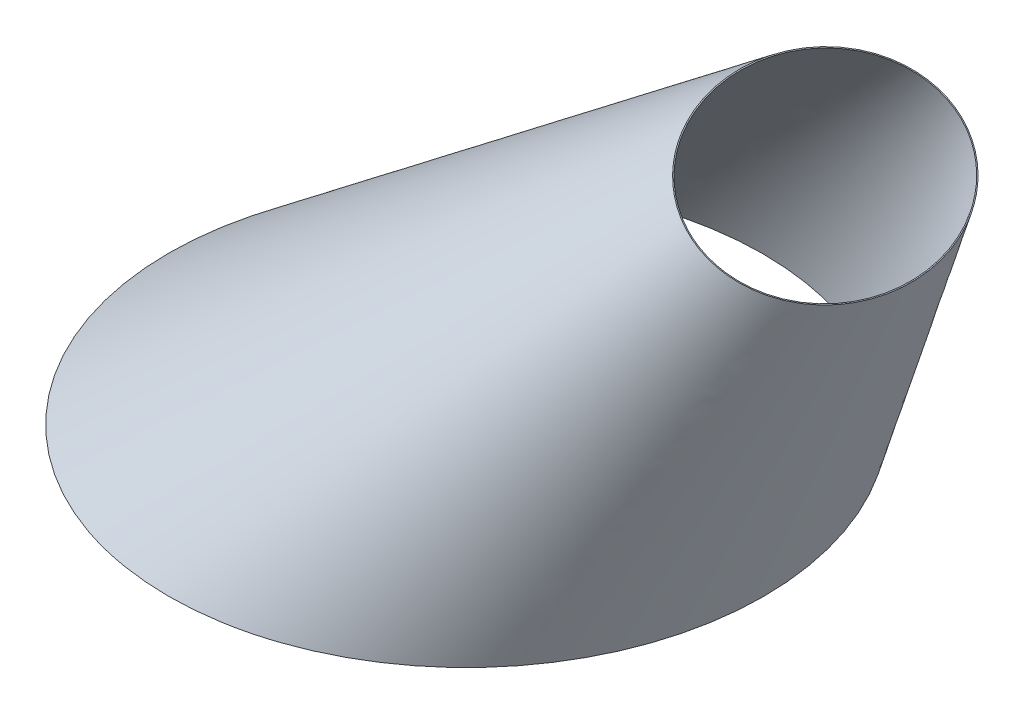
ISO-10303-21;
HEADER;
FILE_DESCRIPTION(('STEP AP214'),'2;1');
FILE_NAME('part.step','',(''),(''),'','','');
FILE_SCHEMA(('AUTOMOTIVE_DESIGN { 1 0 10303 214 1 1 1 1 }'));
ENDSEC;
DATA;
#1=APPLICATION_CONTEXT('core data for automotive mechanical design processes');
#2=APPLICATION_PROTOCOL_DEFINITION('international standard','automotive_design',2000,#1);
#3=PRODUCT_CONTEXT('',#1,'mechanical');
#4=PRODUCT('Part','Part','',(#3));
#5=PRODUCT_RELATED_PRODUCT_CATEGORY('part','',(#4));
#6=PRODUCT_DEFINITION_FORMATION('','',#4);
#7=PRODUCT_DEFINITION_CONTEXT('part definition',#1,'design');
#8=PRODUCT_DEFINITION('design','',#6,#7);
#9=PRODUCT_DEFINITION_SHAPE('','',#8);
#10=(LENGTH_UNIT() NAMED_UNIT(*) SI_UNIT(.MILLI.,.METRE.));
#11=(NAMED_UNIT(*) PLANE_ANGLE_UNIT() SI_UNIT($,.RADIAN.));
#12=(NAMED_UNIT(*) SI_UNIT($,.STERADIAN.) SOLID_ANGLE_UNIT());
#13=UNCERTAINTY_MEASURE_WITH_UNIT(LENGTH_MEASURE(1.E-05),#10,'distance_accuracy_value','');
#14=(GEOMETRIC_REPRESENTATION_CONTEXT(3) GLOBAL_UNCERTAINTY_ASSIGNED_CONTEXT((#13)) GLOBAL_UNIT_ASSIGNED_CONTEXT((#10,
#11,#12)) REPRESENTATION_CONTEXT('',''));
#15=CARTESIAN_POINT('',(0.,0.,0.));
#16=DIRECTION('',(0.,0.,1.));
#17=DIRECTION('',(1.,0.,0.));
#18=AXIS2_PLACEMENT_3D('',#15,#16,#17);
#19=CARTESIAN_POINT('',(275.60333698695,448.422726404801,1984.23926521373));
#20=DIRECTION('',(0.499999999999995,0.866025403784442,0.));
#21=DIRECTION('',(-0.866025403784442,0.499999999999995,0.));
#22=AXIS2_PLACEMENT_3D('',#19,#20,#21);
#23=PLANE('',#22);
#24=CARTESIAN_POINT('',(347.787600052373,406.747122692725,125.679804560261));
#25=CARTESIAN_POINT('',(347.243522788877,407.061245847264,125.545183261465));
#26=CARTESIAN_POINT('',(346.700856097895,407.374554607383,125.403050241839));
#27=CARTESIAN_POINT('',(345.618617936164,407.999385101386,125.10384828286));
#28=CARTESIAN_POINT('',(345.079046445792,408.310906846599,124.946779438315));
#29=CARTESIAN_POINT('',(344.003053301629,408.932131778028,124.617864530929));
#30=CARTESIAN_POINT('',(343.466632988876,409.241834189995,124.446012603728));
#31=CARTESIAN_POINT('',(342.397453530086,409.859125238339,124.087820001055));
#32=CARTESIAN_POINT('',(341.864694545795,410.166713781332,123.90147868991));
#33=CARTESIAN_POINT('',(339.37270599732,411.605464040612,122.992983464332));
#34=CARTESIAN_POINT('',(337.437274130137,412.722886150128,122.179792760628));
#35=CARTESIAN_POINT('',(335.060130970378,414.095330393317,121.04911727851));
#36=CARTESIAN_POINT('',(334.586630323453,414.368706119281,120.81718068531));
#37=CARTESIAN_POINT('',(333.643866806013,414.913010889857,120.342094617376));
#38=CARTESIAN_POINT('',(333.174603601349,415.183940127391,120.098946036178));
#39=CARTESIAN_POINT('',(332.240501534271,415.723244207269,119.601584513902));
#40=CARTESIAN_POINT('',(331.775662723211,415.991619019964,119.347371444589));
#41=CARTESIAN_POINT('',(330.850543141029,416.525737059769,118.828081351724));
#42=CARTESIAN_POINT('',(330.390262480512,416.791480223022,118.563004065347));
#43=CARTESIAN_POINT('',(329.474841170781,417.319998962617,118.022515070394));
#44=CARTESIAN_POINT('',(329.019695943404,417.582777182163,117.747113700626));
#45=CARTESIAN_POINT('',(328.114233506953,418.105546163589,117.185961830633));
#46=CARTESIAN_POINT('',(327.663916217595,418.365536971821,116.900211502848));
#47=CARTESIAN_POINT('',(326.320444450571,419.141190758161,116.027693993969));
#48=CARTESIAN_POINT('',(325.434702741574,419.652573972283,115.425620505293));
#49=CARTESIAN_POINT('',(323.68351861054,420.663620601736,114.18246308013));
#50=CARTESIAN_POINT('',(322.818084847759,421.163279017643,113.541362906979));
#51=CARTESIAN_POINT('',(321.10873480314,422.150172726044,112.221968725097));
#52=CARTESIAN_POINT('',(320.264819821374,422.637407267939,111.5436724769));
#53=CARTESIAN_POINT('',(318.034527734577,423.925067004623,109.680014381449));
#54=CARTESIAN_POINT('',(316.668097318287,424.713975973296,108.462528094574));
#55=CARTESIAN_POINT('',(314.667084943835,425.869261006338,106.567589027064));
#56=CARTESIAN_POINT('',(314.00796087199,426.249806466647,105.924250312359));
#57=CARTESIAN_POINT('',(312.706102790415,427.001434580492,104.615753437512));
#58=CARTESIAN_POINT('',(312.063368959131,427.372517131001,103.950595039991));
#59=CARTESIAN_POINT('',(310.794465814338,428.105118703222,102.599263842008));
#60=CARTESIAN_POINT('',(310.168299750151,428.466635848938,101.913086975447));
#61=CARTESIAN_POINT('',(308.932864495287,429.1799147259,100.520801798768));
#62=CARTESIAN_POINT('',(308.32359526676,429.531676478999,99.814693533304));
#63=CARTESIAN_POINT('',(306.519333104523,430.573367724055,97.6657030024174));
#64=CARTESIAN_POINT('',(305.349728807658,431.248639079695,96.1941227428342));
#65=CARTESIAN_POINT('',(303.647381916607,432.231489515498,93.9352634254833));
#66=CARTESIAN_POINT('',(303.088649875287,432.554073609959,93.1737884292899));
#67=CARTESIAN_POINT('',(301.98838687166,433.189310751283,91.6343977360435));
#68=CARTESIAN_POINT('',(301.446855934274,433.501963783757,90.8564820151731));
#69=CARTESIAN_POINT('',(300.381175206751,434.117234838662,89.2852348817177));
#70=CARTESIAN_POINT('',(299.857021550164,434.41985509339,88.491906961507));
#71=CARTESIAN_POINT('',(298.826011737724,435.015108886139,86.890409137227));
#72=CARTESIAN_POINT('',(298.319155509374,435.307742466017,86.0822392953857));
#73=CARTESIAN_POINT('',(297.354893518,435.864459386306,84.5044484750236));
#74=CARTESIAN_POINT('',(296.896407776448,436.129166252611,83.7357071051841));
#75=CARTESIAN_POINT('',(295.994521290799,436.649870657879,82.1865398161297));
#76=CARTESIAN_POINT('',(295.551120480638,436.905868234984,81.4061139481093));
#77=CARTESIAN_POINT('',(294.243700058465,437.66070776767,79.0484212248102));
#78=CARTESIAN_POINT('',(293.402240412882,438.146524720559,77.4543753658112));
#79=CARTESIAN_POINT('',(291.780064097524,439.083088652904,74.2274734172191));
#80=CARTESIAN_POINT('',(290.999296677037,439.533864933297,72.5946512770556));
#81=CARTESIAN_POINT('',(289.497199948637,440.401100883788,69.2927752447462));
#82=CARTESIAN_POINT('',(288.775880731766,440.81755472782,67.6237152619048));
#83=CARTESIAN_POINT('',(286.686375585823,442.023931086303,62.5331442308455));
#84=CARTESIAN_POINT('',(285.409048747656,442.761396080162,59.061029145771));
#85=CARTESIAN_POINT('',(283.671617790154,443.764502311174,53.7753896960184));
#86=CARTESIAN_POINT('',(283.122088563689,444.081773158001,52.0000252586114));
#87=CARTESIAN_POINT('',(282.082060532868,444.68223362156,48.4263808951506));
#88=CARTESIAN_POINT('',(281.591561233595,444.965423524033,46.6281011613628));
#89=CARTESIAN_POINT('',(280.207034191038,445.764780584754,41.1995852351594));
#90=CARTESIAN_POINT('',(279.400984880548,446.230153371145,37.5387521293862));
#91=CARTESIAN_POINT('',(278.366148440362,446.827616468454,32.0059729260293));
#92=CARTESIAN_POINT('',(278.050263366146,447.009992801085,30.1549619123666));
#93=CARTESIAN_POINT('',(277.476079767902,447.341497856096,26.4410239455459));
#94=CARTESIAN_POINT('',(277.217782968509,447.490625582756,24.5780966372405));
#95=CARTESIAN_POINT('',(276.482317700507,447.915246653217,18.5960315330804));
#96=CARTESIAN_POINT('',(276.115494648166,448.127032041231,14.4578252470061));
#97=CARTESIAN_POINT('',(275.772806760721,448.324882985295,8.23904827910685));
#98=CARTESIAN_POINT('',(275.69315755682,448.370868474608,6.16516919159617));
#99=CARTESIAN_POINT('',(275.602693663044,448.423097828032,2.01540884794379));
#100=CARTESIAN_POINT('',(275.591878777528,448.429341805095,-0.0604724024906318));
#101=CARTESIAN_POINT('',(275.662750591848,448.38842394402,-6.28810030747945));
#102=CARTESIAN_POINT('',(275.847791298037,448.281590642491,-10.4391481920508));
#103=CARTESIAN_POINT('',(276.332681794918,448.001638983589,-16.6436014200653));
#104=CARTESIAN_POINT('',(276.52895062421,447.888323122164,-18.7086394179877));
#105=CARTESIAN_POINT('',(276.990905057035,447.621613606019,-22.8283721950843));
#106=CARTESIAN_POINT('',(277.256592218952,447.468219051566,-24.8830667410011));
#107=CARTESIAN_POINT('',(278.158586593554,446.947452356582,-31.0283742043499));
#108=CARTESIAN_POINT('',(278.89976940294,446.519530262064,-35.0994721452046));
#109=CARTESIAN_POINT('',(280.223163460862,445.755468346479,-41.1419929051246));
#110=CARTESIAN_POINT('',(280.69948795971,445.480462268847,-43.145218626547));
#111=CARTESIAN_POINT('',(281.72329845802,444.889365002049,-47.1272725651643));
#112=CARTESIAN_POINT('',(282.270784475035,444.573273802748,-49.1061007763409));
#113=CARTESIAN_POINT('',(283.943682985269,443.607425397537,-54.7398129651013));
#114=CARTESIAN_POINT('',(285.158585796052,442.906000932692,-58.3602192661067));
#115=CARTESIAN_POINT('',(287.17203485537,441.743535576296,-63.6959926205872));
#116=CARTESIAN_POINT('',(287.875613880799,441.337324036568,-65.4600235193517));
#117=CARTESIAN_POINT('',(289.347221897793,440.487690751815,-68.9525141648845));
#118=CARTESIAN_POINT('',(290.115263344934,440.044261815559,-70.6809669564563));
#119=CARTESIAN_POINT('',(291.638722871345,439.164692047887,-73.9325005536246));
#120=CARTESIAN_POINT('',(292.388200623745,438.731980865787,-75.4592980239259));
#121=CARTESIAN_POINT('',(293.94036310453,437.835839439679,-78.4765689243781));
#122=CARTESIAN_POINT('',(294.743051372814,437.37240715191,-79.9670399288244));
#123=CARTESIAN_POINT('',(296.402039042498,436.414590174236,-82.9085346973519));
#124=CARTESIAN_POINT('',(297.258357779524,435.920194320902,-84.3595439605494));
#125=CARTESIAN_POINT('',(298.582890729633,435.155474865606,-86.5028983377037));
#126=CARTESIAN_POINT('',(299.031085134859,434.8967097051,-87.211834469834));
#127=CARTESIAN_POINT('',(299.940865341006,434.371447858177,-88.6181775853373));
#128=CARTESIAN_POINT('',(300.402451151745,434.104951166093,-89.3155845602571));
#129=CARTESIAN_POINT('',(301.33894600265,433.564265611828,-90.6983093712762));
#130=CARTESIAN_POINT('',(301.813854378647,433.290077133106,-91.3836278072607));
#131=CARTESIAN_POINT('',(302.776992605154,432.734009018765,-92.7416721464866));
#132=CARTESIAN_POINT('',(303.265222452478,432.452129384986,-93.4143980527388));
#133=CARTESIAN_POINT('',(304.25503508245,431.880660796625,-94.7466851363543));
#134=CARTESIAN_POINT('',(304.756618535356,431.591071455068,-95.4062456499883));
#135=CARTESIAN_POINT('',(305.773067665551,431.004224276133,-96.7115747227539));
#136=CARTESIAN_POINT('',(306.287933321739,430.706966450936,-97.3573433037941));
#137=CARTESIAN_POINT('',(307.330652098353,430.104952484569,-98.6342956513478));
#138=CARTESIAN_POINT('',(307.858500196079,429.800199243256,-99.2654848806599));
#139=CARTESIAN_POINT('',(308.927289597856,429.183133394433,-100.512877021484));
#140=CARTESIAN_POINT('',(309.468231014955,428.870820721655,-101.129079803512));
#141=CARTESIAN_POINT('',(311.110494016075,427.922659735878,-102.954034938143));
#142=CARTESIAN_POINT('',(312.23149725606,427.27544821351,-104.139432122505));
#143=CARTESIAN_POINT('',(313.933252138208,426.292939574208,-105.848809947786));
#144=CARTESIAN_POINT('',(314.49462619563,425.968830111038,-106.398759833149));
#145=CARTESIAN_POINT('',(315.629215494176,425.313774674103,-107.482096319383));
#146=CARTESIAN_POINT('',(316.202430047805,424.982829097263,-108.015483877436));
#147=CARTESIAN_POINT('',(317.360493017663,424.314221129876,-109.065036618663));
#148=CARTESIAN_POINT('',(317.945340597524,423.976559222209,-109.581203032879));
#149=CARTESIAN_POINT('',(319.126473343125,423.294631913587,-110.5958130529));
#150=CARTESIAN_POINT('',(319.722758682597,422.950366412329,-111.094256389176));
#151=CARTESIAN_POINT('',(320.926644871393,422.255302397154,-112.072732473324));
#152=CARTESIAN_POINT('',(321.534246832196,421.904503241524,-112.552763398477));
#153=CARTESIAN_POINT('',(322.760460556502,421.196548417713,-113.493693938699));
#154=CARTESIAN_POINT('',(323.379072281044,420.839392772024,-113.954593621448));
#155=CARTESIAN_POINT('',(324.625529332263,420.119750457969,-114.855672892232));
#156=CARTESIAN_POINT('',(325.253350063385,419.757277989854,-115.295897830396));
#157=CARTESIAN_POINT('',(326.519361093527,419.026346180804,-116.156003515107));
#158=CARTESIAN_POINT('',(327.157551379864,418.657886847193,-116.575884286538));
#159=CARTESIAN_POINT('',(328.443892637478,417.91521737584,-117.394644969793));
#160=CARTESIAN_POINT('',(329.092042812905,417.541007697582,-117.793526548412));
#161=CARTESIAN_POINT('',(330.397948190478,416.787042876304,-118.569766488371));
#162=CARTESIAN_POINT('',(331.055703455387,416.407287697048,-118.947124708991));
#163=CARTESIAN_POINT('',(332.380158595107,415.642613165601,-119.679384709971));
#164=CARTESIAN_POINT('',(333.046854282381,415.257696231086,-120.034296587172));
#165=CARTESIAN_POINT('',(334.388972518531,414.48282390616,-120.721358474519));
#166=CARTESIAN_POINT('',(335.064394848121,414.092868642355,-121.053509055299));
#167=CARTESIAN_POINT('',(336.248663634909,413.40913073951,-121.611940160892));
#168=CARTESIAN_POINT('',(336.75565640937,413.116418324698,-121.843472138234));
#169=CARTESIAN_POINT('',(337.773987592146,412.528484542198,-122.293352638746));
#170=CARTESIAN_POINT('',(338.285325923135,412.233263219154,-122.511701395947));
#171=CARTESIAN_POINT('',(339.825386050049,411.344109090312,-123.146678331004));
#172=CARTESIAN_POINT('',(340.860373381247,410.746558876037,-123.543341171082));
#173=CARTESIAN_POINT('',(342.423581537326,409.844040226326,-124.09672054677));
#174=CARTESIAN_POINT('',(342.946363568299,409.542211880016,-124.274222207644));
#175=CARTESIAN_POINT('',(343.995313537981,408.936600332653,-124.615293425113));
#176=CARTESIAN_POINT('',(344.521481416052,408.63281716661,-124.778863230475));
#177=CARTESIAN_POINT('',(346.104764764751,407.718708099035,-125.248274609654));
#178=CARTESIAN_POINT('',(347.166706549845,407.105595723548,-125.532834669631));
#179=CARTESIAN_POINT('',(348.697691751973,406.221681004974,-125.899572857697));
#180=CARTESIAN_POINT('',(349.162622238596,405.953253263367,-126.005238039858));
#181=CARTESIAN_POINT('',(350.094277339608,405.415361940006,-126.205484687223));
#182=CARTESIAN_POINT('',(350.561001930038,405.145898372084,-126.300066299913));
#183=CARTESIAN_POINT('',(351.496034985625,404.60605678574,-126.478082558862));
#184=CARTESIAN_POINT('',(351.964343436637,404.335678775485,-126.561517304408));
#185=CARTESIAN_POINT('',(352.902354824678,403.794117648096,-126.717202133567));
#186=CARTESIAN_POINT('',(353.372057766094,403.52293452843,-126.789452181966));
#187=CARTESIAN_POINT('',(354.312600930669,402.979911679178,-126.922632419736));
#188=CARTESIAN_POINT('',(354.783440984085,402.708072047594,-126.983564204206));
#189=CARTESIAN_POINT('',(355.726111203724,402.163821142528,-127.09407058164));
#190=CARTESIAN_POINT('',(356.197941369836,401.891409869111,-127.143645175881));
#191=CARTESIAN_POINT('',(357.614632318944,401.073482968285,-127.275338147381));
#192=CARTESIAN_POINT('',(358.560726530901,400.527255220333,-127.340430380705));
#193=CARTESIAN_POINT('',(360.448714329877,399.437224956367,-127.424437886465));
#194=CARTESIAN_POINT('',(361.390598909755,398.89342764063,-127.443628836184));
#195=CARTESIAN_POINT('',(363.274247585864,397.805902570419,-127.436809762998));
#196=CARTESIAN_POINT('',(364.216011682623,397.262174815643,-127.410799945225));
#197=CARTESIAN_POINT('',(366.098198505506,396.175493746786,-127.313405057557));
#198=CARTESIAN_POINT('',(367.038620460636,395.63254087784,-127.242000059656));
#199=CARTESIAN_POINT('',(368.916224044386,394.54850594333,-127.054317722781));
#200=CARTESIAN_POINT('',(369.85340509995,394.007424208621,-126.938032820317));
#201=CARTESIAN_POINT('',(372.049032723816,392.739778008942,-126.612350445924));
#202=CARTESIAN_POINT('',(373.305491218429,392.014361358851,-126.384621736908));
#203=CARTESIAN_POINT('',(375.180673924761,390.931724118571,-125.983462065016));
#204=CARTESIAN_POINT('',(375.804303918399,390.571671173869,-125.839771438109));
#205=CARTESIAN_POINT('',(377.047928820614,389.853664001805,-125.532657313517));
#206=CARTESIAN_POINT('',(377.667923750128,389.495709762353,-125.369233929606));
#207=CARTESIAN_POINT('',(378.903865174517,388.78213864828,-125.022908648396));
#208=CARTESIAN_POINT('',(379.519811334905,388.426521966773,-124.840005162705));
#209=CARTESIAN_POINT('',(380.747212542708,387.717881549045,-124.455096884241));
#210=CARTESIAN_POINT('',(381.358667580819,387.364857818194,-124.253092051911));
#211=CARTESIAN_POINT('',(382.57750499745,386.661161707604,-123.829968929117));
#212=CARTESIAN_POINT('',(383.184880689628,386.310493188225,-123.608824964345));
#213=CARTESIAN_POINT('',(384.394315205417,385.612225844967,-123.14793601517));
#214=CARTESIAN_POINT('',(384.996374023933,385.264627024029,-122.908191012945));
#215=CARTESIAN_POINT('',(386.19475361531,384.572742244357,-122.410481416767));
#216=CARTESIAN_POINT('',(386.791074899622,384.228455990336,-122.152518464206));
#217=CARTESIAN_POINT('',(387.977703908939,383.543355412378,-121.618789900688));
#218=CARTESIAN_POINT('',(388.568011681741,383.202541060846,-121.343024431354));
#219=CARTESIAN_POINT('',(389.742270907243,382.524582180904,-120.774054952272));
#220=CARTESIAN_POINT('',(390.326222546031,382.187437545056,-120.480851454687));
#221=CARTESIAN_POINT('',(391.487471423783,381.51699019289,-119.877339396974));
#222=CARTESIAN_POINT('',(392.064768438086,381.18368760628,-119.567030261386));
#223=CARTESIAN_POINT('',(393.539606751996,380.332189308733,-118.747996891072));
#224=CARTESIAN_POINT('',(394.432068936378,379.816926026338,-118.227020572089));
#225=CARTESIAN_POINT('',(396.198917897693,378.796835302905,-117.145616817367));
#226=CARTESIAN_POINT('',(397.073303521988,378.292008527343,-116.585186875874));
#227=CARTESIAN_POINT('',(398.803035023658,377.293347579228,-115.426413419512));
#228=CARTESIAN_POINT('',(399.658380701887,376.799513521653,-114.828069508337));
#229=CARTESIAN_POINT('',(401.349180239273,375.823329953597,-113.595071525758));
#230=CARTESIAN_POINT('',(402.184634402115,375.340980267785,-112.9604180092));
#231=CARTESIAN_POINT('',(403.835013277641,374.388133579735,-111.656565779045));
#232=CARTESIAN_POINT('',(404.649938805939,373.917636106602,-110.987368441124));
#233=CARTESIAN_POINT('',(406.258705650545,372.988814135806,-109.616013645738));
#234=CARTESIAN_POINT('',(407.052546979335,372.530489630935,-108.913856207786));
#235=CARTESIAN_POINT('',(408.618632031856,371.626310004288,-107.478097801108));
#236=CARTESIAN_POINT('',(409.390875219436,371.180455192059,-106.744496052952));
#237=CARTESIAN_POINT('',(410.913355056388,370.301451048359,-105.247451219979));
#238=CARTESIAN_POINT('',(411.663591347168,369.868301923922,-104.484007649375));
#239=CARTESIAN_POINT('',(413.254965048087,368.949521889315,-102.809780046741));
#240=CARTESIAN_POINT('',(414.092428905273,368.466011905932,-101.894336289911));
#241=CARTESIAN_POINT('',(415.737272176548,367.516361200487,-100.02808438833));
#242=CARTESIAN_POINT('',(416.544650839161,367.050220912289,-99.0772753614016));
#243=CARTESIAN_POINT('',(418.129047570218,366.13546903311,-97.1424261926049));
#244=CARTESIAN_POINT('',(418.906063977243,365.686858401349,-96.1583842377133));
#245=CARTESIAN_POINT('',(420.429523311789,364.80728874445,-94.1592462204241));
#246=CARTESIAN_POINT('',(421.175966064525,364.376329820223,-93.1441499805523));
#247=CARTESIAN_POINT('',(422.638518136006,363.53192498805,-91.0844011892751));
#248=CARTESIAN_POINT('',(423.354612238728,363.118487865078,-90.0397342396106));
#249=CARTESIAN_POINT('',(424.755978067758,362.309408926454,-87.923276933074));
#250=CARTESIAN_POINT('',(425.441251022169,361.913766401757,-86.8514876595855));
#251=CARTESIAN_POINT('',(426.780992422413,361.140266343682,-84.6825732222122));
#252=CARTESIAN_POINT('',(427.435461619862,360.762408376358,-83.5854486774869));
#253=CARTESIAN_POINT('',(428.713726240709,360.024401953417,-81.3674656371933));
#254=CARTESIAN_POINT('',(429.337516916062,359.664256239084,-80.246603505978));
#255=CARTESIAN_POINT('',(431.421087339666,358.46130629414,-76.3707150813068));
#256=CARTESIAN_POINT('',(432.806314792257,357.661544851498,-73.5616503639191));
#257=CARTESIAN_POINT('',(435.398212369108,356.165112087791,-67.8356777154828));
#258=CARTESIAN_POINT('',(436.60485353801,355.46845748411,-64.9187523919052));
#259=CARTESIAN_POINT('',(438.282655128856,354.499778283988,-60.4764631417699));
#260=CARTESIAN_POINT('',(438.820057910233,354.189508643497,-58.9840243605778));
#261=CARTESIAN_POINT('',(439.850882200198,353.594361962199,-55.9794574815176));
#262=CARTESIAN_POINT('',(440.344313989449,353.309478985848,-54.4673340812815));
#263=CARTESIAN_POINT('',(441.759420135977,352.492467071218,-49.9035064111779));
#264=CARTESIAN_POINT('',(442.61588287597,351.997988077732,-46.8244041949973));
#265=CARTESIAN_POINT('',(443.85325010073,351.283593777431,-41.8335274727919));
#266=CARTESIAN_POINT('',(444.288637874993,351.032222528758,-39.9393887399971));
#267=CARTESIAN_POINT('',(445.096641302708,350.56572153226,-36.1333562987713));
#268=CARTESIAN_POINT('',(445.46925614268,350.350592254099,-34.2214623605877));
#269=CARTESIAN_POINT('',(446.493555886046,349.759212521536,-28.4631250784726));
#270=CARTESIAN_POINT('',(447.051758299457,349.43693420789,-24.5937738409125));
#271=CARTESIAN_POINT('',(447.703736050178,349.060514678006,-18.7617383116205));
#272=CARTESIAN_POINT('',(447.890221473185,348.952847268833,-16.8120695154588));
#273=CARTESIAN_POINT('',(448.201512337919,348.773123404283,-12.906175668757));
#274=CARTESIAN_POINT('',(448.326317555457,348.701067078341,-10.9499505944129));
#275=CARTESIAN_POINT('',(448.608407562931,348.53820233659,-5.07512931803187));
#276=CARTESIAN_POINT('',(448.673427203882,348.500663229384,-1.14984380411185));
#277=CARTESIAN_POINT('',(448.593486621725,348.546816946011,4.26176241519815));
#278=CARTESIAN_POINT('',(448.55372878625,348.569771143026,5.75120342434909));
#279=CARTESIAN_POINT('',(448.438735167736,348.63616273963,8.72831337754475));
#280=CARTESIAN_POINT('',(448.363500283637,348.679599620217,10.2159823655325));
#281=CARTESIAN_POINT('',(448.177417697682,348.78703445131,13.1885113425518));
#282=CARTESIAN_POINT('',(448.066565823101,348.851034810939,14.6733709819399));
#283=CARTESIAN_POINT('',(447.809251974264,348.999595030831,17.6389429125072));
#284=CARTESIAN_POINT('',(447.662789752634,349.084155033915,19.1196551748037));
#285=CARTESIAN_POINT('',(447.169744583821,349.368814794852,23.554167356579));
#286=CARTESIAN_POINT('',(446.76950727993,349.599891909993,26.5002761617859));
#287=CARTESIAN_POINT('',(445.825204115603,350.145085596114,32.3606303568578));
#288=CARTESIAN_POINT('',(445.281178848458,350.459178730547,35.2748844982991));
#289=CARTESIAN_POINT('',(444.047936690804,351.171191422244,41.0619061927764));
#290=CARTESIAN_POINT('',(443.358734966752,351.569102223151,43.9346780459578));
#291=CARTESIAN_POINT('',(441.833613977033,352.449631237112,49.6274120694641));
#292=CARTESIAN_POINT('',(440.997726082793,352.932231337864,52.4473853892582));
#293=CARTESIAN_POINT('',(439.544044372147,353.771514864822,56.8997348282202));
#294=CARTESIAN_POINT('',(438.973978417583,354.100642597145,58.5530473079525));
#295=CARTESIAN_POINT('',(437.780493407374,354.789701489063,61.8337926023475));
#296=CARTESIAN_POINT('',(437.15707190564,355.149634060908,63.4612242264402));
#297=CARTESIAN_POINT('',(435.20610999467,356.276022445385,68.3001935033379));
#298=CARTESIAN_POINT('',(433.797607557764,357.089221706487,71.4692202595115));
#299=CARTESIAN_POINT('',(431.522775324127,358.402596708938,76.1135644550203));
#300=CARTESIAN_POINT('',(430.737841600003,358.855778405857,77.6428721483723));
#301=CARTESIAN_POINT('',(429.113300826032,359.793707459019,80.6624903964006));
#302=CARTESIAN_POINT('',(428.273692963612,360.278455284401,82.1528003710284));
#303=CARTESIAN_POINT('',(426.539831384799,361.279500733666,85.0900735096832));
#304=CARTESIAN_POINT('',(425.645586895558,361.79579303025,86.5370439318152));
#305=CARTESIAN_POINT('',(423.802357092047,362.859982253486,89.3835615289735));
#306=CARTESIAN_POINT('',(422.853374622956,363.407877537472,90.7831111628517));
#307=CARTESIAN_POINT('',(420.325814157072,364.867165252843,94.3393252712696));
#308=CARTESIAN_POINT('',(418.705442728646,365.802687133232,96.4567325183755));
#309=CARTESIAN_POINT('',(415.327908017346,367.752707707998,100.541141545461));
#310=CARTESIAN_POINT('',(413.570754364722,368.767200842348,102.508153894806));
#311=CARTESIAN_POINT('',(410.836554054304,370.345792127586,105.328722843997));
#312=CARTESIAN_POINT('',(409.909091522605,370.881262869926,106.246949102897));
#313=CARTESIAN_POINT('',(408.021522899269,371.971051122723,108.037698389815));
#314=CARTESIAN_POINT('',(407.061416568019,372.525368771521,108.910221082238));
#315=CARTESIAN_POINT('',(405.10962372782,373.652236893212,110.606563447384));
#316=CARTESIAN_POINT('',(404.117940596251,374.224785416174,111.430388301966));
#317=CARTESIAN_POINT('',(402.103969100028,375.387552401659,113.026545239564));
#318=CARTESIAN_POINT('',(401.081681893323,375.977770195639,113.798879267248));
#319=CARTESIAN_POINT('',(399.168239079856,377.082496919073,115.173522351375));
#320=CARTESIAN_POINT('',(398.281285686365,377.594579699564,115.783642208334));
#321=CARTESIAN_POINT('',(396.487298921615,378.630338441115,116.96315009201));
#322=CARTESIAN_POINT('',(395.58026602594,379.154014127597,117.532539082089));
#323=CARTESIAN_POINT('',(393.747189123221,380.212341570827,118.628805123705));
#324=CARTESIAN_POINT('',(392.82114625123,380.746992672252,119.1556847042));
#325=CARTESIAN_POINT('',(390.951076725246,381.826677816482,120.165053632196));
#326=CARTESIAN_POINT('',(390.00705004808,382.371711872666,120.647542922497));
#327=CARTESIAN_POINT('',(388.102202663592,383.471476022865,121.566740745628));
#328=CARTESIAN_POINT('',(387.141378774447,384.026207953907,122.00344049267));
#329=CARTESIAN_POINT('',(385.204488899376,385.14447184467,122.82926576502));
#330=CARTESIAN_POINT('',(384.228422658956,385.708003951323,123.218390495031));
#331=CARTESIAN_POINT('',(382.262585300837,386.842980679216,123.94750368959));
#332=CARTESIAN_POINT('',(381.272813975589,387.414425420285,124.287491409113));
#333=CARTESIAN_POINT('',(379.28145158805,388.564139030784,124.917155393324));
#334=CARTESIAN_POINT('',(378.27986136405,389.142407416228,125.206835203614));
#335=CARTESIAN_POINT('',(375.923850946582,390.502650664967,125.824237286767));
#336=CARTESIAN_POINT('',(374.56531403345,391.287002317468,126.131377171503));
#337=CARTESIAN_POINT('',(372.517551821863,392.469278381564,126.520955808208));
#338=CARTESIAN_POINT('',(371.833242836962,392.864364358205,126.638967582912));
#339=CARTESIAN_POINT('',(370.461799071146,393.656167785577,126.850940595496));
#340=CARTESIAN_POINT('',(369.774664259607,394.052885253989,126.944901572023));
#341=CARTESIAN_POINT('',(368.398143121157,394.847620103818,127.108669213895));
#342=CARTESIAN_POINT('',(367.708756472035,395.245637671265,127.178472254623));
#343=CARTESIAN_POINT('',(366.328460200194,396.042552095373,127.293811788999));
#344=CARTESIAN_POINT('',(365.637550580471,396.441448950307,127.339348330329));
#345=CARTESIAN_POINT('',(364.256293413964,397.238918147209,127.40585861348));
#346=CARTESIAN_POINT('',(363.56594771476,397.637489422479,127.426883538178));
#347=CARTESIAN_POINT('',(362.185025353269,398.434765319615,127.444628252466));
#348=CARTESIAN_POINT('',(361.494448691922,398.83346994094,127.441348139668));
#349=CARTESIAN_POINT('',(360.113820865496,399.630575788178,127.410447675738));
#350=CARTESIAN_POINT('',(359.423769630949,400.028977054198,127.382831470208));
#351=CARTESIAN_POINT('',(358.044708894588,400.825178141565,127.303259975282));
#352=CARTESIAN_POINT('',(357.355699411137,401.22297795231,127.251304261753));
#353=CARTESIAN_POINT('',(355.979844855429,402.017327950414,127.123335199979));
#354=CARTESIAN_POINT('',(355.292998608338,402.413878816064,127.047338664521));
#355=CARTESIAN_POINT('',(353.921660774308,403.205621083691,126.871278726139));
#356=CARTESIAN_POINT('',(353.237169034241,403.600812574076,126.771216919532));
#357=CARTESIAN_POINT('',(352.154473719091,404.225907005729,126.59378516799));
#358=CARTESIAN_POINT('',(351.755298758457,404.456370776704,126.524220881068));
#359=CARTESIAN_POINT('',(350.95812987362,404.916616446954,126.377013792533));
#360=CARTESIAN_POINT('',(350.560135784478,405.146398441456,126.299372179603));
#361=CARTESIAN_POINT('',(349.368416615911,405.834437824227,126.054418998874));
#362=CARTESIAN_POINT('',(348.576525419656,406.291636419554,125.875008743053));
#363=CARTESIAN_POINT('',(347.787600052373,406.747122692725,125.679804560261));
#364=B_SPLINE_CURVE_WITH_KNOTS('',3,(#24,#25,#26,#27,#28,#29,#30,#31,#32,#33,#34,#35,#36,#37,
#38,#39,#40,#41,#42,#43,#44,#45,#46,#47,#48,#49,#50,#51,#52,#53,#54,#55,#56,#57,#58,#59,#60,#61,
#62,#63,#64,#65,#66,#67,#68,#69,#70,#71,#72,#73,#74,#75,#76,#77,#78,#79,#80,#81,#82,#83,#84,#85,
#86,#87,#88,#89,#90,#91,#92,#93,#94,#95,#96,#97,#98,#99,#100,#101,#102,#103,#104,#105,#106,#107,
#108,#109,#110,#111,#112,#113,#114,#115,#116,#117,#118,#119,#120,#121,#122,#123,#124,#125,#126,
#127,#128,#129,#130,#131,#132,#133,#134,#135,#136,#137,#138,#139,#140,#141,#142,#143,#144,#145,
#146,#147,#148,#149,#150,#151,#152,#153,#154,#155,#156,#157,#158,#159,#160,#161,#162,#163,#164,
#165,#166,#167,#168,#169,#170,#171,#172,#173,#174,#175,#176,#177,#178,#179,#180,#181,#182,#183,
#184,#185,#186,#187,#188,#189,#190,#191,#192,#193,#194,#195,#196,#197,#198,#199,#200,#201,#202,
#203,#204,#205,#206,#207,#208,#209,#210,#211,#212,#213,#214,#215,#216,#217,#218,#219,#220,#221,
#222,#223,#224,#225,#226,#227,#228,#229,#230,#231,#232,#233,#234,#235,#236,#237,#238,#239,#240,
#241,#242,#243,#244,#245,#246,#247,#248,#249,#250,#251,#252,#253,#254,#255,#256,#257,#258,#259,
#260,#261,#262,#263,#264,#265,#266,#267,#268,#269,#270,#271,#272,#273,#274,#275,#276,#277,#278,
#279,#280,#281,#282,#283,#284,#285,#286,#287,#288,#289,#290,#291,#292,#293,#294,#295,#296,#297,
#298,#299,#300,#301,#302,#303,#304,#305,#306,#307,#308,#309,#310,#311,#312,#313,#314,#315,#316,
#317,#318,#319,#320,#321,#322,#323,#324,#325,#326,#327,#328,#329,#330,#331,#332,#333,#334,#335,
#336,#337,#338,#339,#340,#341,#342,#343,#344,#345,#346,#347,#348,#349,#350,#351,#352,#353,#354,
#355,#356,#357,#358,#359,#360,#361,#362,#363),.UNSPECIFIED.,.T.,.F.,(4,2,2,2,2,2,2,2,2,2,2,2,2,
2,2,2,2,2,2,2,2,2,2,2,2,2,2,2,2,2,2,2,2,2,2,2,2,2,2,2,2,2,2,2,2,2,2,2,2,2,2,2,2,2,2,2,2,2,2,2,2,
2,2,2,2,2,2,2,2,2,2,2,2,2,2,2,2,2,2,2,2,2,2,2,2,2,2,2,2,2,2,2,2,2,2,2,2,2,2,2,2,2,2,2,2,2,2,2,2,
2,2,2,2,2,2,2,2,2,2,2,2,2,2,2,2,2,2,2,2,2,2,2,2,2,2,2,2,2,2,2,2,2,2,2,2,2,2,2,2,2,2,2,2,2,2,2,2,
2,2,2,2,2,2,2,2,2,2,2,2,4),(0.,1.92744324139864,3.85487424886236,5.7830734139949,
7.71135722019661,14.8346227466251,16.6163457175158,18.3979269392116,20.1795288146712,
21.9611738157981,23.7410799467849,25.5209564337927,29.0804475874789,32.6414298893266,
36.2026268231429,42.1771420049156,45.1665241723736,48.1559388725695,51.1459355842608,
54.135925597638,60.1245898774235,63.1184687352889,66.1123519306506,69.1055644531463,
72.0987644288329,74.8987290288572,77.6986813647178,83.2972518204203,88.8910892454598,
94.4858742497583,105.788714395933,111.443710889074,117.098659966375,128.418410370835,
134.077255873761,139.736270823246,152.200811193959,158.427348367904,164.653867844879,
177.10895451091,183.339977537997,189.571140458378,202.03568575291,208.266313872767,
214.496943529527,226.130077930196,231.955106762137,237.781263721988,243.044926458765,
248.308939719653,253.574861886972,256.207908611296,258.840957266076,261.473874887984,
264.106791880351,266.739841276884,269.372886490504,272.004928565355,274.636993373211,
279.899896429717,282.449930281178,284.999816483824,287.549520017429,290.099262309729,
292.649256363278,295.199241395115,297.743343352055,300.287442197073,302.831338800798,
305.37525203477,307.918012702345,310.460709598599,312.349192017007,314.237640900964,
318.01371459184,319.901213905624,321.788679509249,325.563442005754,327.204828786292,
328.84619372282,330.487544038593,332.128899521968,333.770023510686,335.411147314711,
338.693279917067,341.955650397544,345.218006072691,348.481794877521,351.746133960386,
356.149336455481,358.352028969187,360.554708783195,362.757568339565,364.960432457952,
367.166298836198,369.372167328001,371.577837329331,373.783489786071,375.989077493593,
378.19473944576,381.657984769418,385.121450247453,388.584951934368,392.048400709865,
395.511711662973,398.975020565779,402.438415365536,405.901866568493,409.895703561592,
413.889640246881,417.883795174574,421.877972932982,425.874130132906,429.870127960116,
433.866028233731,437.862545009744,447.550496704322,457.240017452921,462.088118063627,
466.935082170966,476.629204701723,482.507115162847,488.385101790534,500.140289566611,
506.023811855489,511.907355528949,523.672803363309,528.142907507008,532.612898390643,
537.083413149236,541.553958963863,550.49525035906,559.434020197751,568.371856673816,
577.30778396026,582.645200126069,587.982861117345,598.655579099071,603.987545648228,
609.319591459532,614.650739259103,619.981610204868,628.45035815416,636.918510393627,
641.149561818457,645.380644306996,649.611275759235,653.841747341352,657.417244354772,
660.992656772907,664.567856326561,668.143060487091,671.718949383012,675.294898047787,
678.870900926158,682.446651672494,687.238828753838,689.635349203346,692.031895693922,
694.428801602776,696.825702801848,699.217589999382,701.609467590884,704.000937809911,
706.392449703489,708.782292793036,711.171977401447,712.570353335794,713.968523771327,
716.763363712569),.UNSPECIFIED.);
#365=CARTESIAN_POINT('',(347.787600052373,406.747122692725,125.679804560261));
#366=VERTEX_POINT('',#365);
#367=EDGE_CURVE('E44',#366,#366,#364,.T.);
#368=ORIENTED_EDGE('',*,*,#367,.F.);
#369=EDGE_LOOP('',(#368));
#370=FACE_BOUND('',#369,.T.);
#371=CARTESIAN_POINT('',(348.421252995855,406.381282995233,-124.747133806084));
#372=CARTESIAN_POINT('',(349.046224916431,406.020455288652,-124.897196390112));
#373=CARTESIAN_POINT('',(349.673003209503,405.658584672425,-125.037210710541));
#374=CARTESIAN_POINT('',(350.929699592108,404.933030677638,-125.29678221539));
#375=CARTESIAN_POINT('',(351.559617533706,404.56934738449,-125.41634035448));
#376=CARTESIAN_POINT('',(352.822253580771,403.840364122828,-125.63496045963));
#377=CARTESIAN_POINT('',(353.454972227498,403.475063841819,-125.734018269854));
#378=CARTESIAN_POINT('',(354.722581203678,402.743209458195,-125.911308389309));
#379=CARTESIAN_POINT('',(355.357471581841,402.376655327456,-125.989540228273));
#380=CARTESIAN_POINT('',(357.264700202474,401.275516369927,-126.192920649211));
#381=CARTESIAN_POINT('',(358.539701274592,400.539394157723,-126.286772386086));
#382=CARTESIAN_POINT('',(360.454173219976,399.434073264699,-126.364170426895));
#383=CARTESIAN_POINT('',(361.092837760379,399.065340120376,-126.379401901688));
#384=CARTESIAN_POINT('',(362.370312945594,398.327789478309,-126.388809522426));
#385=CARTESIAN_POINT('',(363.009123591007,397.958971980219,-126.382985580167));
#386=CARTESIAN_POINT('',(364.286319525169,397.221582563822,-126.350211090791));
#387=CARTESIAN_POINT('',(364.924704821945,396.853010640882,-126.323260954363));
#388=CARTESIAN_POINT('',(366.200537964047,396.116408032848,-126.248249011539));
#389=CARTESIAN_POINT('',(366.837985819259,395.748377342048,-126.200187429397));
#390=CARTESIAN_POINT('',(368.111417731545,395.013161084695,-126.083159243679));
#391=CARTESIAN_POINT('',(368.747401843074,394.645975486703,-126.014193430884));
#392=CARTESIAN_POINT('',(370.017416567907,393.912732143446,-125.855388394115));
#393=CARTESIAN_POINT('',(370.651447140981,393.546674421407,-125.765548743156));
#394=CARTESIAN_POINT('',(372.231871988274,392.634215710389,-125.515265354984));
#395=CARTESIAN_POINT('',(373.176756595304,392.088686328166,-125.341931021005));
#396=CARTESIAN_POINT('',(375.059430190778,391.001724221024,-124.949629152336));
#397=CARTESIAN_POINT('',(375.997218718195,390.460291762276,-124.730658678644));
#398=CARTESIAN_POINT('',(377.864025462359,389.382490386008,-124.247638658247));
#399=CARTESIAN_POINT('',(378.793043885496,388.846121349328,-123.983590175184));
#400=CARTESIAN_POINT('',(380.640868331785,387.779279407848,-123.411620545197));
#401=CARTESIAN_POINT('',(381.559674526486,387.248806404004,-123.103700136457));
#402=CARTESIAN_POINT('',(383.385723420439,386.194536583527,-122.444938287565));
#403=CARTESIAN_POINT('',(384.292965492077,385.670740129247,-122.094094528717));
#404=CARTESIAN_POINT('',(386.094515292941,384.630614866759,-121.350638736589));
#405=CARTESIAN_POINT('',(386.988822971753,384.114286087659,-120.958026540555));
#406=CARTESIAN_POINT('',(388.763387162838,383.089740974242,-120.132513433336));
#407=CARTESIAN_POINT('',(389.643643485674,382.581524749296,-119.699611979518));
#408=CARTESIAN_POINT('',(391.388938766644,381.573878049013,-118.794690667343));
#409=CARTESIAN_POINT('',(392.253977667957,381.074447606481,-118.32267066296));
#410=CARTESIAN_POINT('',(393.998119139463,380.067467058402,-117.323630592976));
#411=CARTESIAN_POINT('',(394.876640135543,379.560252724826,-116.795257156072));
#412=CARTESIAN_POINT('',(396.615419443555,378.556368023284,-115.699873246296));
#413=CARTESIAN_POINT('',(397.475677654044,378.059697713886,-115.132862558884));
#414=CARTESIAN_POINT('',(399.176984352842,377.077447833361,-113.961700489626));
#415=CARTESIAN_POINT('',(400.01803325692,376.591868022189,-113.357549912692));
#416=CARTESIAN_POINT('',(401.680195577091,375.632218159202,-112.113747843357));
#417=CARTESIAN_POINT('',(402.501308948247,375.15814813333,-111.474096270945));
#418=CARTESIAN_POINT('',(404.123295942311,374.221693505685,-110.160820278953));
#419=CARTESIAN_POINT('',(404.924162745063,373.759312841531,-109.487184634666));
#420=CARTESIAN_POINT('',(406.504792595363,372.846735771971,-108.107668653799));
#421=CARTESIAN_POINT('',(407.284555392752,372.396539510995,-107.401787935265));
#422=CARTESIAN_POINT('',(408.822565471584,371.508568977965,-105.959277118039));
#423=CARTESIAN_POINT('',(409.58081070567,371.070795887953,-105.222644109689));
#424=CARTESIAN_POINT('',(411.075382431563,370.207904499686,-103.720277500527));
#425=CARTESIAN_POINT('',(411.811708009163,369.782786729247,-102.954542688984));
#426=CARTESIAN_POINT('',(413.564405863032,368.770866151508,-101.070628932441));
#427=CARTESIAN_POINT('',(414.569612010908,368.190510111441,-99.9385537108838));
#428=CARTESIAN_POINT('',(416.534737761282,367.055944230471,-97.6231052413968));
#429=CARTESIAN_POINT('',(417.494653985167,366.501736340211,-96.4397281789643));
#430=CARTESIAN_POINT('',(419.369030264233,365.41956469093,-94.0253682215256));
#431=CARTESIAN_POINT('',(420.283478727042,364.891607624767,-92.7943733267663));
#432=CARTESIAN_POINT('',(422.066370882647,363.862254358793,-90.2889345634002));
#433=CARTESIAN_POINT('',(422.934815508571,363.360857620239,-89.0144915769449));
#434=CARTESIAN_POINT('',(425.473671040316,361.895048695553,-85.1270839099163));
#435=CARTESIAN_POINT('',(427.075012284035,360.970513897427,-82.4533964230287));
#436=CARTESIAN_POINT('',(430.093370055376,359.227864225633,-76.9714851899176));
#437=CARTESIAN_POINT('',(431.51038306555,358.409751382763,-74.1632588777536));
#438=CARTESIAN_POINT('',(433.940238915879,357.006873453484,-68.9139150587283));
#439=CARTESIAN_POINT('',(434.981040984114,356.405966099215,-66.4899580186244));
#440=CARTESIAN_POINT('',(436.937806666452,355.276226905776,-61.5752119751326));
#441=CARTESIAN_POINT('',(437.853744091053,354.747410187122,-59.0844090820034));
#442=CARTESIAN_POINT('',(439.561988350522,353.761154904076,-54.0468123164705));
#443=CARTESIAN_POINT('',(440.354286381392,353.303721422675,-51.5000144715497));
#444=CARTESIAN_POINT('',(441.816704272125,352.459394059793,-46.3597008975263));
#445=CARTESIAN_POINT('',(442.486803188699,352.072512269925,-43.7661772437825));
#446=CARTESIAN_POINT('',(443.705945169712,351.368640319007,-38.5416651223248));
#447=CARTESIAN_POINT('',(444.254999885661,351.051643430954,-35.9106802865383));
#448=CARTESIAN_POINT('',(444.988576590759,350.628112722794,-31.9423184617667));
#449=CARTESIAN_POINT('',(445.218108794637,350.495592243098,-30.6158291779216));
#450=CARTESIAN_POINT('',(445.647344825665,350.247772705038,-27.9564427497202));
#451=CARTESIAN_POINT('',(445.847048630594,350.132473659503,-26.6235456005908));
#452=CARTESIAN_POINT('',(446.405341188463,349.810143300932,-22.5889364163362));
#453=CARTESIAN_POINT('',(446.718087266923,349.629579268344,-19.8785047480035));
#454=CARTESIAN_POINT('',(447.09666474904,349.411007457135,-15.8020915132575));
#455=CARTESIAN_POINT('',(447.207769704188,349.346860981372,-14.4414360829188));
#456=CARTESIAN_POINT('',(447.399836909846,349.235970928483,-11.7172460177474));
#457=CARTESIAN_POINT('',(447.480799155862,349.189227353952,-10.3537113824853));
#458=CARTESIAN_POINT('',(447.612641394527,349.113108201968,-7.62469999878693));
#459=CARTESIAN_POINT('',(447.663521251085,349.083732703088,-6.25922324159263));
#460=CARTESIAN_POINT('',(447.735257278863,349.042315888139,-3.52726452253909));
#461=CARTESIAN_POINT('',(447.756113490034,349.030274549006,-2.16078256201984));
#462=CARTESIAN_POINT('',(447.773587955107,349.020185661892,1.94072255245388));
#463=CARTESIAN_POINT('',(447.725037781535,349.048216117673,4.67626743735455));
#464=CARTESIAN_POINT('',(447.56200265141,349.142344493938,8.77438958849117));
#465=CARTESIAN_POINT('',(447.492617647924,349.182403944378,10.1396237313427));
#466=CARTESIAN_POINT('',(447.323668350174,349.279946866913,12.8676205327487));
#467=CARTESIAN_POINT('',(447.22410463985,349.33743000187,14.2303832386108));
#468=CARTESIAN_POINT('',(446.994786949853,349.469826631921,16.9525697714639));
#469=CARTESIAN_POINT('',(446.865031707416,349.54474085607,18.3119934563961));
#470=CARTESIAN_POINT('',(446.575244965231,349.712049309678,21.0266128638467));
#471=CARTESIAN_POINT('',(446.41521126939,349.804444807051,22.3818082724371));
#472=CARTESIAN_POINT('',(445.950187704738,350.072926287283,25.9713031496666));
#473=CARTESIAN_POINT('',(445.61882893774,350.264236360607,28.2011274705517));
#474=CARTESIAN_POINT('',(444.872590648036,350.695077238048,32.641940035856));
#475=CARTESIAN_POINT('',(444.457713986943,350.93460639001,34.8529289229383));
#476=CARTESIAN_POINT('',(443.543778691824,351.462267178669,39.2516794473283));
#477=CARTESIAN_POINT('',(443.044718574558,351.750399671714,41.4394406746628));
#478=CARTESIAN_POINT('',(441.961494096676,352.375799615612,45.7876924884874));
#479=CARTESIAN_POINT('',(441.377293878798,352.713087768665,47.948171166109));
#480=CARTESIAN_POINT('',(440.124024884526,353.436662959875,52.2328852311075));
#481=CARTESIAN_POINT('',(439.455074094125,353.822881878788,54.3571664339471));
#482=CARTESIAN_POINT('',(438.386926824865,354.439576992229,57.5143490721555));
#483=CARTESIAN_POINT('',(438.020056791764,354.651389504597,58.5619583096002));
#484=CARTESIAN_POINT('',(437.264601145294,355.087552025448,60.6468216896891));
#485=CARTESIAN_POINT('',(436.876013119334,355.311903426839,61.6840746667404));
#486=CARTESIAN_POINT('',(435.677937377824,356.00361277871,64.7779620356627));
#487=CARTESIAN_POINT('',(434.835750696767,356.489849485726,66.8178720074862));
#488=CARTESIAN_POINT('',(433.063563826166,357.513022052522,70.846027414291));
#489=CARTESIAN_POINT('',(432.133570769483,358.049953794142,72.8342770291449));
#490=CARTESIAN_POINT('',(430.487397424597,359.000372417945,76.1441076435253));
#491=CARTESIAN_POINT('',(429.794410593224,359.400468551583,77.4811242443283));
#492=CARTESIAN_POINT('',(428.366301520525,360.224987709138,80.1243779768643));
#493=CARTESIAN_POINT('',(427.631190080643,360.649404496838,81.4306228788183));
#494=CARTESIAN_POINT('',(426.118529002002,361.522739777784,84.0099720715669));
#495=CARTESIAN_POINT('',(425.340979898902,361.971657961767,85.2830767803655));
#496=CARTESIAN_POINT('',(423.74341593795,362.89401194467,87.7932489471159));
#497=CARTESIAN_POINT('',(422.923397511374,363.367449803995,89.0303133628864));
#498=CARTESIAN_POINT('',(420.401672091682,364.823368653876,92.6799564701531));
#499=CARTESIAN_POINT('',(418.636052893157,365.84274937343,95.0348258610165));
#500=CARTESIAN_POINT('',(415.862762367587,367.443909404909,98.4290961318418));
#501=CARTESIAN_POINT('',(414.917545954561,367.989630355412,99.5374891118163));
#502=CARTESIAN_POINT('',(412.98536025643,369.105178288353,101.705513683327));
#503=CARTESIAN_POINT('',(411.998380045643,369.675011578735,102.765132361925));
#504=CARTESIAN_POINT('',(410.166725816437,370.73251764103,104.64375628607));
#505=CARTESIAN_POINT('',(409.328762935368,371.216315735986,105.471509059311));
#506=CARTESIAN_POINT('',(407.62592185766,372.199451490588,107.089446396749));
#507=CARTESIAN_POINT('',(406.761041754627,372.69879025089,107.879628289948));
#508=CARTESIAN_POINT('',(405.005232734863,373.712507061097,109.420055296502));
#509=CARTESIAN_POINT('',(404.114308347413,374.226882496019,110.170307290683));
#510=CARTESIAN_POINT('',(402.307163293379,375.27023817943,111.628818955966));
#511=CARTESIAN_POINT('',(401.390945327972,375.799216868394,112.337083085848));
#512=CARTESIAN_POINT('',(399.533895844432,376.871384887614,113.709314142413));
#513=CARTESIAN_POINT('',(398.5930634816,377.414574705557,114.373279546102));
#514=CARTESIAN_POINT('',(396.688056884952,378.51443077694,115.654584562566));
#515=CARTESIAN_POINT('',(395.723886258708,379.071094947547,116.271931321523));
#516=CARTESIAN_POINT('',(393.773224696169,380.197309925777,117.458062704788));
#517=CARTESIAN_POINT('',(392.786730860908,380.766862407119,118.026840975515));
#518=CARTESIAN_POINT('',(390.792855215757,381.918027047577,119.113315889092));
#519=CARTESIAN_POINT('',(389.785474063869,382.499638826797,119.631014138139));
#520=CARTESIAN_POINT('',(388.085494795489,383.481122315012,120.452107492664));
#521=CARTESIAN_POINT('',(387.398139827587,383.87796689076,120.770056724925));
#522=CARTESIAN_POINT('',(386.015325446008,384.676335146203,121.381439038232));
#523=CARTESIAN_POINT('',(385.319866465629,385.077858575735,121.674873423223));
#524=CARTESIAN_POINT('',(383.921325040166,385.885306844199,122.236571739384));
#525=CARTESIAN_POINT('',(383.21824219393,386.291231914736,122.504834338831));
#526=CARTESIAN_POINT('',(381.805094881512,387.107112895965,123.015659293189));
#527=CARTESIAN_POINT('',(381.095030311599,387.517068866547,123.258221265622));
#528=CARTESIAN_POINT('',(379.66858910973,388.340625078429,123.717237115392));
#529=CARTESIAN_POINT('',(378.952212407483,388.754225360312,123.9336907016));
#530=CARTESIAN_POINT('',(377.51380153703,389.584692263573,124.339886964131));
#531=CARTESIAN_POINT('',(376.791767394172,390.001558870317,124.529629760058));
#532=CARTESIAN_POINT('',(375.343196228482,390.837891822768,124.881874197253));
#533=CARTESIAN_POINT('',(374.616662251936,391.257356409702,125.044392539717));
#534=CARTESIAN_POINT('',(373.159405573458,392.0987039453,125.342104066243));
#535=CARTESIAN_POINT('',(372.428682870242,392.520586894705,125.477297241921));
#536=CARTESIAN_POINT('',(370.96378208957,393.366347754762,125.719900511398));
#537=CARTESIAN_POINT('',(370.229604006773,393.790225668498,125.827310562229));
#538=CARTESIAN_POINT('',(368.758580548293,394.639521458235,126.014123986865));
#539=CARTESIAN_POINT('',(368.021735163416,395.064939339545,126.093527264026));
#540=CARTESIAN_POINT('',(366.546278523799,395.916794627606,126.224242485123));
#541=CARTESIAN_POINT('',(365.807667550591,396.343231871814,126.275558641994));
#542=CARTESIAN_POINT('',(364.329420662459,397.196698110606,126.34982072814));
#543=CARTESIAN_POINT('',(363.589784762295,397.623727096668,126.372767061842));
#544=CARTESIAN_POINT('',(361.553951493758,398.799115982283,126.39699805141));
#545=CARTESIAN_POINT('',(360.25736202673,399.5477022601,126.369029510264));
#546=CARTESIAN_POINT('',(358.315484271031,400.668845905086,126.261850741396));
#547=CARTESIAN_POINT('',(357.668688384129,401.042273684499,126.215252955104));
#548=CARTESIAN_POINT('',(356.376499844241,401.788319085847,126.100535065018));
#549=CARTESIAN_POINT('',(355.731107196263,402.160936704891,126.032414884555));
#550=CARTESIAN_POINT('',(354.442356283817,402.90499739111,125.874647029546));
#551=CARTESIAN_POINT('',(353.798997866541,403.27644054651,125.785001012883));
#552=CARTESIAN_POINT('',(352.514740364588,404.017906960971,125.584421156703));
#553=CARTESIAN_POINT('',(351.8738414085,404.387930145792,125.473486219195));
#554=CARTESIAN_POINT('',(350.595102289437,405.126210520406,125.230511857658));
#555=CARTESIAN_POINT('',(349.957261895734,405.49446784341,125.098474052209));
#556=CARTESIAN_POINT('',(348.685127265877,406.228935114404,124.813500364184));
#557=CARTESIAN_POINT('',(348.05083285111,406.595145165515,124.660565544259));
#558=CARTESIAN_POINT('',(346.786188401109,407.325287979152,124.334110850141));
#559=CARTESIAN_POINT('',(346.1558386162,407.689220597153,124.160589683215));
#560=CARTESIAN_POINT('',(344.899617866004,408.41449998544,123.793168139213));
#561=CARTESIAN_POINT('',(344.273746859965,408.775846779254,123.599267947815));
#562=CARTESIAN_POINT('',(343.026914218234,409.495705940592,123.191534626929));
#563=CARTESIAN_POINT('',(342.405952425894,409.854218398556,122.977702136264));
#564=CARTESIAN_POINT('',(341.169368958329,410.568160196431,122.530309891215));
#565=CARTESIAN_POINT('',(340.553747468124,410.923589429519,122.296749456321));
#566=CARTESIAN_POINT('',(339.035987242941,411.799868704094,121.694401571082));
#567=CARTESIAN_POINT('',(338.137214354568,412.318775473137,121.314241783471));
#568=CARTESIAN_POINT('',(336.353428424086,413.348644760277,120.512992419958));
#569=CARTESIAN_POINT('',(335.468416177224,413.859606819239,120.091900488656));
#570=CARTESIAN_POINT('',(333.713286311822,414.872931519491,119.210351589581));
#571=CARTESIAN_POINT('',(332.843167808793,415.375294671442,118.749896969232));
#572=CARTESIAN_POINT('',(331.118881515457,416.37081182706,117.790815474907));
#573=CARTESIAN_POINT('',(330.264713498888,416.863965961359,117.292189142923));
#574=CARTESIAN_POINT('',(328.573059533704,417.840642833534,116.258347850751));
#575=CARTESIAN_POINT('',(327.73557510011,418.324164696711,115.723129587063));
#576=CARTESIAN_POINT('',(326.078273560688,419.281008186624,114.617406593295));
#577=CARTESIAN_POINT('',(325.258456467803,419.754329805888,114.046901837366));
#578=CARTESIAN_POINT('',(323.637051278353,420.690448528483,112.872267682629));
#579=CARTESIAN_POINT('',(322.835463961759,421.153245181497,112.26813684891));
#580=CARTESIAN_POINT('',(321.251286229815,422.067870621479,111.0275423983));
#581=CARTESIAN_POINT('',(320.468696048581,422.51969927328,110.391078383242));
#582=CARTESIAN_POINT('',(318.831474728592,423.464949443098,109.010331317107));
#583=CARTESIAN_POINT('',(317.979273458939,423.956968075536,108.262200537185));
#584=CARTESIAN_POINT('',(316.299930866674,424.926536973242,106.729456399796));
#585=CARTESIAN_POINT('',(315.472789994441,425.404086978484,105.944842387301));
#586=CARTESIAN_POINT('',(313.029490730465,426.814726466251,103.539253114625));
#587=CARTESIAN_POINT('',(311.451213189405,427.725945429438,101.866325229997));
#588=CARTESIAN_POINT('',(309.162501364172,429.047333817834,99.2646869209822));
#589=CARTESIAN_POINT('',(308.412425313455,429.480390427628,98.3817211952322));
#590=CARTESIAN_POINT('',(306.938614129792,430.33129571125,96.5868573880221));
#591=CARTESIAN_POINT('',(306.214878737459,430.749144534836,95.6749595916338));
#592=CARTESIAN_POINT('',(304.794033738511,431.569469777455,93.8238122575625));
#593=CARTESIAN_POINT('',(304.096926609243,431.971944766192,92.8845601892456));
#594=CARTESIAN_POINT('',(302.729375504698,432.761500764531,90.9804470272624));
#595=CARTESIAN_POINT('',(302.05893264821,433.148581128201,90.0155848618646));
#596=CARTESIAN_POINT('',(300.918372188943,433.807084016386,88.3199297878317));
#597=CARTESIAN_POINT('',(300.442116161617,434.082050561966,87.5946259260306));
#598=CARTESIAN_POINT('',(299.504117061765,434.623604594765,86.131597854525));
#599=CARTESIAN_POINT('',(299.042374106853,434.89019201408,85.3938735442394));
#600=CARTESIAN_POINT('',(298.13337036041,435.415005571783,83.9065631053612));
#601=CARTESIAN_POINT('',(297.686110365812,435.673231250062,83.1569763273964));
#602=CARTESIAN_POINT('',(296.806041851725,436.181339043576,81.646555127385));
#603=CARTESIAN_POINT('',(296.373233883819,436.431220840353,80.8857202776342));
#604=CARTESIAN_POINT('',(295.096322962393,437.16844570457,78.5868350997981));
#605=CARTESIAN_POINT('',(294.273878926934,437.643283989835,77.0326432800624));
#606=CARTESIAN_POINT('',(292.686570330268,438.559717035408,73.885442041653));
#607=CARTESIAN_POINT('',(291.921711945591,439.001308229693,72.2924284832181));
#608=CARTESIAN_POINT('',(290.448486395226,439.851875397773,69.0699148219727));
#609=CARTESIAN_POINT('',(289.740175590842,440.260818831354,67.4403803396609));
#610=CARTESIAN_POINT('',(288.380590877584,441.04577543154,64.1500871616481));
#611=CARTESIAN_POINT('',(287.729315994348,441.421789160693,62.4893289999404));
#612=CARTESIAN_POINT('',(285.860431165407,442.500790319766,57.4653399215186));
#613=CARTESIAN_POINT('',(284.727350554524,443.154974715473,54.0594917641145));
#614=CARTESIAN_POINT('',(283.016098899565,444.142966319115,48.2817911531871));
#615=CARTESIAN_POINT('',(282.377229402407,444.511817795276,45.9334086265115));
#616=CARTESIAN_POINT('',(281.199908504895,445.191544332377,41.2031472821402));
#617=CARTESIAN_POINT('',(280.661457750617,445.502419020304,38.8212682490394));
#618=CARTESIAN_POINT('',(279.684163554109,446.066660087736,34.0305171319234));
#619=CARTESIAN_POINT('',(279.245319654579,446.320026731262,31.621645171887));
#620=CARTESIAN_POINT('',(278.466262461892,446.769815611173,26.7815445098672));
#621=CARTESIAN_POINT('',(278.126097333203,446.966210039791,24.3503054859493));
#622=CARTESIAN_POINT('',(277.544078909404,447.302238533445,19.4721685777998));
#623=CARTESIAN_POINT('',(277.302225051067,447.441872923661,17.0252707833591));
#624=CARTESIAN_POINT('',(276.916370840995,447.664645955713,12.1212680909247));
#625=CARTESIAN_POINT('',(276.772377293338,447.747780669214,9.66416249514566));
#626=CARTESIAN_POINT('',(276.508237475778,447.900281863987,2.83812617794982));
#627=CARTESIAN_POINT('',(276.493005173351,447.909076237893,-1.53708294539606));
#628=CARTESIAN_POINT('',(276.700698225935,447.789164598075,-8.08915799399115));
#629=CARTESIAN_POINT('',(276.808404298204,447.726980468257,-10.2718956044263));
#630=CARTESIAN_POINT('',(277.100868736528,447.558126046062,-14.6304758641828));
#631=CARTESIAN_POINT('',(277.2856253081,447.45145678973,-16.8063186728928));
#632=CARTESIAN_POINT('',(277.955028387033,447.064976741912,-23.3094382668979));
#633=CARTESIAN_POINT('',(278.555101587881,446.71852431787,-27.6216426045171));
#634=CARTESIAN_POINT('',(280.0663400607,445.846010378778,-36.1704711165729));
#635=CARTESIAN_POINT('',(280.977343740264,445.320042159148,-40.4071333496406));
#636=CARTESIAN_POINT('',(282.947522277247,444.18255905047,-48.1167901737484));
#637=CARTESIAN_POINT('',(283.961080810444,443.597380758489,-51.6053838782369));
#638=CARTESIAN_POINT('',(286.217416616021,442.294684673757,-58.4864923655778));
#639=CARTESIAN_POINT('',(287.460376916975,441.577061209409,-61.8789279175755));
#640=CARTESIAN_POINT('',(289.491606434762,440.404330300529,-66.8553251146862));
#641=CARTESIAN_POINT('',(290.192524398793,439.999655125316,-68.4874419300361));
#642=CARTESIAN_POINT('',(291.65161893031,439.157246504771,-71.7173413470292));
#643=CARTESIAN_POINT('',(292.40979548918,438.719513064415,-73.3151239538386));
#644=CARTESIAN_POINT('',(293.984110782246,437.810581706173,-76.4731009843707));
#645=CARTESIAN_POINT('',(294.800275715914,437.339368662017,-78.0332779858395));
#646=CARTESIAN_POINT('',(296.490503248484,436.363515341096,-81.1112014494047));
#647=CARTESIAN_POINT('',(297.364561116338,435.858877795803,-82.6289513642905));
#648=CARTESIAN_POINT('',(298.719222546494,435.076763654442,-84.8705395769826));
#649=CARTESIAN_POINT('',(299.178101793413,434.811829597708,-85.6119910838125));
#650=CARTESIAN_POINT('',(300.11039665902,434.273568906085,-87.0825603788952));
#651=CARTESIAN_POINT('',(300.583811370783,434.000242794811,-87.8116789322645));
#652=CARTESIAN_POINT('',(301.545208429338,433.445179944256,-89.2570741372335));
#653=CARTESIAN_POINT('',(302.03319179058,433.163442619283,-89.9733498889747));
#654=CARTESIAN_POINT('',(303.023657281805,432.591597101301,-91.39243350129));
#655=CARTESIAN_POINT('',(303.526139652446,432.301488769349,-92.0952411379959));
#656=CARTESIAN_POINT('',(304.545402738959,431.713016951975,-93.4864098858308));
#657=CARTESIAN_POINT('',(305.062177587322,431.414656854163,-94.1747767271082));
#658=CARTESIAN_POINT('',(306.110185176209,430.809589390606,-95.536674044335));
#659=CARTESIAN_POINT('',(306.641417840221,430.502882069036,-96.2102045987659));
#660=CARTESIAN_POINT('',(307.71815572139,429.881227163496,-97.541684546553));
#661=CARTESIAN_POINT('',(308.263658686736,429.56628087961,-98.1996363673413));
#662=CARTESIAN_POINT('',(309.368936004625,428.928148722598,-99.4993734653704));
#663=CARTESIAN_POINT('',(309.928710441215,428.604962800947,-100.141158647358));
#664=CARTESIAN_POINT('',(311.03339205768,427.967174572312,-101.375284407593));
#665=CARTESIAN_POINT('',(311.577589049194,427.652982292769,-101.968472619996));
#666=CARTESIAN_POINT('',(312.678627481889,427.017297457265,-103.138946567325));
#667=CARTESIAN_POINT('',(313.235468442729,426.695805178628,-103.716232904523));
#668=CARTESIAN_POINT('',(314.361583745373,426.045642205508,-104.854279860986));
#669=CARTESIAN_POINT('',(314.930856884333,425.716972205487,-105.415042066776));
#670=CARTESIAN_POINT('',(316.081799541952,425.052475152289,-106.519368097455));
#671=CARTESIAN_POINT('',(316.66346925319,424.716647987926,-107.062931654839));
#672=CARTESIAN_POINT('',(317.839058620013,424.037921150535,-108.132201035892));
#673=CARTESIAN_POINT('',(318.43297911,423.695020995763,-108.657905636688));
#674=CARTESIAN_POINT('',(319.632761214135,423.002326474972,-109.690818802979));
#675=CARTESIAN_POINT('',(320.238622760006,422.652532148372,-110.198027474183));
#676=CARTESIAN_POINT('',(321.460754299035,421.946934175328,-111.192074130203));
#677=CARTESIAN_POINT('',(322.076998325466,421.591145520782,-111.678954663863));
#678=CARTESIAN_POINT('',(323.320938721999,420.872956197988,-112.632817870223));
#679=CARTESIAN_POINT('',(323.948635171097,420.510555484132,-113.099800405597));
#680=CARTESIAN_POINT('',(325.215097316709,419.779363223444,-114.013257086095));
#681=CARTESIAN_POINT('',(325.85386265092,419.410571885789,-114.459731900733));
#682=CARTESIAN_POINT('',(327.142198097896,418.66675106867,-115.331358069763));
#683=CARTESIAN_POINT('',(327.791767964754,418.291721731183,-115.756509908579));
#684=CARTESIAN_POINT('',(329.101092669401,417.535782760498,-116.584701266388));
#685=CARTESIAN_POINT('',(329.760843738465,417.154875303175,-116.987748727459));
#686=CARTESIAN_POINT('',(331.090387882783,416.387262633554,-117.771290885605));
#687=CARTESIAN_POINT('',(331.760181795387,416.000556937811,-118.151783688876));
#688=CARTESIAN_POINT('',(333.071455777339,415.243492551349,-118.868649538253));
#689=CARTESIAN_POINT('',(333.712411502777,414.873436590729,-119.206300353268));
#690=CARTESIAN_POINT('',(335.002402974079,414.12865966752,-119.860345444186));
#691=CARTESIAN_POINT('',(335.651439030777,413.753938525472,-120.176738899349));
#692=CARTESIAN_POINT('',(337.610358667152,412.62295574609,-121.093174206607));
#693=CARTESIAN_POINT('',(338.931957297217,411.859930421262,-121.660418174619));
#694=CARTESIAN_POINT('',(340.934427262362,410.703803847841,-122.442662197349));
#695=CARTESIAN_POINT('',(341.605415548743,410.316408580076,-122.692021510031));
#696=CARTESIAN_POINT('',(342.953617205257,409.538023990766,-123.167338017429));
#697=CARTESIAN_POINT('',(343.630830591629,409.147034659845,-123.393295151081));
#698=CARTESIAN_POINT('',(344.990687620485,408.361920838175,-123.821394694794));
#699=CARTESIAN_POINT('',(345.673329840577,407.967797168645,-124.023543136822));
#700=CARTESIAN_POINT('',(347.043665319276,407.176633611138,-124.40358709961));
#701=CARTESIAN_POINT('',(347.731358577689,406.779593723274,-124.581482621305));
#702=CARTESIAN_POINT('',(348.421252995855,406.381282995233,-124.747133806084));
#703=B_SPLINE_CURVE_WITH_KNOTS('',3,(#371,#372,#373,#374,#375,#376,#377,#378,#379,#380,#381,
#382,#383,#384,#385,#386,#387,#388,#389,#390,#391,#392,#393,#394,#395,#396,#397,#398,#399,#400,
#401,#402,#403,#404,#405,#406,#407,#408,#409,#410,#411,#412,#413,#414,#415,#416,#417,#418,#419,
#420,#421,#422,#423,#424,#425,#426,#427,#428,#429,#430,#431,#432,#433,#434,#435,#436,#437,#438,
#439,#440,#441,#442,#443,#444,#445,#446,#447,#448,#449,#450,#451,#452,#453,#454,#455,#456,#457,
#458,#459,#460,#461,#462,#463,#464,#465,#466,#467,#468,#469,#470,#471,#472,#473,#474,#475,#476,
#477,#478,#479,#480,#481,#482,#483,#484,#485,#486,#487,#488,#489,#490,#491,#492,#493,#494,#495,
#496,#497,#498,#499,#500,#501,#502,#503,#504,#505,#506,#507,#508,#509,#510,#511,#512,#513,#514,
#515,#516,#517,#518,#519,#520,#521,#522,#523,#524,#525,#526,#527,#528,#529,#530,#531,#532,#533,
#534,#535,#536,#537,#538,#539,#540,#541,#542,#543,#544,#545,#546,#547,#548,#549,#550,#551,#552,
#553,#554,#555,#556,#557,#558,#559,#560,#561,#562,#563,#564,#565,#566,#567,#568,#569,#570,#571,
#572,#573,#574,#575,#576,#577,#578,#579,#580,#581,#582,#583,#584,#585,#586,#587,#588,#589,#590,
#591,#592,#593,#594,#595,#596,#597,#598,#599,#600,#601,#602,#603,#604,#605,#606,#607,#608,#609,
#610,#611,#612,#613,#614,#615,#616,#617,#618,#619,#620,#621,#622,#623,#624,#625,#626,#627,#628,
#629,#630,#631,#632,#633,#634,#635,#636,#637,#638,#639,#640,#641,#642,#643,#644,#645,#646,#647,
#648,#649,#650,#651,#652,#653,#654,#655,#656,#657,#658,#659,#660,#661,#662,#663,#664,#665,#666,
#667,#668,#669,#670,#671,#672,#673,#674,#675,#676,#677,#678,#679,#680,#681,#682,#683,#684,#685,
#686,#687,#688,#689,#690,#691,#692,#693,#694,#695,#696,#697,#698,#699,#700,#701,#702),
.UNSPECIFIED.,.T.,.F.,(4,2,2,2,2,2,2,2,2,2,2,2,2,2,2,2,2,2,2,2,2,2,2,2,2,2,2,2,2,2,2,2,2,2,2,2,
2,2,2,2,2,2,2,2,2,2,2,2,2,2,2,2,2,2,2,2,2,2,2,2,2,2,2,2,2,2,2,2,2,2,2,2,2,2,2,2,2,2,2,2,2,2,2,2,
2,2,2,2,2,2,2,2,2,2,2,2,2,2,2,2,2,2,2,2,2,2,2,2,2,2,2,2,2,2,2,2,2,2,2,2,2,2,2,2,2,2,2,2,2,2,2,2,
2,2,2,2,2,2,2,2,2,2,2,2,2,2,2,2,2,2,2,2,2,2,2,2,2,2,2,2,2,2,2,2,2,4),(0.,2.21119592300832,
4.4222886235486,6.63382911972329,8.84541954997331,13.2682319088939,15.4808756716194,
17.6935287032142,19.9061387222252,22.1187252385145,24.3312280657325,26.5437761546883,
29.8569563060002,33.1703498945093,36.4836653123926,39.7969249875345,43.110363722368,
46.4238153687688,49.7373116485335,53.0508202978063,56.4813032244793,59.911805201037,
63.3422328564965,66.7726682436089,70.2042441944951,73.6358608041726,77.0678028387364,
80.4998878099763,85.3621928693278,90.2248600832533,95.0887607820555,99.9525627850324,
109.693613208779,119.434849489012,127.546759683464,135.660368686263,143.774555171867,
151.890131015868,160.004925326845,164.062653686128,168.120385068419,176.319181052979,
180.418919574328,184.51865870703,188.618416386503,192.718168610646,200.922287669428,
205.024704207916,209.127041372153,213.229550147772,217.332356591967,224.117343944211,
230.902098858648,237.686973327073,244.474713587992,251.25310601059,254.64288125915,
258.033033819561,264.809649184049,271.585714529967,276.259275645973,280.931643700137,
285.603952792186,290.276655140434,299.608200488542,304.273750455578,308.940528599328,
312.759717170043,316.579176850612,320.397976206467,324.216369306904,328.034893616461,
331.852831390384,335.671267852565,339.489584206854,342.054237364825,344.618754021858,
347.183406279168,349.748096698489,352.312815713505,354.877523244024,357.440651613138,
360.003780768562,362.566913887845,365.130055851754,367.692813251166,370.255534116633,
374.744844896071,376.989530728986,379.234224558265,381.478745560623,383.723382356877,
385.967847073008,388.21219769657,390.456689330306,392.701160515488,394.945559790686,
397.190036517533,400.504851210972,403.819856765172,407.134664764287,410.449425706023,
413.764486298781,417.079549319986,420.394753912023,423.709999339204,427.417439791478,
431.124946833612,438.538921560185,442.248933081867,445.958908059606,449.669227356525,
453.379702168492,456.110122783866,458.840565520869,461.571158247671,464.301855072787,
469.764125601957,475.226981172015,480.695215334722,486.163356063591,497.096587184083,
504.478596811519,511.860653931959,519.242677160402,526.628297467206,534.013875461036,
541.399966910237,554.508670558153,561.066048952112,567.62327463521,580.709783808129,
593.789502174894,604.818775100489,615.85688609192,621.320967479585,626.785048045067,
632.251613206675,637.717732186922,640.451508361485,643.185114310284,645.918911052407,
648.652753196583,651.385489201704,654.118210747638,656.850503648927,659.582812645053,
662.174971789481,664.767032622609,667.35884376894,669.950695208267,672.542723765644,
675.134737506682,677.721021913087,680.307324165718,682.893541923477,685.479700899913,
688.0649245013,690.650364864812,693.090499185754,695.530727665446,700.411553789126,
702.853063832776,705.294580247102,707.735476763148,710.176373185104),.UNSPECIFIED.);
#704=CARTESIAN_POINT('',(348.013099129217,406.616930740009,124.647633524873));
#705=VERTEX_POINT('',#704);
#706=EDGE_CURVE('E97',#705,#705,#703,.T.);
#707=ORIENTED_EDGE('',*,*,#706,.T.);
#708=EDGE_LOOP('',(#707));
#709=FACE_BOUND('',#708,.T.);
#710=ADVANCED_FACE('F37',(#370,#709),#23,.T.);
#711=CARTESIAN_POINT('',(0.,0.,300.));
#712=CARTESIAN_POINT('',(598.5323717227,700.,0.));
#713=CARTESIAN_POINT('',(4.90468476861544,0.,300.));
#714=CARTESIAN_POINT('',(598.5323717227,700.,0.));
#715=CARTESIAN_POINT('',(9.99573003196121,0.,299.880199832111));
#716=CARTESIAN_POINT('',(598.5323717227,700.,0.));
#717=CARTESIAN_POINT('',(20.5742097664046,0.,299.340526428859));
#718=CARTESIAN_POINT('',(598.5323717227,700.,0.));
#719=CARTESIAN_POINT('',(26.0617238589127,0.,298.920719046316));
#720=CARTESIAN_POINT('',(598.5323717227,700.,0.));
#721=CARTESIAN_POINT('',(37.4533102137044,0.,297.708010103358));
#722=CARTESIAN_POINT('',(598.5323717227,700.,0.));
#723=CARTESIAN_POINT('',(43.3574955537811,0.,296.915174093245));
#724=CARTESIAN_POINT('',(598.5323717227,700.,0.));
#725=CARTESIAN_POINT('',(55.5961288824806,0.,294.868722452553));
#726=CARTESIAN_POINT('',(598.5323717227,700.,0.));
#727=CARTESIAN_POINT('',(61.9307330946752,0.,293.615163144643));
#728=CARTESIAN_POINT('',(598.5323717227,700.,0.));
#729=CARTESIAN_POINT('',(75.0334435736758,0.,290.543046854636));
#730=CARTESIAN_POINT('',(598.5323717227,700.,0.));
#731=CARTESIAN_POINT('',(81.8017592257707,0.,288.724521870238));
#732=CARTESIAN_POINT('',(598.5323717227,700.,0.));
#733=CARTESIAN_POINT('',(95.7592213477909,0.,284.400332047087));
#734=CARTESIAN_POINT('',(598.5323717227,700.,0.));
#735=CARTESIAN_POINT('',(102.948638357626,0.,281.89465115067));
#736=CARTESIAN_POINT('',(598.5323717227,700.,0.));
#737=CARTESIAN_POINT('',(117.712549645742,0.,276.05574100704));
#738=CARTESIAN_POINT('',(598.5323717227,700.,0.));
#739=CARTESIAN_POINT('',(125.287377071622,0.,272.722412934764));
#740=CARTESIAN_POINT('',(598.5323717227,700.,0.));
#741=CARTESIAN_POINT('',(140.7542134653,0.,265.071108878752));
#742=CARTESIAN_POINT('',(598.5323717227,700.,0.));
#743=CARTESIAN_POINT('',(148.646605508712,0.,260.752904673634));
#744=CARTESIAN_POINT('',(598.5323717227,700.,0.));
#745=CARTESIAN_POINT('',(164.637720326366,0.,250.962769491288));
#746=CARTESIAN_POINT('',(598.5323717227,700.,0.));
#747=CARTESIAN_POINT('',(172.736838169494,0.,245.490425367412));
#748=CARTESIAN_POINT('',(598.5323717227,700.,0.));
#749=CARTESIAN_POINT('',(188.975745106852,0.,233.220350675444));
#750=CARTESIAN_POINT('',(598.5323717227,700.,0.));
#751=CARTESIAN_POINT('',(197.115864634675,0.,226.42196859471));
#752=CARTESIAN_POINT('',(598.5323717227,700.,0.));
#753=CARTESIAN_POINT('',(213.205077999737,0.,211.341351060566));
#754=CARTESIAN_POINT('',(598.5323717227,700.,0.));
#755=CARTESIAN_POINT('',(221.154311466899,0.,203.058198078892));
#756=CARTESIAN_POINT('',(598.5323717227,700.,0.));
#757=CARTESIAN_POINT('',(236.556421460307,0.,184.886237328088));
#758=CARTESIAN_POINT('',(598.5323717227,700.,0.));
#759=CARTESIAN_POINT('',(244.009073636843,0.,174.996282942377));
#760=CARTESIAN_POINT('',(598.5323717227,700.,0.));
#761=CARTESIAN_POINT('',(254.531978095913,0.,158.916657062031));
#762=CARTESIAN_POINT('',(598.5323717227,700.,0.));
#763=CARTESIAN_POINT('',(257.929716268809,0.,153.349974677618));
#764=CARTESIAN_POINT('',(598.5323717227,700.,0.));
#765=CARTESIAN_POINT('',(264.452389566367,0.,141.805807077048));
#766=CARTESIAN_POINT('',(598.5323717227,700.,0.));
#767=CARTESIAN_POINT('',(267.577290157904,0.,135.828285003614));
#768=CARTESIAN_POINT('',(598.5323717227,700.,0.));
#769=CARTESIAN_POINT('',(273.498422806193,0.,123.472838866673));
#770=CARTESIAN_POINT('',(598.5323717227,700.,0.));
#771=CARTESIAN_POINT('',(276.294609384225,0.,117.094882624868));
#772=CARTESIAN_POINT('',(598.5323717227,700.,0.));
#773=CARTESIAN_POINT('',(281.50083984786,0.,103.957683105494));
#774=CARTESIAN_POINT('',(598.5323717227,700.,0.));
#775=CARTESIAN_POINT('',(283.910827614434,0.,97.1984156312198));
#776=CARTESIAN_POINT('',(598.5323717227,700.,0.));
#777=CARTESIAN_POINT('',(288.287103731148,0.,83.3272816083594));
#778=CARTESIAN_POINT('',(598.5323717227,700.,0.));
#779=CARTESIAN_POINT('',(290.253326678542,0.,76.2154023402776));
#780=CARTESIAN_POINT('',(598.5323717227,700.,0.));
#781=CARTESIAN_POINT('',(293.686263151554,0.,61.6778731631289));
#782=CARTESIAN_POINT('',(598.5323717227,700.,0.));
#783=CARTESIAN_POINT('',(295.152904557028,0.,54.2522253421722));
#784=CARTESIAN_POINT('',(598.5323717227,700.,0.));
#785=CARTESIAN_POINT('',(297.534688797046,0.,39.1363000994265));
#786=CARTESIAN_POINT('',(598.5323717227,700.,0.));
#787=CARTESIAN_POINT('',(298.449756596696,0.,31.4460422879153));
#788=CARTESIAN_POINT('',(598.5323717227,700.,0.));
#789=CARTESIAN_POINT('',(299.682448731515,0.,15.8600350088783));
#790=CARTESIAN_POINT('',(598.5323717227,700.,0.));
#791=CARTESIAN_POINT('',(300.,0.,7.96432428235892));
#792=CARTESIAN_POINT('',(598.5323717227,700.,0.));
#793=CARTESIAN_POINT('',(300.,0.,-7.96432428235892));
#794=CARTESIAN_POINT('',(598.5323717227,700.,0.));
#795=CARTESIAN_POINT('',(299.682448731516,0.,-15.8600350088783));
#796=CARTESIAN_POINT('',(598.5323717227,700.,0.));
#797=CARTESIAN_POINT('',(298.449756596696,0.,-31.4460422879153));
#798=CARTESIAN_POINT('',(598.5323717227,700.,0.));
#799=CARTESIAN_POINT('',(297.534688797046,0.,-39.1363000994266));
#800=CARTESIAN_POINT('',(598.5323717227,700.,0.));
#801=CARTESIAN_POINT('',(295.152904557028,0.,-54.2522253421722));
#802=CARTESIAN_POINT('',(598.5323717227,700.,0.));
#803=CARTESIAN_POINT('',(293.686263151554,0.,-61.6778731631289));
#804=CARTESIAN_POINT('',(598.5323717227,700.,0.));
#805=CARTESIAN_POINT('',(290.253326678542,0.,-76.2154023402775));
#806=CARTESIAN_POINT('',(598.5323717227,700.,0.));
#807=CARTESIAN_POINT('',(288.287103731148,0.,-83.3272816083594));
#808=CARTESIAN_POINT('',(598.5323717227,700.,0.));
#809=CARTESIAN_POINT('',(283.910827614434,0.,-97.1984156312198));
#810=CARTESIAN_POINT('',(598.5323717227,700.,0.));
#811=CARTESIAN_POINT('',(281.50083984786,0.,-103.957683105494));
#812=CARTESIAN_POINT('',(598.5323717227,700.,0.));
#813=CARTESIAN_POINT('',(276.294609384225,0.,-117.094882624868));
#814=CARTESIAN_POINT('',(598.5323717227,700.,0.));
#815=CARTESIAN_POINT('',(273.498422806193,0.,-123.472838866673));
#816=CARTESIAN_POINT('',(598.5323717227,700.,0.));
#817=CARTESIAN_POINT('',(267.577290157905,0.,-135.828285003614));
#818=CARTESIAN_POINT('',(598.5323717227,700.,0.));
#819=CARTESIAN_POINT('',(264.452389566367,0.,-141.805807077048));
#820=CARTESIAN_POINT('',(598.5323717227,700.,0.));
#821=CARTESIAN_POINT('',(257.929716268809,0.,-153.349974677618));
#822=CARTESIAN_POINT('',(598.5323717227,700.,0.));
#823=CARTESIAN_POINT('',(254.531978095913,0.,-158.916657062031));
#824=CARTESIAN_POINT('',(598.5323717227,700.,0.));
#825=CARTESIAN_POINT('',(244.009073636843,0.,-174.996282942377));
#826=CARTESIAN_POINT('',(598.5323717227,700.,0.));
#827=CARTESIAN_POINT('',(236.556421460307,0.,-184.886237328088));
#828=CARTESIAN_POINT('',(598.5323717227,700.,0.));
#829=CARTESIAN_POINT('',(221.154311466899,0.,-203.058198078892));
#830=CARTESIAN_POINT('',(598.5323717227,700.,0.));
#831=CARTESIAN_POINT('',(213.205077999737,0.,-211.341351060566));
#832=CARTESIAN_POINT('',(598.5323717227,700.,0.));
#833=CARTESIAN_POINT('',(197.115864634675,0.,-226.42196859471));
#834=CARTESIAN_POINT('',(598.5323717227,700.,0.));
#835=CARTESIAN_POINT('',(188.975745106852,0.,-233.220350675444));
#836=CARTESIAN_POINT('',(598.5323717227,700.,0.));
#837=CARTESIAN_POINT('',(172.736838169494,0.,-245.490425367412));
#838=CARTESIAN_POINT('',(598.5323717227,700.,0.));
#839=CARTESIAN_POINT('',(164.637720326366,0.,-250.962769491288));
#840=CARTESIAN_POINT('',(598.5323717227,700.,0.));
#841=CARTESIAN_POINT('',(148.646605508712,0.,-260.752904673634));
#842=CARTESIAN_POINT('',(598.5323717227,700.,0.));
#843=CARTESIAN_POINT('',(140.7542134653,0.,-265.071108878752));
#844=CARTESIAN_POINT('',(598.5323717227,700.,0.));
#845=CARTESIAN_POINT('',(125.287377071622,0.,-272.722412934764));
#846=CARTESIAN_POINT('',(598.5323717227,700.,0.));
#847=CARTESIAN_POINT('',(117.712549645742,0.,-276.05574100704));
#848=CARTESIAN_POINT('',(598.5323717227,700.,0.));
#849=CARTESIAN_POINT('',(102.948638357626,0.,-281.89465115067));
#850=CARTESIAN_POINT('',(598.5323717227,700.,0.));
#851=CARTESIAN_POINT('',(95.759221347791,0.,-284.400332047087));
#852=CARTESIAN_POINT('',(598.5323717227,700.,0.));
#853=CARTESIAN_POINT('',(81.8017592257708,0.,-288.724521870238));
#854=CARTESIAN_POINT('',(598.5323717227,700.,0.));
#855=CARTESIAN_POINT('',(75.0334435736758,0.,-290.543046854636));
#856=CARTESIAN_POINT('',(598.5323717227,700.,0.));
#857=CARTESIAN_POINT('',(61.9307330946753,0.,-293.615163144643));
#858=CARTESIAN_POINT('',(598.5323717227,700.,0.));
#859=CARTESIAN_POINT('',(55.5961288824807,0.,-294.868722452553));
#860=CARTESIAN_POINT('',(598.5323717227,700.,0.));
#861=CARTESIAN_POINT('',(43.3574955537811,0.,-296.915174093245));
#862=CARTESIAN_POINT('',(598.5323717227,700.,0.));
#863=CARTESIAN_POINT('',(37.4533102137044,0.,-297.708010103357));
#864=CARTESIAN_POINT('',(598.5323717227,700.,0.));
#865=CARTESIAN_POINT('',(26.0617238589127,0.,-298.920719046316));
#866=CARTESIAN_POINT('',(598.5323717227,700.,0.));
#867=CARTESIAN_POINT('',(20.5742097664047,0.,-299.340526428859));
#868=CARTESIAN_POINT('',(598.5323717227,700.,0.));
#869=CARTESIAN_POINT('',(9.99573003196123,0.,-299.880199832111));
#870=CARTESIAN_POINT('',(598.5323717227,700.,0.));
#871=CARTESIAN_POINT('',(4.90468476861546,0.,-300.));
#872=CARTESIAN_POINT('',(598.5323717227,700.,0.));
#873=CARTESIAN_POINT('',(-4.90468476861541,0.,-300.));
#874=CARTESIAN_POINT('',(598.5323717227,700.,0.));
#875=CARTESIAN_POINT('',(-9.99573003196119,0.,-299.880199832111));
#876=CARTESIAN_POINT('',(598.5323717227,700.,0.));
#877=CARTESIAN_POINT('',(-20.5742097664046,0.,-299.340526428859));
#878=CARTESIAN_POINT('',(598.5323717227,700.,0.));
#879=CARTESIAN_POINT('',(-26.0617238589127,0.,-298.920719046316));
#880=CARTESIAN_POINT('',(598.5323717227,700.,0.));
#881=CARTESIAN_POINT('',(-37.4533102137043,0.,-297.708010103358));
#882=CARTESIAN_POINT('',(598.5323717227,700.,0.));
#883=CARTESIAN_POINT('',(-43.357495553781,0.,-296.915174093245));
#884=CARTESIAN_POINT('',(598.5323717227,700.,0.));
#885=CARTESIAN_POINT('',(-55.5961288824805,0.,-294.868722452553));
#886=CARTESIAN_POINT('',(598.5323717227,700.,0.));
#887=CARTESIAN_POINT('',(-61.9307330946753,0.,-293.615163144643));
#888=CARTESIAN_POINT('',(598.5323717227,700.,0.));
#889=CARTESIAN_POINT('',(-75.0334435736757,0.,-290.543046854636));
#890=CARTESIAN_POINT('',(598.5323717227,700.,0.));
#891=CARTESIAN_POINT('',(-81.8017592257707,0.,-288.724521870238));
#892=CARTESIAN_POINT('',(598.5323717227,700.,0.));
#893=CARTESIAN_POINT('',(-95.7592213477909,0.,-284.400332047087));
#894=CARTESIAN_POINT('',(598.5323717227,700.,0.));
#895=CARTESIAN_POINT('',(-102.948638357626,0.,-281.89465115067));
#896=CARTESIAN_POINT('',(598.5323717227,700.,0.));
#897=CARTESIAN_POINT('',(-117.712549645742,0.,-276.05574100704));
#898=CARTESIAN_POINT('',(598.5323717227,700.,0.));
#899=CARTESIAN_POINT('',(-125.287377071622,0.,-272.722412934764));
#900=CARTESIAN_POINT('',(598.5323717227,700.,0.));
#901=CARTESIAN_POINT('',(-140.7542134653,0.,-265.071108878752));
#902=CARTESIAN_POINT('',(598.5323717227,700.,0.));
#903=CARTESIAN_POINT('',(-148.646605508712,0.,-260.752904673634));
#904=CARTESIAN_POINT('',(598.5323717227,700.,0.));
#905=CARTESIAN_POINT('',(-164.637720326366,0.,-250.962769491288));
#906=CARTESIAN_POINT('',(598.5323717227,700.,0.));
#907=CARTESIAN_POINT('',(-172.736838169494,0.,-245.490425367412));
#908=CARTESIAN_POINT('',(598.5323717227,700.,0.));
#909=CARTESIAN_POINT('',(-188.975745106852,0.,-233.220350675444));
#910=CARTESIAN_POINT('',(598.5323717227,700.,0.));
#911=CARTESIAN_POINT('',(-197.115864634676,0.,-226.42196859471));
#912=CARTESIAN_POINT('',(598.5323717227,700.,0.));
#913=CARTESIAN_POINT('',(-213.205077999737,0.,-211.341351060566));
#914=CARTESIAN_POINT('',(598.5323717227,700.,0.));
#915=CARTESIAN_POINT('',(-221.154311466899,0.,-203.058198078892));
#916=CARTESIAN_POINT('',(598.5323717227,700.,0.));
#917=CARTESIAN_POINT('',(-236.556421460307,0.,-184.886237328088));
#918=CARTESIAN_POINT('',(598.5323717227,700.,0.));
#919=CARTESIAN_POINT('',(-244.009073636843,0.,-174.996282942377));
#920=CARTESIAN_POINT('',(598.5323717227,700.,0.));
#921=CARTESIAN_POINT('',(-254.531978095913,0.,-158.916657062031));
#922=CARTESIAN_POINT('',(598.5323717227,700.,0.));
#923=CARTESIAN_POINT('',(-257.929716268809,0.,-153.349974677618));
#924=CARTESIAN_POINT('',(598.5323717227,700.,0.));
#925=CARTESIAN_POINT('',(-264.452389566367,0.,-141.805807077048));
#926=CARTESIAN_POINT('',(598.5323717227,700.,0.));
#927=CARTESIAN_POINT('',(-267.577290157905,0.,-135.828285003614));
#928=CARTESIAN_POINT('',(598.5323717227,700.,0.));
#929=CARTESIAN_POINT('',(-273.498422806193,0.,-123.472838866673));
#930=CARTESIAN_POINT('',(598.5323717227,700.,0.));
#931=CARTESIAN_POINT('',(-276.294609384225,0.,-117.094882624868));
#932=CARTESIAN_POINT('',(598.5323717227,700.,0.));
#933=CARTESIAN_POINT('',(-281.50083984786,0.,-103.957683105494));
#934=CARTESIAN_POINT('',(598.5323717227,700.,0.));
#935=CARTESIAN_POINT('',(-283.910827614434,0.,-97.1984156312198));
#936=CARTESIAN_POINT('',(598.5323717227,700.,0.));
#937=CARTESIAN_POINT('',(-288.287103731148,0.,-83.3272816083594));
#938=CARTESIAN_POINT('',(598.5323717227,700.,0.));
#939=CARTESIAN_POINT('',(-290.253326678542,0.,-76.2154023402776));
#940=CARTESIAN_POINT('',(598.5323717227,700.,0.));
#941=CARTESIAN_POINT('',(-293.686263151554,0.,-61.6778731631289));
#942=CARTESIAN_POINT('',(598.5323717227,700.,0.));
#943=CARTESIAN_POINT('',(-295.152904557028,0.,-54.2522253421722));
#944=CARTESIAN_POINT('',(598.5323717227,700.,0.));
#945=CARTESIAN_POINT('',(-297.534688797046,0.,-39.1363000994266));
#946=CARTESIAN_POINT('',(598.5323717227,700.,0.));
#947=CARTESIAN_POINT('',(-298.449756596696,0.,-31.4460422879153));
#948=CARTESIAN_POINT('',(598.5323717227,700.,0.));
#949=CARTESIAN_POINT('',(-299.682448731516,0.,-15.8600350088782));
#950=CARTESIAN_POINT('',(598.5323717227,700.,0.));
#951=CARTESIAN_POINT('',(-300.,0.,-7.96432428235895));
#952=CARTESIAN_POINT('',(598.5323717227,700.,0.));
#953=CARTESIAN_POINT('',(-300.,0.,7.96432428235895));
#954=CARTESIAN_POINT('',(598.5323717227,700.,0.));
#955=CARTESIAN_POINT('',(-299.682448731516,0.,15.8600350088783));
#956=CARTESIAN_POINT('',(598.5323717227,700.,0.));
#957=CARTESIAN_POINT('',(-298.449756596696,0.,31.4460422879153));
#958=CARTESIAN_POINT('',(598.5323717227,700.,0.));
#959=CARTESIAN_POINT('',(-297.534688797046,0.,39.1363000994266));
#960=CARTESIAN_POINT('',(598.5323717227,700.,0.));
#961=CARTESIAN_POINT('',(-295.152904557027,0.,54.2522253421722));
#962=CARTESIAN_POINT('',(598.5323717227,700.,0.));
#963=CARTESIAN_POINT('',(-293.686263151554,0.,61.6778731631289));
#964=CARTESIAN_POINT('',(598.5323717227,700.,0.));
#965=CARTESIAN_POINT('',(-290.253326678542,0.,76.2154023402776));
#966=CARTESIAN_POINT('',(598.5323717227,700.,0.));
#967=CARTESIAN_POINT('',(-288.287103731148,0.,83.3272816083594));
#968=CARTESIAN_POINT('',(598.5323717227,700.,0.));
#969=CARTESIAN_POINT('',(-283.910827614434,0.,97.1984156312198));
#970=CARTESIAN_POINT('',(598.5323717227,700.,0.));
#971=CARTESIAN_POINT('',(-281.50083984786,0.,103.957683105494));
#972=CARTESIAN_POINT('',(598.5323717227,700.,0.));
#973=CARTESIAN_POINT('',(-276.294609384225,0.,117.094882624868));
#974=CARTESIAN_POINT('',(598.5323717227,700.,0.));
#975=CARTESIAN_POINT('',(-273.498422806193,0.,123.472838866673));
#976=CARTESIAN_POINT('',(598.5323717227,700.,0.));
#977=CARTESIAN_POINT('',(-267.577290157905,0.,135.828285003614));
#978=CARTESIAN_POINT('',(598.5323717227,700.,0.));
#979=CARTESIAN_POINT('',(-264.452389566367,0.,141.805807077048));
#980=CARTESIAN_POINT('',(598.5323717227,700.,0.));
#981=CARTESIAN_POINT('',(-257.929716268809,0.,153.349974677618));
#982=CARTESIAN_POINT('',(598.5323717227,700.,0.));
#983=CARTESIAN_POINT('',(-254.531978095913,0.,158.916657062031));
#984=CARTESIAN_POINT('',(598.5323717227,700.,0.));
#985=CARTESIAN_POINT('',(-244.009073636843,0.,174.996282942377));
#986=CARTESIAN_POINT('',(598.5323717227,700.,0.));
#987=CARTESIAN_POINT('',(-236.556421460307,0.,184.886237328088));
#988=CARTESIAN_POINT('',(598.5323717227,700.,0.));
#989=CARTESIAN_POINT('',(-221.154311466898,0.,203.058198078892));
#990=CARTESIAN_POINT('',(598.5323717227,700.,0.));
#991=CARTESIAN_POINT('',(-213.205077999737,0.,211.341351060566));
#992=CARTESIAN_POINT('',(598.5323717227,700.,0.));
#993=CARTESIAN_POINT('',(-197.115864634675,0.,226.42196859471));
#994=CARTESIAN_POINT('',(598.5323717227,700.,0.));
#995=CARTESIAN_POINT('',(-188.975745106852,0.,233.220350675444));
#996=CARTESIAN_POINT('',(598.5323717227,700.,0.));
#997=CARTESIAN_POINT('',(-172.736838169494,0.,245.490425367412));
#998=CARTESIAN_POINT('',(598.5323717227,700.,0.));
#999=CARTESIAN_POINT('',(-164.637720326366,0.,250.962769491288));
#1000=CARTESIAN_POINT('',(598.5323717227,700.,0.));
#1001=CARTESIAN_POINT('',(-148.646605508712,0.,260.752904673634));
#1002=CARTESIAN_POINT('',(598.5323717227,700.,0.));
#1003=CARTESIAN_POINT('',(-140.754213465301,0.,265.071108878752));
#1004=CARTESIAN_POINT('',(598.5323717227,700.,0.));
#1005=CARTESIAN_POINT('',(-125.287377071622,0.,272.722412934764));
#1006=CARTESIAN_POINT('',(598.5323717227,700.,0.));
#1007=CARTESIAN_POINT('',(-117.712549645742,0.,276.05574100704));
#1008=CARTESIAN_POINT('',(598.5323717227,700.,0.));
#1009=CARTESIAN_POINT('',(-102.948638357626,0.,281.89465115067));
#1010=CARTESIAN_POINT('',(598.5323717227,700.,0.));
#1011=CARTESIAN_POINT('',(-95.759221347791,0.,284.400332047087));
#1012=CARTESIAN_POINT('',(598.5323717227,700.,0.));
#1013=CARTESIAN_POINT('',(-81.8017592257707,0.,288.724521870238));
#1014=CARTESIAN_POINT('',(598.5323717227,700.,0.));
#1015=CARTESIAN_POINT('',(-75.0334435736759,0.,290.543046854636));
#1016=CARTESIAN_POINT('',(598.5323717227,700.,0.));
#1017=CARTESIAN_POINT('',(-61.9307330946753,0.,293.615163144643));
#1018=CARTESIAN_POINT('',(598.5323717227,700.,0.));
#1019=CARTESIAN_POINT('',(-55.5961288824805,0.,294.868722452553));
#1020=CARTESIAN_POINT('',(598.5323717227,700.,0.));
#1021=CARTESIAN_POINT('',(-43.3574955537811,0.,296.915174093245));
#1022=CARTESIAN_POINT('',(598.5323717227,700.,0.));
#1023=CARTESIAN_POINT('',(-37.4533102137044,0.,297.708010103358));
#1024=CARTESIAN_POINT('',(598.5323717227,700.,0.));
#1025=CARTESIAN_POINT('',(-26.0617238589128,0.,298.920719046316));
#1026=CARTESIAN_POINT('',(598.5323717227,700.,0.));
#1027=CARTESIAN_POINT('',(-20.5742097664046,0.,299.340526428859));
#1028=CARTESIAN_POINT('',(598.5323717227,700.,0.));
#1029=CARTESIAN_POINT('',(-9.99573003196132,0.,299.880199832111));
#1030=CARTESIAN_POINT('',(598.5323717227,700.,0.));
#1031=CARTESIAN_POINT('',(-4.90468476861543,0.,300.));
#1032=CARTESIAN_POINT('',(598.5323717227,700.,0.));
#1033=CARTESIAN_POINT('',(0.,0.,300.));
#1034=CARTESIAN_POINT('',(598.5323717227,700.,0.));
#1035=B_SPLINE_SURFACE_WITH_KNOTS('',3,1,((#711,#712),(#713,#714),(#715,#716),(#717,#718),(#719,
#720),(#721,#722),(#723,#724),(#725,#726),(#727,#728),(#729,#730),(#731,#732),(#733,#734),(#735,
#736),(#737,#738),(#739,#740),(#741,#742),(#743,#744),(#745,#746),(#747,#748),(#749,#750),(#751,
#752),(#753,#754),(#755,#756),(#757,#758),(#759,#760),(#761,#762),(#763,#764),(#765,#766),(#767,
#768),(#769,#770),(#771,#772),(#773,#774),(#775,#776),(#777,#778),(#779,#780),(#781,#782),(#783,
#784),(#785,#786),(#787,#788),(#789,#790),(#791,#792),(#793,#794),(#795,#796),(#797,#798),(#799,
#800),(#801,#802),(#803,#804),(#805,#806),(#807,#808),(#809,#810),(#811,#812),(#813,#814),(#815,
#816),(#817,#818),(#819,#820),(#821,#822),(#823,#824),(#825,#826),(#827,#828),(#829,#830),(#831,
#832),(#833,#834),(#835,#836),(#837,#838),(#839,#840),(#841,#842),(#843,#844),(#845,#846),(#847,
#848),(#849,#850),(#851,#852),(#853,#854),(#855,#856),(#857,#858),(#859,#860),(#861,#862),(#863,
#864),(#865,#866),(#867,#868),(#869,#870),(#871,#872),(#873,#874),(#875,#876),(#877,#878),(#879,
#880),(#881,#882),(#883,#884),(#885,#886),(#887,#888),(#889,#890),(#891,#892),(#893,#894),(#895,
#896),(#897,#898),(#899,#900),(#901,#902),(#903,#904),(#905,#906),(#907,#908),(#909,#910),(#911,
#912),(#913,#914),(#915,#916),(#917,#918),(#919,#920),(#921,#922),(#923,#924),(#925,#926),(#927,
#928),(#929,#930),(#931,#932),(#933,#934),(#935,#936),(#937,#938),(#939,#940),(#941,#942),(#943,
#944),(#945,#946),(#947,#948),(#949,#950),(#951,#952),(#953,#954),(#955,#956),(#957,#958),(#959,
#960),(#961,#962),(#963,#964),(#965,#966),(#967,#968),(#969,#970),(#971,#972),(#973,#974),(#975,
#976),(#977,#978),(#979,#980),(#981,#982),(#983,#984),(#985,#986),(#987,#988),(#989,#990),(#991,
#992),(#993,#994),(#995,#996),(#997,#998),(#999,#1000),(#1001,#1002),(#1003,#1004),(#1005,
#1006),(#1007,#1008),(#1009,#1010),(#1011,#1012),(#1013,#1014),(#1015,#1016),(#1017,#1018),
(#1019,#1020),(#1021,#1022),(#1023,#1024),(#1025,#1026),(#1027,#1028),(#1029,#1030),(#1031,
#1032),(#1033,#1034)),.UNSPECIFIED.,.T.,.F.,.F.,(4,2,2,2,2,2,2,2,2,2,2,2,2,2,2,2,2,2,2,2,2,2,2,
2,2,2,2,2,2,2,2,2,2,2,2,2,2,2,2,2,2,2,2,2,2,2,2,2,2,2,2,2,2,2,2,2,2,2,2,2,2,2,2,2,2,2,2,2,2,2,2,
2,2,2,2,2,2,2,2,2,4),(2,2),(0.,0.015625,0.03125,0.0468750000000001,0.0625000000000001,
0.0781250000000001,0.0937500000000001,0.109375,0.125,0.140625,0.15625,0.171875,0.1875,0.1953125,
0.203125,0.2109375,0.21875,0.2265625,0.234375,0.2421875,0.25,0.2578125,0.265625,0.2734375,
0.28125,0.289062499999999,0.296874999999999,0.304687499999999,0.312499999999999,
0.328124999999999,0.343749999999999,0.359374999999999,0.374999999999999,0.390624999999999,
0.406249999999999,0.421874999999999,0.437499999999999,0.453124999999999,0.468749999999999,
0.484374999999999,0.499999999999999,0.515624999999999,0.531249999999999,0.546874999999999,
0.562499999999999,0.578124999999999,0.593749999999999,0.609374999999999,0.624999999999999,
0.640625,0.65625,0.671875,0.6875,0.6953125,0.703125,0.7109375,0.71875,0.7265625,0.734375,
0.7421875,0.75,0.7578125,0.765625,0.7734375,0.78125,0.7890625,0.796875,0.8046875,0.8125,
0.828125,0.84375,0.859375,0.875,0.890625,0.90625,0.921875,0.9375,0.953125,0.96875,0.984375,1.),
(0.,1.),.UNSPECIFIED.);
#1036=CARTESIAN_POINT('',(0.,0.,0.));
#1037=DIRECTION('',(0.,1.,0.));
#1038=DIRECTION('',(0.,0.,1.));
#1039=AXIS2_PLACEMENT_3D('',#1036,#1037,#1038);
#1040=CIRCLE('',#1039,300.);
#1041=CARTESIAN_POINT('',(0.,0.,300.));
#1042=VERTEX_POINT('',#1041);
#1043=EDGE_CURVE('E11',#1042,#1042,#1040,.T.);
#1044=CARTESIAN_POINT('',(0.,0.,300.));
#1045=CARTESIAN_POINT('',(3.62278750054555,4.2369491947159,298.184164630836));
#1046=CARTESIAN_POINT('',(7.2455750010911,8.47389838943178,296.368329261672));
#1047=CARTESIAN_POINT('',(14.4911500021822,16.9477967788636,292.736658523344));
#1048=CARTESIAN_POINT('',(18.1139375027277,21.1847459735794,290.92082315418));
#1049=CARTESIAN_POINT('',(25.3595125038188,29.6586443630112,287.289152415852));
#1050=CARTESIAN_POINT('',(28.9823000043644,33.8955935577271,285.473317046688));
#1051=CARTESIAN_POINT('',(36.2278750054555,42.3694919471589,281.841646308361));
#1052=CARTESIAN_POINT('',(39.850662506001,46.6064411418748,280.025810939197));
#1053=CARTESIAN_POINT('',(47.0962375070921,55.0803395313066,276.394140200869));
#1054=CARTESIAN_POINT('',(50.7190250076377,59.3172887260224,274.578304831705));
#1055=CARTESIAN_POINT('',(57.9646000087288,67.7911871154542,270.946634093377));
#1056=CARTESIAN_POINT('',(61.5873875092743,72.0281363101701,269.130798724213));
#1057=CARTESIAN_POINT('',(68.8329625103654,80.5020346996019,265.499127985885));
#1058=CARTESIAN_POINT('',(72.455750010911,84.7389838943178,263.683292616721));
#1059=CARTESIAN_POINT('',(79.7013250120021,93.2128822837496,260.051621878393));
#1060=CARTESIAN_POINT('',(83.3241125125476,97.4498314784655,258.235786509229));
#1061=CARTESIAN_POINT('',(90.5696875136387,105.923729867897,254.604115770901));
#1062=CARTESIAN_POINT('',(94.1924750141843,110.160679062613,252.788280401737));
#1063=CARTESIAN_POINT('',(101.438050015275,118.634577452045,249.156609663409));
#1064=CARTESIAN_POINT('',(105.060837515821,122.871526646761,247.340774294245));
#1065=CARTESIAN_POINT('',(112.306412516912,131.345425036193,243.709103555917));
#1066=CARTESIAN_POINT('',(115.929200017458,135.582374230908,241.893268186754));
#1067=CARTESIAN_POINT('',(123.174775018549,144.05627262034,238.261597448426));
#1068=CARTESIAN_POINT('',(126.797562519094,148.293221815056,236.445762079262));
#1069=CARTESIAN_POINT('',(134.043137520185,156.767120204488,232.814091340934));
#1070=CARTESIAN_POINT('',(137.665925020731,161.004069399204,230.99825597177));
#1071=CARTESIAN_POINT('',(144.911500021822,169.477967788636,227.366585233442));
#1072=CARTESIAN_POINT('',(148.534287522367,173.714916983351,225.550749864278));
#1073=CARTESIAN_POINT('',(155.779862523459,182.188815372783,221.91907912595));
#1074=CARTESIAN_POINT('',(159.402650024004,186.425764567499,220.103243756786));
#1075=CARTESIAN_POINT('',(166.648225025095,194.899662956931,216.471573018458));
#1076=CARTESIAN_POINT('',(170.271012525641,199.136612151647,214.655737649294));
#1077=CARTESIAN_POINT('',(177.516587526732,207.610510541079,211.024066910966));
#1078=CARTESIAN_POINT('',(181.139375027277,211.847459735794,209.208231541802));
#1079=CARTESIAN_POINT('',(188.384950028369,220.321358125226,205.576560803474));
#1080=CARTESIAN_POINT('',(192.007737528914,224.558307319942,203.760725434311));
#1081=CARTESIAN_POINT('',(199.253312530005,233.032205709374,200.129054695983));
#1082=CARTESIAN_POINT('',(202.876100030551,237.26915490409,198.313219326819));
#1083=CARTESIAN_POINT('',(210.121675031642,245.743053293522,194.681548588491));
#1084=CARTESIAN_POINT('',(213.744462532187,249.980002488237,192.865713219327));
#1085=CARTESIAN_POINT('',(220.990037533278,258.453900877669,189.234042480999));
#1086=CARTESIAN_POINT('',(224.612825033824,262.690850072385,187.418207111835));
#1087=CARTESIAN_POINT('',(231.858400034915,271.164748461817,183.786536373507));
#1088=CARTESIAN_POINT('',(235.481187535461,275.401697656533,181.970701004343));
#1089=CARTESIAN_POINT('',(242.726762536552,283.875596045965,178.339030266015));
#1090=CARTESIAN_POINT('',(246.349550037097,288.11254524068,176.523194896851));
#1091=CARTESIAN_POINT('',(253.595125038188,296.586443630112,172.891524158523));
#1092=CARTESIAN_POINT('',(257.217912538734,300.823392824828,171.075688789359));
#1093=CARTESIAN_POINT('',(264.463487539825,309.29729121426,167.444018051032));
#1094=CARTESIAN_POINT('',(268.086275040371,313.534240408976,165.628182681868));
#1095=CARTESIAN_POINT('',(275.331850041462,322.008138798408,161.99651194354));
#1096=CARTESIAN_POINT('',(278.954637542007,326.245087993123,160.180676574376));
#1097=CARTESIAN_POINT('',(286.200212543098,334.718986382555,156.549005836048));
#1098=CARTESIAN_POINT('',(289.823000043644,338.955935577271,154.733170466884));
#1099=CARTESIAN_POINT('',(297.068575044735,347.429833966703,151.101499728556));
#1100=CARTESIAN_POINT('',(300.691362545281,351.666783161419,149.285664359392));
#1101=CARTESIAN_POINT('',(307.936937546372,360.140681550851,145.653993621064));
#1102=CARTESIAN_POINT('',(311.559725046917,364.377630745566,143.8381582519));
#1103=CARTESIAN_POINT('',(318.805300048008,372.851529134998,140.206487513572));
#1104=CARTESIAN_POINT('',(322.428087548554,377.088478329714,138.390652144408));
#1105=CARTESIAN_POINT('',(329.673662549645,385.562376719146,134.75898140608));
#1106=CARTESIAN_POINT('',(333.29645005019,389.799325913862,132.943146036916));
#1107=CARTESIAN_POINT('',(340.542025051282,398.273224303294,129.311475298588));
#1108=CARTESIAN_POINT('',(344.164812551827,402.510173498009,127.495639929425));
#1109=CARTESIAN_POINT('',(347.787600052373,406.747122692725,125.679804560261));
#1110=B_SPLINE_CURVE_WITH_KNOTS('',3,(#1044,#1045,#1046,#1047,#1048,#1049,#1050,#1051,#1052,
#1053,#1054,#1055,#1056,#1057,#1058,#1059,#1060,#1061,#1062,#1063,#1064,#1065,#1066,#1067,#1068,
#1069,#1070,#1071,#1072,#1073,#1074,#1075,#1076,#1077,#1078,#1079,#1080,#1081,#1082,#1083,#1084,
#1085,#1086,#1087,#1088,#1089,#1090,#1091,#1092,#1093,#1094,#1095,#1096,#1097,#1098,#1099,#1100,
#1101,#1102,#1103,#1104,#1105,#1106,#1107,#1108,#1109),.UNSPECIFIED.,.F.,.F.,(4,2,2,2,2,2,2,2,2,
2,2,2,2,2,2,2,2,2,2,2,2,2,2,2,2,2,2,2,2,2,2,2,4),(0.,17.5886972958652,35.1773945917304,
52.7660918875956,70.3547891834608,87.9434864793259,105.532183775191,123.120881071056,
140.709578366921,158.298275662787,175.886972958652,193.475670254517,211.064367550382,
228.653064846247,246.241762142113,263.830459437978,281.419156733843,299.007854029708,
316.596551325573,334.185248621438,351.773945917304,369.362643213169,386.951340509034,
404.540037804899,422.128735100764,439.71743239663,457.306129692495,474.89482698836,
492.483524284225,510.07222158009,527.660918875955,545.249616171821,562.838313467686),.UNSPECIFIED.);
#1111=EDGE_CURVE('BSEAM39',#1042,#366,#1110,.T.);
#1112=ORIENTED_EDGE('',*,*,#1043,.T.);
#1113=ORIENTED_EDGE('',*,*,#367,.T.);
#1114=ORIENTED_EDGE('',*,*,#1111,.T.);
#1115=ORIENTED_EDGE('',*,*,#1111,.F.);
#1116=EDGE_LOOP('',(#1112,#1114,#1113,#1115));
#1117=FACE_BOUND('',#1116,.T.);
#1118=ADVANCED_FACE('F39',(#1117),#1035,.T.);
#1119=CARTESIAN_POINT('',(0.,0.,0.));
#1120=DIRECTION('',(0.,1.,0.));
#1121=DIRECTION('',(0.,0.,1.));
#1122=AXIS2_PLACEMENT_3D('',#1119,#1120,#1121);
#1123=PLANE('',#1122);
#1124=CARTESIAN_POINT('',(0.00121947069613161,0.,-298.911844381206));
#1125=CARTESIAN_POINT('',(-2.09450948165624,0.,-298.90948950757));
#1126=CARTESIAN_POINT('',(-4.19023275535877,0.,-298.885125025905));
#1127=CARTESIAN_POINT('',(-8.3806561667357,0.,-298.792109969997));
#1128=CARTESIAN_POINT('',(-10.4753562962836,0.,-298.723459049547));
#1129=CARTESIAN_POINT('',(-16.757671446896,0.,-298.451396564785));
#1130=CARTESIAN_POINT('',(-20.9427077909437,0.,-298.181876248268));
#1131=CARTESIAN_POINT('',(-27.2087587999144,0.,-297.645240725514));
#1132=CARTESIAN_POINT('',(-29.2957196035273,0.,-297.444278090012));
#1133=CARTESIAN_POINT('',(-33.4650104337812,0.,-296.998562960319));
#1134=CARTESIAN_POINT('',(-35.5473404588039,0.,-296.753810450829));
#1135=CARTESIAN_POINT('',(-39.7063882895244,0.,-296.220373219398));
#1136=CARTESIAN_POINT('',(-41.7831060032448,0.,-295.931687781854));
#1137=CARTESIAN_POINT('',(-45.9299936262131,0.,-295.310583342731));
#1138=CARTESIAN_POINT('',(-48.0001635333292,0.,-294.978164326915));
#1139=CARTESIAN_POINT('',(-52.1354039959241,0.,-294.269511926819));
#1140=CARTESIAN_POINT('',(-54.2004661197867,0.,-293.893229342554));
#1141=CARTESIAN_POINT('',(-58.3221701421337,0.,-293.097075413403));
#1142=CARTESIAN_POINT('',(-60.3788120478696,0.,-292.677204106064));
#1143=CARTESIAN_POINT('',(-64.4826468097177,0.,-291.794163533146));
#1144=CARTESIAN_POINT('',(-66.5298402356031,0.,-291.330996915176));
#1145=CARTESIAN_POINT('',(-70.6140426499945,0.,-290.361730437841));
#1146=CARTESIAN_POINT('',(-72.6510516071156,0.,-289.855630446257));
#1147=CARTESIAN_POINT('',(-76.7138729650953,0.,-288.800510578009));
#1148=CARTESIAN_POINT('',(-78.7396856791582,0.,-288.251491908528));
#1149=CARTESIAN_POINT('',(-82.7792017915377,0.,-287.110793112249));
#1150=CARTESIAN_POINT('',(-84.792905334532,0.,-286.519113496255));
#1151=CARTESIAN_POINT('',(-90.8146286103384,0.,-284.680771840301));
#1152=CARTESIAN_POINT('',(-94.8034993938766,0.,-283.370745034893));
#1153=CARTESIAN_POINT('',(-102.720467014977,0.,-280.583882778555));
#1154=CARTESIAN_POINT('',(-106.648591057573,0.,-279.107124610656));
#1155=CARTESIAN_POINT('',(-112.491599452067,0.,-276.769232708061));
#1156=CARTESIAN_POINT('',(-114.431216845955,0.,-275.969411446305));
#1157=CARTESIAN_POINT('',(-118.293173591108,0.,-274.329002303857));
#1158=CARTESIAN_POINT('',(-120.215512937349,0.,-273.488414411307));
#1159=CARTESIAN_POINT('',(-124.041972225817,0.,-271.766856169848));
#1160=CARTESIAN_POINT('',(-125.946092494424,0.,-270.885886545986));
#1161=CARTESIAN_POINT('',(-129.735359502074,0.,-269.084043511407));
#1162=CARTESIAN_POINT('',(-131.62050622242,0.,-268.163170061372));
#1163=CARTESIAN_POINT('',(-135.370984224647,0.,-266.282034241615));
#1164=CARTESIAN_POINT('',(-137.236316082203,0.,-265.321773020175));
#1165=CARTESIAN_POINT('',(-140.946281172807,0.,-263.362136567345));
#1166=CARTESIAN_POINT('',(-142.790914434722,0.,-262.362761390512));
#1167=CARTESIAN_POINT('',(-148.291588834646,0.,-259.307089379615));
#1168=CARTESIAN_POINT('',(-151.915548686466,0.,-257.192672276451));
#1169=CARTESIAN_POINT('',(-159.071496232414,0.,-252.813369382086));
#1170=CARTESIAN_POINT('',(-162.603481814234,0.,-250.548480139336));
#1171=CARTESIAN_POINT('',(-167.827291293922,0.,-247.04106089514));
#1172=CARTESIAN_POINT('',(-169.556259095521,0.,-245.853529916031));
#1173=CARTESIAN_POINT('',(-172.988809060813,0.,-243.442258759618));
#1174=CARTESIAN_POINT('',(-174.69239109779,0.,-242.218518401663));
#1175=CARTESIAN_POINT('',(-178.073332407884,0.,-239.735548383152));
#1176=CARTESIAN_POINT('',(-179.750693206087,0.,-238.476320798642));
#1177=CARTESIAN_POINT('',(-183.078540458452,0.,-235.922910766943));
#1178=CARTESIAN_POINT('',(-184.729027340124,0.,-234.628728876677));
#1179=CARTESIAN_POINT('',(-188.550293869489,0.,-231.566845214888));
#1180=CARTESIAN_POINT('',(-190.71028977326,0.,-229.785657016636));
#1181=CARTESIAN_POINT('',(-194.979210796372,0.,-226.163305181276));
#1182=CARTESIAN_POINT('',(-197.088138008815,0.,-224.3221440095));
#1183=CARTESIAN_POINT('',(-201.2534861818,0.,-220.581271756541));
#1184=CARTESIAN_POINT('',(-203.309906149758,0.,-218.68155957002));
#1185=CARTESIAN_POINT('',(-207.368643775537,0.,-214.825152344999));
#1186=CARTESIAN_POINT('',(-209.370960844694,0.,-212.868456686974));
#1187=CARTESIAN_POINT('',(-213.319796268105,0.,-208.899567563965));
#1188=CARTESIAN_POINT('',(-215.266314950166,0.,-206.887374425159));
#1189=CARTESIAN_POINT('',(-219.102003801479,0.,-202.809071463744));
#1190=CARTESIAN_POINT('',(-220.991174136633,0.,-200.742961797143));
#1191=CARTESIAN_POINT('',(-224.710827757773,0.,-196.558387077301));
#1192=CARTESIAN_POINT('',(-226.541308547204,0.,-194.439919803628));
#1193=CARTESIAN_POINT('',(-230.142013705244,0.,-190.152487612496));
#1194=CARTESIAN_POINT('',(-231.912238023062,0.,-187.983522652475));
#1195=CARTESIAN_POINT('',(-237.130397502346,0.,-181.403347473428));
#1196=CARTESIAN_POINT('',(-240.486179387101,0.,-176.918451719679));
#1197=CARTESIAN_POINT('',(-246.940362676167,0.,-167.767531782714));
#1198=CARTESIAN_POINT('',(-250.038764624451,0.,-163.101507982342));
#1199=CARTESIAN_POINT('',(-255.970179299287,0.,-153.600488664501));
#1200=CARTESIAN_POINT('',(-258.803058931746,0.,-148.765410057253));
#1201=CARTESIAN_POINT('',(-264.192853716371,0.,-138.943437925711));
#1202=CARTESIAN_POINT('',(-266.749768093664,0.,-133.956543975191));
#1203=CARTESIAN_POINT('',(-270.371707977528,0.,-126.375012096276));
#1204=CARTESIAN_POINT('',(-271.543497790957,0.,-123.830851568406));
#1205=CARTESIAN_POINT('',(-273.81520349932,0.,-118.710517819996));
#1206=CARTESIAN_POINT('',(-274.915118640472,0.,-116.134344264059));
#1207=CARTESIAN_POINT('',(-277.042118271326,0.,-110.952088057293));
#1208=CARTESIAN_POINT('',(-278.069201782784,0.,-108.346005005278));
#1209=CARTESIAN_POINT('',(-280.049696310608,0.,-103.106103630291));
#1210=CARTESIAN_POINT('',(-281.003110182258,0.,-100.47228638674));
#1211=CARTESIAN_POINT('',(-282.835614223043,0.,-95.1788582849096));
#1212=CARTESIAN_POINT('',(-283.714702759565,0.,-92.5192468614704));
#1213=CARTESIAN_POINT('',(-285.397757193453,0.,-87.1763593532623));
#1214=CARTESIAN_POINT('',(-286.201723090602,0.,-84.4930832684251));
#1215=CARTESIAN_POINT('',(-287.733987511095,0.,-79.1050207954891));
#1216=CARTESIAN_POINT('',(-288.462286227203,0.,-76.4002344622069));
#1217=CARTESIAN_POINT('',(-289.842598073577,0.,-70.9712643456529));
#1218=CARTESIAN_POINT('',(-290.494611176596,0.,-68.2470805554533));
#1219=CARTESIAN_POINT('',(-291.722060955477,0.,-62.7803284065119));
#1220=CARTESIAN_POINT('',(-292.297465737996,0.,-60.0377528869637));
#1221=CARTESIAN_POINT('',(-293.371027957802,0.,-54.5375247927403));
#1222=CARTESIAN_POINT('',(-293.869185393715,0.,-51.7798722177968));
#1223=CARTESIAN_POINT('',(-294.787742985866,0.,-46.2516368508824));
#1224=CARTESIAN_POINT('',(-295.208142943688,0.,-43.4810540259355));
#1225=CARTESIAN_POINT('',(-295.970910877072,0.,-37.9291760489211));
#1226=CARTESIAN_POINT('',(-296.313278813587,0.,-35.1478808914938));
#1227=CARTESIAN_POINT('',(-296.919765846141,0.,-29.5767464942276));
#1228=CARTESIAN_POINT('',(-297.183885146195,0.,-26.7869072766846));
#1229=CARTESIAN_POINT('',(-297.633521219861,0.,-21.2010214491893));
#1230=CARTESIAN_POINT('',(-297.819037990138,0.,-18.4049748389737));
#1231=CARTESIAN_POINT('',(-298.257657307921,0.,-10.0105597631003));
#1232=CARTESIAN_POINT('',(-298.392888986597,0.,-4.40536333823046));
#1233=CARTESIAN_POINT('',(-298.359197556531,0.,4.00043605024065));
#1234=CARTESIAN_POINT('',(-298.308535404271,0.,6.80217783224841));
#1235=CARTESIAN_POINT('',(-298.12855664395,0.,12.4032520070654));
#1236=CARTESIAN_POINT('',(-297.999240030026,0.,15.202584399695));
#1237=CARTESIAN_POINT('',(-297.661977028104,0.,20.7964721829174));
#1238=CARTESIAN_POINT('',(-297.454030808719,0.,23.5910275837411));
#1239=CARTESIAN_POINT('',(-296.95961910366,0.,29.1731909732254));
#1240=CARTESIAN_POINT('',(-296.673153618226,0.,31.9607989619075));
#1241=CARTESIAN_POINT('',(-296.022003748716,0.,37.5273615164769));
#1242=CARTESIAN_POINT('',(-295.65730561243,0.,40.3063144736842));
#1243=CARTESIAN_POINT('',(-294.849894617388,0.,45.852856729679));
#1244=CARTESIAN_POINT('',(-294.407181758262,0.,48.6204460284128));
#1245=CARTESIAN_POINT('',(-293.444108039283,0.,54.1421194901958));
#1246=CARTESIAN_POINT('',(-292.923746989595,0.,56.8962036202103));
#1247=CARTESIAN_POINT('',(-291.805893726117,0.,62.38855275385));
#1248=CARTESIAN_POINT('',(-291.208401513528,0.,65.1268177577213));
#1249=CARTESIAN_POINT('',(-289.300682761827,0.,73.3148650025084));
#1250=CARTESIAN_POINT('',(-287.875116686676,0.,78.7384580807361));
#1251=CARTESIAN_POINT('',(-285.510256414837,0.,86.8063558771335));
#1252=CARTESIAN_POINT('',(-284.684170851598,0.,89.4845386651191));
#1253=CARTESIAN_POINT('',(-282.95696596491,0.,94.8167180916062));
#1254=CARTESIAN_POINT('',(-282.055846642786,0.,97.4707147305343));
#1255=CARTESIAN_POINT('',(-280.179389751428,0.,102.752337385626));
#1256=CARTESIAN_POINT('',(-279.204051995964,0.,105.379963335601));
#1257=CARTESIAN_POINT('',(-277.179894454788,0.,110.606675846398));
#1258=CARTESIAN_POINT('',(-276.131074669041,0.,113.205762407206));
#1259=CARTESIAN_POINT('',(-272.875651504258,0.,120.95715766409));
#1260=CARTESIAN_POINT('',(-270.559893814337,0.,126.064138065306));
#1261=CARTESIAN_POINT('',(-265.645283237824,0.,136.139150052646));
#1262=CARTESIAN_POINT('',(-263.046453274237,0.,141.107192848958));
#1263=CARTESIAN_POINT('',(-257.573671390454,0.,150.889371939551));
#1264=CARTESIAN_POINT('',(-254.699718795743,0.,155.703507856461));
#1265=CARTESIAN_POINT('',(-248.685577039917,0.,165.162870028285));
#1266=CARTESIAN_POINT('',(-245.545388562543,0.,169.808096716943));
#1267=CARTESIAN_POINT('',(-240.643392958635,0.,176.637493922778));
#1268=CARTESIAN_POINT('',(-238.977356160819,0.,178.8909926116));
#1269=CARTESIAN_POINT('',(-235.582526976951,0.,183.350322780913));
#1270=CARTESIAN_POINT('',(-233.853734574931,0.,185.556154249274));
#1271=CARTESIAN_POINT('',(-230.334808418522,0.,189.918313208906));
#1272=CARTESIAN_POINT('',(-228.544674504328,0.,192.074640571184));
#1273=CARTESIAN_POINT('',(-224.904514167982,0.,196.33614220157));
#1274=CARTESIAN_POINT('',(-223.054487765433,0.,198.441316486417));
#1275=CARTESIAN_POINT('',(-219.295949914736,0.,202.598782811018));
#1276=CARTESIAN_POINT('',(-217.387438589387,0.,204.651074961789));
#1277=CARTESIAN_POINT('',(-213.51341574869,0.,208.701138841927));
#1278=CARTESIAN_POINT('',(-211.547904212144,0.,210.69891055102));
#1279=CARTESIAN_POINT('',(-207.562073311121,0.,214.637769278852));
#1280=CARTESIAN_POINT('',(-205.541770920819,0.,216.578873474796));
#1281=CARTESIAN_POINT('',(-201.447464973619,0.,220.403593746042));
#1282=CARTESIAN_POINT('',(-199.373461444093,0.,222.287209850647));
#1283=CARTESIAN_POINT('',(-195.173277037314,0.,225.995353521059));
#1284=CARTESIAN_POINT('',(-193.047096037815,0.,227.819880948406));
#1285=CARTESIAN_POINT('',(-188.744207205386,0.,231.408351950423));
#1286=CARTESIAN_POINT('',(-186.567499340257,0.,233.172295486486));
#1287=CARTESIAN_POINT('',(-182.165362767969,0.,236.638284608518));
#1288=CARTESIAN_POINT('',(-179.93993422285,0.,238.340330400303));
#1289=CARTESIAN_POINT('',(-175.44217358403,0.,241.681275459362));
#1290=CARTESIAN_POINT('',(-173.169841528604,0.,243.32017477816));
#1291=CARTESIAN_POINT('',(-168.579921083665,0.,246.533326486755));
#1292=CARTESIAN_POINT('',(-166.262332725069,0.,248.10757892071));
#1293=CARTESIAN_POINT('',(-161.583738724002,0.,251.190186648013));
#1294=CARTESIAN_POINT('',(-159.222733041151,0.,252.698541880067));
#1295=CARTESIAN_POINT('',(-154.459314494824,0.,255.648410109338));
#1296=CARTESIAN_POINT('',(-152.056901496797,0.,257.089922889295));
#1297=CARTESIAN_POINT('',(-147.212474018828,0.,259.904772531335));
#1298=CARTESIAN_POINT('',(-144.770459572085,0.,261.278109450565));
#1299=CARTESIAN_POINT('',(-139.848658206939,0.,263.95541641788));
#1300=CARTESIAN_POINT('',(-137.368871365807,0.,265.259386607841));
#1301=CARTESIAN_POINT('',(-133.622516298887,0.,267.162653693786));
#1302=CARTESIAN_POINT('',(-132.369270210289,0.,267.788301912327));
#1303=CARTESIAN_POINT('',(-129.854123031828,0.,269.0219615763));
#1304=CARTESIAN_POINT('',(-128.592221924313,0.,269.629972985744));
#1305=CARTESIAN_POINT('',(-124.794837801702,0.,271.426819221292));
#1306=CARTESIAN_POINT('',(-122.24667254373,0.,272.588974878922));
#1307=CARTESIAN_POINT('',(-117.118593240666,0.,274.840987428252));
#1308=CARTESIAN_POINT('',(-114.538679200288,0.,275.930844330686));
#1309=CARTESIAN_POINT('',(-110.646674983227,0.,277.510933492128));
#1310=CARTESIAN_POINT('',(-109.345633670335,0.,278.028520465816));
#1311=CARTESIAN_POINT('',(-106.73642033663,0.,279.045397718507));
#1312=CARTESIAN_POINT('',(-105.428248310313,0.,279.544687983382));
#1313=CARTESIAN_POINT('',(-101.493394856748,0.,281.014850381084));
#1314=CARTESIAN_POINT('',(-98.8563073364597,0.,281.958042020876));
#1315=CARTESIAN_POINT('',(-93.5566462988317,0.,283.769679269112));
#1316=CARTESIAN_POINT('',(-90.8940728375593,0.,284.638125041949));
#1317=CARTESIAN_POINT('',(-85.54556461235,0.,286.300015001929));
#1318=CARTESIAN_POINT('',(-82.8596298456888,0.,287.093459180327));
#1319=CARTESIAN_POINT('',(-78.814838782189,0.,288.226576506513));
#1320=CARTESIAN_POINT('',(-77.463911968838,0.,288.594777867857));
#1321=CARTESIAN_POINT('',(-74.7569939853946,0.,289.312102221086));
#1322=CARTESIAN_POINT('',(-73.4010028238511,0.,289.661225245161));
#1323=CARTESIAN_POINT('',(-70.6842436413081,0.,290.340350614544));
#1324=CARTESIAN_POINT('',(-69.3234756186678,0.,290.670352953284));
#1325=CARTESIAN_POINT('',(-66.5974455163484,0.,291.31124879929));
#1326=CARTESIAN_POINT('',(-65.232183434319,0.,291.62214229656));
#1327=CARTESIAN_POINT('',(-62.4974145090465,0.,292.224686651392));
#1328=CARTESIAN_POINT('',(-61.1279076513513,0.,292.516337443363));
#1329=CARTESIAN_POINT('',(-58.3849184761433,0.,293.080300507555));
#1330=CARTESIAN_POINT('',(-57.0114361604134,0.,293.352612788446));
#1331=CARTESIAN_POINT('',(-54.2607684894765,0.,293.877843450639));
#1332=CARTESIAN_POINT('',(-52.8835831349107,0.,294.130761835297));
#1333=CARTESIAN_POINT('',(-50.1257951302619,0.,294.617222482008));
#1334=CARTESIAN_POINT('',(-48.7451924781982,0.,294.850764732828));
#1335=CARTESIAN_POINT('',(-45.9808449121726,0.,295.298448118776));
#1336=CARTESIAN_POINT('',(-44.5971000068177,0.,295.512589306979));
#1337=CARTESIAN_POINT('',(-41.8267443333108,0.,295.92134459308));
#1338=CARTESIAN_POINT('',(-40.4401335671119,0.,296.115958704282));
#1339=CARTESIAN_POINT('',(-36.2763771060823,0.,296.670425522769));
#1340=CARTESIAN_POINT('',(-33.4952393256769,0.,297.000913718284));
#1341=CARTESIAN_POINT('',(-29.3189022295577,0.,297.43786674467));
#1342=CARTESIAN_POINT('',(-27.9266917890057,0.,297.573669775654));
#1343=CARTESIAN_POINT('',(-25.1404974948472,0.,297.825664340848));
#1344=CARTESIAN_POINT('',(-23.7465136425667,0.,297.941855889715));
#1345=CARTESIAN_POINT('',(-19.5623032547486,0.,298.260936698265));
#1346=CARTESIAN_POINT('',(-16.7697498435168,0.,298.434339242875));
#1347=CARTESIAN_POINT('',(-12.5782242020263,0.,298.635663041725));
#1348=CARTESIAN_POINT('',(-11.180581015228,0.,298.692974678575));
#1349=CARTESIAN_POINT('',(-8.38461230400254,0.,298.78790519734));
#1350=CARTESIAN_POINT('',(-6.98628678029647,0.,298.825524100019));
#1351=CARTESIAN_POINT('',(-4.18924973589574,0.,298.881046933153));
#1352=CARTESIAN_POINT('',(-2.79053821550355,0.,298.898950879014));
#1353=CARTESIAN_POINT('',(0.00700256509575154,0.,298.915129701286));
#1354=CARTESIAN_POINT('',(1.40583182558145,0.,298.913404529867));
#1355=CARTESIAN_POINT('',(4.20332783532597,0.,298.89030407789));
#1356=CARTESIAN_POINT('',(5.60199458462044,0.,298.868928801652));
#1357=CARTESIAN_POINT('',(8.39887679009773,0.,298.806460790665));
#1358=CARTESIAN_POINT('',(9.79709224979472,0.,298.76536821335));
#1359=CARTESIAN_POINT('',(12.592790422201,0.,298.663500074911));
#1360=CARTESIAN_POINT('',(13.9902731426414,0.,298.602724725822));
#1361=CARTESIAN_POINT('',(16.7842901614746,0.,298.461590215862));
#1362=CARTESIAN_POINT('',(18.1808244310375,0.,298.381230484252));
#1363=CARTESIAN_POINT('',(20.9725871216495,0.,298.200863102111));
#1364=CARTESIAN_POINT('',(22.3678155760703,0.,298.100855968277));
#1365=CARTESIAN_POINT('',(25.1567421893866,0.,297.881180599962));
#1366=CARTESIAN_POINT('',(26.5504403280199,0.,297.76151210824));
#1367=CARTESIAN_POINT('',(29.336013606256,0.,297.502572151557));
#1368=CARTESIAN_POINT('',(30.7278887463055,0.,297.3633006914));
#1369=CARTESIAN_POINT('',(33.5095323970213,0.,297.065265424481));
#1370=CARTESIAN_POINT('',(34.8993009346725,0.,296.906501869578));
#1371=CARTESIAN_POINT('',(37.6764991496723,0.,296.569419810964));
#1372=CARTESIAN_POINT('',(39.0639287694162,0.,296.391100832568));
#1373=CARTESIAN_POINT('',(41.8360957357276,0.,296.01492699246));
#1374=CARTESIAN_POINT('',(43.2208331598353,0.,295.817072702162));
#1375=CARTESIAN_POINT('',(45.9873983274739,0.,295.401880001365));
#1376=CARTESIAN_POINT('',(47.369226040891,0.,295.184541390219));
#1377=CARTESIAN_POINT('',(50.129709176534,0.,294.730510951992));
#1378=CARTESIAN_POINT('',(51.5083645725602,0.,294.493818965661));
#1379=CARTESIAN_POINT('',(54.2622077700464,0.,294.001076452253));
#1380=CARTESIAN_POINT('',(55.6373955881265,0.,293.745026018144));
#1381=CARTESIAN_POINT('',(58.3840114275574,0.,293.213568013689));
#1382=CARTESIAN_POINT('',(59.7554394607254,0.,292.938160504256));
#1383=CARTESIAN_POINT('',(63.8636867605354,0.,292.08299056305));
#1384=CARTESIAN_POINT('',(66.5945333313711,0.,291.474269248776));
#1385=CARTESIAN_POINT('',(72.0363196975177,0.,290.180894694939));
#1386=CARTESIAN_POINT('',(74.7472711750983,0.,289.496290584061));
#1387=CARTESIAN_POINT('',(80.1486862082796,0.,288.050936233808));
#1388=CARTESIAN_POINT('',(82.83914976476,0.,287.290185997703));
#1389=CARTESIAN_POINT('',(90.8770415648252,0.,284.895086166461));
#1390=CARTESIAN_POINT('',(96.1915009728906,0.,283.147761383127));
#1391=CARTESIAN_POINT('',(104.082062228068,0.,280.304719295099));
#1392=CARTESIAN_POINT('',(106.69885134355,0.,279.319976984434));
#1393=CARTESIAN_POINT('',(111.903916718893,0.,277.277513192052));
#1394=CARTESIAN_POINT('',(114.492192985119,0.,276.219791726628));
#1395=CARTESIAN_POINT('',(119.637924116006,0.,274.031934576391));
#1396=CARTESIAN_POINT('',(122.195379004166,0.,272.901798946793));
#1397=CARTESIAN_POINT('',(127.277462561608,0.,270.569969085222));
#1398=CARTESIAN_POINT('',(129.802091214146,0.,269.368274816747));
#1399=CARTESIAN_POINT('',(134.816690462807,0.,266.894611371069));
#1400=CARTESIAN_POINT('',(137.306660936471,0.,265.62264194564));
#1401=CARTESIAN_POINT('',(142.249833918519,0.,263.009155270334));
#1402=CARTESIAN_POINT('',(144.703036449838,0.,261.667638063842));
#1403=CARTESIAN_POINT('',(149.570696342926,0.,258.916080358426));
#1404=CARTESIAN_POINT('',(151.985153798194,0.,257.506040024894));
#1405=CARTESIAN_POINT('',(156.773591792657,0.,254.618828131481));
#1406=CARTESIAN_POINT('',(159.147572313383,0.,253.141656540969));
#1407=CARTESIAN_POINT('',(163.853397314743,0.,250.121014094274));
#1408=CARTESIAN_POINT('',(166.185236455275,0.,248.577534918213));
#1409=CARTESIAN_POINT('',(170.804548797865,0.,245.425558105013));
#1410=CARTESIAN_POINT('',(173.092022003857,0.,243.817060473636));
#1411=CARTESIAN_POINT('',(177.620898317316,0.,240.536459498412));
#1412=CARTESIAN_POINT('',(179.862301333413,0.,238.864356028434));
#1413=CARTESIAN_POINT('',(184.297335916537,0.,235.457951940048));
#1414=CARTESIAN_POINT('',(186.490967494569,0.,233.723651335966));
#1415=CARTESIAN_POINT('',(190.828602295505,0.,230.194067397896));
#1416=CARTESIAN_POINT('',(192.972605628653,0.,228.398784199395));
#1417=CARTESIAN_POINT('',(197.20929132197,0.,224.748650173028));
#1418=CARTESIAN_POINT('',(199.30197366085,0.,222.893799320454));
#1419=CARTESIAN_POINT('',(203.434487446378,0.,219.126113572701));
#1420=CARTESIAN_POINT('',(205.474318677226,0.,217.213278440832));
#1421=CARTESIAN_POINT('',(209.499504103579,0.,213.331124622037));
#1422=CARTESIAN_POINT('',(211.484858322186,0.,211.361805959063));
#1423=CARTESIAN_POINT('',(215.399470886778,0.,207.368171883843));
#1424=CARTESIAN_POINT('',(217.328729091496,0.,205.343856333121));
#1425=CARTESIAN_POINT('',(221.129620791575,0.,201.241831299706));
#1426=CARTESIAN_POINT('',(223.001254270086,0.,199.164121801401));
#1427=CARTESIAN_POINT('',(226.685455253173,0.,194.957060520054));
#1428=CARTESIAN_POINT('',(228.498024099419,0.,192.827709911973));
#1429=CARTESIAN_POINT('',(232.062768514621,0.,188.518901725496));
#1430=CARTESIAN_POINT('',(233.814941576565,0.,186.339442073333));
#1431=CARTESIAN_POINT('',(237.258996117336,0.,181.930208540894));
#1432=CARTESIAN_POINT('',(238.950821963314,0.,179.700391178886));
#1433=CARTESIAN_POINT('',(242.271196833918,0.,175.194093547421));
#1434=CARTESIAN_POINT('',(243.899743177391,0.,172.917611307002));
#1435=CARTESIAN_POINT('',(248.688394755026,0.,166.021022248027));
#1436=CARTESIAN_POINT('',(251.751915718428,0.,161.333256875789));
#1437=CARTESIAN_POINT('',(257.610751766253,0.,151.793528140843));
#1438=CARTESIAN_POINT('',(260.406067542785,0.,146.941565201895));
#1439=CARTESIAN_POINT('',(265.720174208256,0.,137.08801799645));
#1440=CARTESIAN_POINT('',(268.238964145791,0.,132.086433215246));
#1441=CARTESIAN_POINT('',(271.803381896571,0.,124.484540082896));
#1442=CARTESIAN_POINT('',(272.955943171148,0.,121.933865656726));
#1443=CARTESIAN_POINT('',(275.189062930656,0.,116.801189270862));
#1444=CARTESIAN_POINT('',(276.26962062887,0.,114.219186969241));
#1445=CARTESIAN_POINT('',(279.40189282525,0.,106.42913927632));
#1446=CARTESIAN_POINT('',(281.344457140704,0.,101.176518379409));
#1447=CARTESIAN_POINT('',(284.035871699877,0.,93.2197557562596));
#1448=CARTESIAN_POINT('',(284.896440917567,0.,90.5527124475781));
#1449=CARTESIAN_POINT('',(286.542304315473,0.,85.1953774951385));
#1450=CARTESIAN_POINT('',(287.327598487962,0.,82.505085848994));
#1451=CARTESIAN_POINT('',(288.822337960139,0.,77.1035362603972));
#1452=CARTESIAN_POINT('',(289.531783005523,0.,74.3922782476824));
#1453=CARTESIAN_POINT('',(290.874186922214,0.,68.950883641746));
#1454=CARTESIAN_POINT('',(291.507145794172,0.,66.2207470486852));
#1455=CARTESIAN_POINT('',(292.696110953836,0.,60.7437791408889));
#1456=CARTESIAN_POINT('',(293.252117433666,0.,57.9969478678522));
#1457=CARTESIAN_POINT('',(294.286798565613,0.,52.488757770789));
#1458=CARTESIAN_POINT('',(294.765473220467,0.,49.7273989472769));
#1459=CARTESIAN_POINT('',(295.644991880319,0.,44.1922987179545));
#1460=CARTESIAN_POINT('',(296.04583546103,0.,41.4185572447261));
#1461=CARTESIAN_POINT('',(296.769492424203,0.,35.8609149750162));
#1462=CARTESIAN_POINT('',(297.092305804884,0.,33.077014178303));
#1463=CARTESIAN_POINT('',(297.659627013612,0.,27.5012367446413));
#1464=CARTESIAN_POINT('',(297.904134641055,0.,24.7093600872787));
#1465=CARTESIAN_POINT('',(298.314552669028,0.,19.1198361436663));
#1466=CARTESIAN_POINT('',(298.480463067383,0.,16.3221888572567));
#1467=CARTESIAN_POINT('',(298.733709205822,0.,10.7233472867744));
#1468=CARTESIAN_POINT('',(298.821045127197,0.,7.92215301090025));
#1469=CARTESIAN_POINT('',(298.916982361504,0.,2.31841531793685));
#1470=CARTESIAN_POINT('',(298.925583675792,0.,-0.484128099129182));
#1471=CARTESIAN_POINT('',(298.863987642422,0.,-6.09002822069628));
#1472=CARTESIAN_POINT('',(298.793743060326,0.,-8.89338440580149));
#1473=CARTESIAN_POINT('',(298.574572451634,0.,-14.4970188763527));
#1474=CARTESIAN_POINT('',(298.42564641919,0.,-17.2972971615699));
#1475=CARTESIAN_POINT('',(298.049097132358,0.,-22.8925693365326));
#1476=CARTESIAN_POINT('',(297.821473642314,0.,-25.6875632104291));
#1477=CARTESIAN_POINT('',(297.287741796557,0.,-31.2700373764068));
#1478=CARTESIAN_POINT('',(296.981633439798,0.,-34.0575176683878));
#1479=CARTESIAN_POINT('',(296.291249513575,0.,-39.6228077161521));
#1480=CARTESIAN_POINT('',(295.906974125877,0.,-42.4006174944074));
#1481=CARTESIAN_POINT('',(295.060452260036,0.,-47.9442100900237));
#1482=CARTESIAN_POINT('',(294.598205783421,0.,-50.7099929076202));
#1483=CARTESIAN_POINT('',(293.095117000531,0.,-58.9863489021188));
#1484=CARTESIAN_POINT('',(291.937859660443,0.,-64.4764588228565));
#1485=CARTESIAN_POINT('',(289.972089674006,0.,-72.6552925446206));
#1486=CARTESIAN_POINT('',(289.278478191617,0.,-75.3723176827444));
#1487=CARTESIAN_POINT('',(287.815170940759,0.,-80.7859249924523));
#1488=CARTESIAN_POINT('',(287.045475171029,0.,-83.4825071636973));
#1489=CARTESIAN_POINT('',(285.430566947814,0.,-88.8529246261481));
#1490=CARTESIAN_POINT('',(284.585354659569,0.,-91.5267599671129));
#1491=CARTESIAN_POINT('',(282.820075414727,0.,-96.849613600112));
#1492=CARTESIAN_POINT('',(281.900008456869,0.,-99.4986318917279));
#1493=CARTESIAN_POINT('',(279.98569974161,0.,-104.770019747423));
#1494=CARTESIAN_POINT('',(278.991450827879,0.,-107.392386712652));
#1495=CARTESIAN_POINT('',(276.9295686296,0.,-112.608104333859));
#1496=CARTESIAN_POINT('',(275.861935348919,0.,-115.201454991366));
#1497=CARTESIAN_POINT('',(273.654194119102,0.,-120.357090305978));
#1498=CARTESIAN_POINT('',(272.514087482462,0.,-122.919375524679));
#1499=CARTESIAN_POINT('',(270.162248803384,0.,-128.010896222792));
#1500=CARTESIAN_POINT('',(268.950513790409,0.,-130.540130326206));
#1501=CARTESIAN_POINT('',(265.209384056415,0.,-138.075009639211));
#1502=CARTESIAN_POINT('',(262.573795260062,0.,-143.028460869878));
#1503=CARTESIAN_POINT('',(257.028448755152,0.,-152.778817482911));
#1504=CARTESIAN_POINT('',(254.118702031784,0.,-157.575729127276));
#1505=CARTESIAN_POINT('',(248.034050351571,0.,-166.998319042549));
#1506=CARTESIAN_POINT('',(244.859144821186,0.,-171.623996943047));
#1507=CARTESIAN_POINT('',(238.253857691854,0.,-180.689671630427));
#1508=CARTESIAN_POINT('',(234.8234770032,0.,-185.129669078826));
#1509=CARTESIAN_POINT('',(229.940313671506,0.,-191.095192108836));
#1510=CARTESIAN_POINT('',(228.592131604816,0.,-192.707196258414));
#1511=CARTESIAN_POINT('',(225.862111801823,0.,-195.902415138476));
#1512=CARTESIAN_POINT('',(224.48027463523,0.,-197.485630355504));
#1513=CARTESIAN_POINT('',(220.284880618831,0.,-202.191250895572));
#1514=CARTESIAN_POINT('',(217.421485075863,0.,-205.269577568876));
#1515=CARTESIAN_POINT('',(213.031154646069,0.,-209.794022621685));
#1516=CARTESIAN_POINT('',(211.55180227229,0.,-211.28669761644));
#1517=CARTESIAN_POINT('',(208.561917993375,0.,-214.240502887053));
#1518=CARTESIAN_POINT('',(207.051386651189,0.,-215.70163373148));
#1519=CARTESIAN_POINT('',(203.999939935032,0.,-218.59165346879));
#1520=CARTESIAN_POINT('',(202.459025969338,0.,-220.02054384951));
#1521=CARTESIAN_POINT('',(199.34730193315,0.,-222.845604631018));
#1522=CARTESIAN_POINT('',(197.776489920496,0.,-224.24177289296));
#1523=CARTESIAN_POINT('',(194.605374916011,0.,-227.000911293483));
#1524=CARTESIAN_POINT('',(193.005065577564,0.,-228.363874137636));
#1525=CARTESIAN_POINT('',(189.775959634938,0.,-231.055705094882));
#1526=CARTESIAN_POINT('',(188.147162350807,0.,-232.384572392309));
#1527=CARTESIAN_POINT('',(184.861872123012,0.,-235.007588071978));
#1528=CARTESIAN_POINT('',(183.205379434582,0.,-236.301736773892));
#1529=CARTESIAN_POINT('',(179.865499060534,0.,-238.85481807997));
#1530=CARTESIAN_POINT('',(178.182111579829,0.,-240.113750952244));
#1531=CARTESIAN_POINT('',(174.789077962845,0.,-242.59585909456));
#1532=CARTESIAN_POINT('',(173.079430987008,0.,-243.81903321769));
#1533=CARTESIAN_POINT('',(169.634682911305,0.,-246.228937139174));
#1534=CARTESIAN_POINT('',(167.899581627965,0.,-247.415666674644));
#1535=CARTESIAN_POINT('',(162.657495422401,0.,-250.920177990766));
#1536=CARTESIAN_POINT('',(159.113207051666,0.,-253.182663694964));
#1537=CARTESIAN_POINT('',(153.729137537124,0.,-256.461979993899));
#1538=CARTESIAN_POINT('',(151.923693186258,0.,-257.535730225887));
#1539=CARTESIAN_POINT('',(148.290570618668,0.,-259.644826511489));
#1540=CARTESIAN_POINT('',(146.46289346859,0.,-260.680174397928));
#1541=CARTESIAN_POINT('',(142.786008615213,0.,-262.712005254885));
#1542=CARTESIAN_POINT('',(140.936800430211,0.,-263.708487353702));
#1543=CARTESIAN_POINT('',(137.217756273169,0.,-265.662141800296));
#1544=CARTESIAN_POINT('',(135.347920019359,0.,-266.619313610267));
#1545=CARTESIAN_POINT('',(129.708651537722,0.,-269.431505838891));
#1546=CARTESIAN_POINT('',(125.90934963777,0.,-271.227263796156));
#1547=CARTESIAN_POINT('',(120.156241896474,0.,-273.798983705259));
#1548=CARTESIAN_POINT('',(118.22940043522,0.,-274.635949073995));
#1549=CARTESIAN_POINT('',(114.358404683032,0.,-276.268976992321));
#1550=CARTESIAN_POINT('',(112.414250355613,0.,-277.065039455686));
#1551=CARTESIAN_POINT('',(108.511845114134,0.,-278.61517029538));
#1552=CARTESIAN_POINT('',(106.55361273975,0.,-279.369285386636));
#1553=CARTESIAN_POINT('',(102.621662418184,0.,-280.836008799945));
#1554=CARTESIAN_POINT('',(100.647944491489,0.,-281.548617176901));
#1555=CARTESIAN_POINT('',(96.6859119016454,0.,-282.931918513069));
#1556=CARTESIAN_POINT('',(94.6975974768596,0.,-283.602612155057));
#1557=CARTESIAN_POINT('',(90.7072685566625,0.,-284.90192493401));
#1558=CARTESIAN_POINT('',(88.7052540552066,0.,-285.530544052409));
#1559=CARTESIAN_POINT('',(84.6887048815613,0.,-286.745429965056));
#1560=CARTESIAN_POINT('',(82.6741719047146,0.,-287.331702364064));
#1561=CARTESIAN_POINT('',(78.6331545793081,0.,-288.461518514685));
#1562=CARTESIAN_POINT('',(76.6066702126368,0.,-289.00506220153));
#1563=CARTESIAN_POINT('',(72.5431743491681,0.,-290.049083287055));
#1564=CARTESIAN_POINT('',(70.5061655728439,0.,-290.549571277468));
#1565=CARTESIAN_POINT('',(66.4220876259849,0.,-291.50761488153));
#1566=CARTESIAN_POINT('',(64.3750185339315,0.,-291.965170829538));
#1567=CARTESIAN_POINT('',(60.6173265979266,0.,-292.763504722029));
#1568=CARTESIAN_POINT('',(58.9081212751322,0.,-293.110970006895));
#1569=CARTESIAN_POINT('',(55.4838751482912,0.,-293.775794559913));
#1570=CARTESIAN_POINT('',(53.7688343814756,0.,-294.093154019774));
#1571=CARTESIAN_POINT('',(50.3337897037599,0.,-294.697741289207));
#1572=CARTESIAN_POINT('',(48.613786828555,0.,-294.984974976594));
#1573=CARTESIAN_POINT('',(45.1690416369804,0.,-295.529287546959));
#1574=CARTESIAN_POINT('',(43.4442993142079,0.,-295.786366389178));
#1575=CARTESIAN_POINT('',(38.2640033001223,0.,-296.511988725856));
#1576=CARTESIAN_POINT('',(34.8019105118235,0.,-296.935000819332));
#1577=CARTESIAN_POINT('',(29.5995267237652,0.,-297.478524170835));
#1578=CARTESIAN_POINT('',(27.8638252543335,0.,-297.644535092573));
#1579=CARTESIAN_POINT('',(24.3897439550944,0.,-297.946047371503));
#1580=CARTESIAN_POINT('',(22.6513641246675,0.,-298.081548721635));
#1581=CARTESIAN_POINT('',(19.1723303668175,0.,-298.322007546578));
#1582=CARTESIAN_POINT('',(17.4316762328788,0.,-298.426962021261));
#1583=CARTESIAN_POINT('',(13.9488009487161,0.,-298.606437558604));
#1584=CARTESIAN_POINT('',(12.2065798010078,0.,-298.680958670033));
#1585=CARTESIAN_POINT('',(8.72075462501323,0.,-298.799402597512));
#1586=CARTESIAN_POINT('',(6.97715039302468,0.,-298.843319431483));
#1587=CARTESIAN_POINT('',(3.48943595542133,0.,-298.900520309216));
#1588=CARTESIAN_POINT('',(1.74532574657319,0.,-298.913804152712));
#1589=CARTESIAN_POINT('',(0.00121947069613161,0.,-298.911844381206));
#1590=B_SPLINE_CURVE_WITH_KNOTS('',3,(#1124,#1125,#1126,#1127,#1128,#1129,#1130,#1131,#1132,
#1133,#1134,#1135,#1136,#1137,#1138,#1139,#1140,#1141,#1142,#1143,#1144,#1145,#1146,#1147,#1148,
#1149,#1150,#1151,#1152,#1153,#1154,#1155,#1156,#1157,#1158,#1159,#1160,#1161,#1162,#1163,#1164,
#1165,#1166,#1167,#1168,#1169,#1170,#1171,#1172,#1173,#1174,#1175,#1176,#1177,#1178,#1179,#1180,
#1181,#1182,#1183,#1184,#1185,#1186,#1187,#1188,#1189,#1190,#1191,#1192,#1193,#1194,#1195,#1196,
#1197,#1198,#1199,#1200,#1201,#1202,#1203,#1204,#1205,#1206,#1207,#1208,#1209,#1210,#1211,#1212,
#1213,#1214,#1215,#1216,#1217,#1218,#1219,#1220,#1221,#1222,#1223,#1224,#1225,#1226,#1227,#1228,
#1229,#1230,#1231,#1232,#1233,#1234,#1235,#1236,#1237,#1238,#1239,#1240,#1241,#1242,#1243,#1244,
#1245,#1246,#1247,#1248,#1249,#1250,#1251,#1252,#1253,#1254,#1255,#1256,#1257,#1258,#1259,#1260,
#1261,#1262,#1263,#1264,#1265,#1266,#1267,#1268,#1269,#1270,#1271,#1272,#1273,#1274,#1275,#1276,
#1277,#1278,#1279,#1280,#1281,#1282,#1283,#1284,#1285,#1286,#1287,#1288,#1289,#1290,#1291,#1292,
#1293,#1294,#1295,#1296,#1297,#1298,#1299,#1300,#1301,#1302,#1303,#1304,#1305,#1306,#1307,#1308,
#1309,#1310,#1311,#1312,#1313,#1314,#1315,#1316,#1317,#1318,#1319,#1320,#1321,#1322,#1323,#1324,
#1325,#1326,#1327,#1328,#1329,#1330,#1331,#1332,#1333,#1334,#1335,#1336,#1337,#1338,#1339,#1340,
#1341,#1342,#1343,#1344,#1345,#1346,#1347,#1348,#1349,#1350,#1351,#1352,#1353,#1354,#1355,#1356,
#1357,#1358,#1359,#1360,#1361,#1362,#1363,#1364,#1365,#1366,#1367,#1368,#1369,#1370,#1371,#1372,
#1373,#1374,#1375,#1376,#1377,#1378,#1379,#1380,#1381,#1382,#1383,#1384,#1385,#1386,#1387,#1388,
#1389,#1390,#1391,#1392,#1393,#1394,#1395,#1396,#1397,#1398,#1399,#1400,#1401,#1402,#1403,#1404,
#1405,#1406,#1407,#1408,#1409,#1410,#1411,#1412,#1413,#1414,#1415,#1416,#1417,#1418,#1419,#1420,
#1421,#1422,#1423,#1424,#1425,#1426,#1427,#1428,#1429,#1430,#1431,#1432,#1433,#1434,#1435,#1436,
#1437,#1438,#1439,#1440,#1441,#1442,#1443,#1444,#1445,#1446,#1447,#1448,#1449,#1450,#1451,#1452,
#1453,#1454,#1455,#1456,#1457,#1458,#1459,#1460,#1461,#1462,#1463,#1464,#1465,#1466,#1467,#1468,
#1469,#1470,#1471,#1472,#1473,#1474,#1475,#1476,#1477,#1478,#1479,#1480,#1481,#1482,#1483,#1484,
#1485,#1486,#1487,#1488,#1489,#1490,#1491,#1492,#1493,#1494,#1495,#1496,#1497,#1498,#1499,#1500,
#1501,#1502,#1503,#1504,#1505,#1506,#1507,#1508,#1509,#1510,#1511,#1512,#1513,#1514,#1515,#1516,
#1517,#1518,#1519,#1520,#1521,#1522,#1523,#1524,#1525,#1526,#1527,#1528,#1529,#1530,#1531,#1532,
#1533,#1534,#1535,#1536,#1537,#1538,#1539,#1540,#1541,#1542,#1543,#1544,#1545,#1546,#1547,#1548,
#1549,#1550,#1551,#1552,#1553,#1554,#1555,#1556,#1557,#1558,#1559,#1560,#1561,#1562,#1563,#1564,
#1565,#1566,#1567,#1568,#1569,#1570,#1571,#1572,#1573,#1574,#1575,#1576,#1577,#1578,#1579,#1580,
#1581,#1582,#1583,#1584,#1585,#1586,#1587,#1588,#1589),.UNSPECIFIED.,.T.,.F.,(4,2,2,2,2,2,2,2,2,
2,2,2,2,2,2,2,2,2,2,2,2,2,2,2,2,2,2,2,2,2,2,2,2,2,2,2,2,2,2,2,2,2,2,2,2,2,2,2,2,2,2,2,2,2,2,2,2,
2,2,2,2,2,2,2,2,2,2,2,2,2,2,2,2,2,2,2,2,2,2,2,2,2,2,2,2,2,2,2,2,2,2,2,2,2,2,2,2,2,2,2,2,2,2,2,2,
2,2,2,2,2,2,2,2,2,2,2,2,2,2,2,2,2,2,2,2,2,2,2,2,2,2,2,2,2,2,2,2,2,2,2,2,2,2,2,2,2,2,2,2,2,2,2,2,
2,2,2,2,2,2,2,2,2,2,2,2,2,2,2,2,2,2,2,2,2,2,2,2,2,2,2,2,2,2,2,2,2,2,2,2,2,2,2,2,2,2,2,2,2,2,2,2,
2,2,2,2,2,2,2,2,2,2,2,2,2,2,2,2,2,2,2,2,2,2,2,2,2,2,2,2,2,2,2,4),(0.,6.28708219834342,
12.5742135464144,25.1508547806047,31.4403503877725,37.7298481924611,44.0194484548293,
50.3090507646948,56.6057770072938,62.9024978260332,69.1988338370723,75.4951892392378,
81.7913676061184,88.0874705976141,100.678938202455,113.264593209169,119.558368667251,
125.852145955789,132.145810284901,138.439480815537,144.732967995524,151.026446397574,
163.609566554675,176.192975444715,182.485122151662,188.777300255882,195.069111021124,
201.360821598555,209.758706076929,218.156245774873,226.553944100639,234.951733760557,
243.349474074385,251.74719009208,260.145262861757,268.543342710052,285.337878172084,
302.132378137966,318.935251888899,335.738172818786,344.140398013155,352.542711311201,
360.945137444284,369.347237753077,377.749522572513,386.151807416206,394.554070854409,
402.956337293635,411.362090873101,419.76784460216,428.173619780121,436.579399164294,
444.985156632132,453.390914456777,470.200764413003,478.606536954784,487.012310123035,
495.418065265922,503.823820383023,512.231054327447,520.638288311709,529.045542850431,
537.452797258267,554.265607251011,562.672852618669,571.080097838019,579.487364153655,
587.894630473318,604.707458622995,621.518926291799,638.330435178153,655.141900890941,
663.548455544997,671.955012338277,680.36159103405,688.768166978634,697.174725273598,
705.581286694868,713.985272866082,722.389254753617,730.793256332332,739.197263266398,
747.601242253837,756.005214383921,764.409180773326,772.813154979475,781.217156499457,
789.621150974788,798.025128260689,802.227218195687,806.429316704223,814.830145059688,
823.230972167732,827.431499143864,831.632029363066,840.03286737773,848.433686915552,
856.83450743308,861.03501026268,865.235506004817,869.43600318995,873.636502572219,
877.837016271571,882.037528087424,886.238039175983,890.438552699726,894.639054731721,
898.839553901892,907.240345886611,911.436689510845,915.633029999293,924.02550579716,
928.221855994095,932.418201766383,936.614544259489,940.810896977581,945.007248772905,
949.203567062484,953.399840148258,957.596235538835,961.792520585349,965.988860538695,
970.18519946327,974.38148417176,978.577870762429,982.774134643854,986.970441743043,
991.166783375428,995.363104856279,999.5594131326,1007.95183439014,1016.33885354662,
1024.72587234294,1041.49827765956,1049.88528343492,1058.27228733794,1066.65928484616,
1075.04628663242,1083.4333180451,1091.820344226,1100.20735016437,1108.59435992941,
1116.98242513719,1125.3704896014,1133.7585706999,1142.14664986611,1150.53471039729,
1158.92277440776,1167.31087266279,1175.69896736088,1184.08708318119,1192.47520145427,
1200.86312905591,1209.25140441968,1217.64722277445,1226.04339647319,1242.8337816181,
1259.62412343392,1276.41452301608,1284.81052391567,1293.20661653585,1309.99703244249,
1318.40353855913,1326.81004553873,1335.21658070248,1343.62311579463,1352.02962989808,
1360.43614370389,1368.84270333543,1377.2492631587,1385.65584451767,1394.06242610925,
1402.46898830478,1410.87555035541,1419.28715123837,1427.69875274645,1436.11037944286,
1444.52200625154,1452.93361350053,1461.34522058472,1478.16683710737,1486.57849480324,
1494.99015263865,1503.40179206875,1511.81343164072,1520.22588373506,1528.63833538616,
1537.05063473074,1545.46328319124,1562.28653020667,1579.10910342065,1595.93171302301,
1612.7542626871,1619.05830152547,1625.362233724,1637.97030552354,1644.27463906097,
1650.57885887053,1656.88278715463,1663.18712634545,1669.49283818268,1675.79870073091,
1682.10450519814,1688.41026164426,1694.71622011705,1701.02222406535,1713.63229649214,
1719.93378204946,1726.23496646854,1732.53629213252,1738.83770397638,1751.44015110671,
1757.74210405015,1764.04407027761,1770.33887167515,1776.63366474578,1782.92835524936,
1789.22304853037,1795.51690715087,1801.81077531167,1808.10309072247,1814.39535712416,
1819.62759359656,1824.85979674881,1830.09097714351,1835.32216460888,1845.78310843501,
1851.01377735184,1856.24444747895,1861.47563115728,1866.70680645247,1871.93900397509,
1877.17123570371),.UNSPECIFIED.);
#1591=CARTESIAN_POINT('',(0.336819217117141,-1.37528335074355E-11,298.912032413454));
#1592=VERTEX_POINT('',#1591);
#1593=EDGE_CURVE('E56',#1592,#1592,#1590,.T.);
#1594=ORIENTED_EDGE('',*,*,#1593,.T.);
#1595=EDGE_LOOP('',(#1594));
#1596=FACE_BOUND('',#1595,.T.);
#1597=ORIENTED_EDGE('',*,*,#1043,.F.);
#1598=EDGE_LOOP('',(#1597));
#1599=FACE_BOUND('',#1598,.T.);
#1600=ADVANCED_FACE('F63',(#1596,#1599),#1123,.F.);
#1601=CARTESIAN_POINT('',(-3.85763584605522,-4.5116107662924,301.933547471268));
#1602=CARTESIAN_POINT('',(385.763584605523,451.16107662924,106.645252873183));
#1603=CARTESIAN_POINT('',(1.07866039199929,-4.5116107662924,301.933547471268));
#1604=CARTESIAN_POINT('',(387.50712243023,451.16107662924,106.645252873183));
#1605=CARTESIAN_POINT('',(6.20251824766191,-4.5116107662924,301.81297517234));
#1606=CARTESIAN_POINT('',(389.316908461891,451.16107662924,106.602665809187));
#1607=CARTESIAN_POINT('',(16.8491779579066,-4.5116107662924,301.269823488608));
#1608=CARTESIAN_POINT('',(393.077390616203,451.16107662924,106.410820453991));
#1609=CARTESIAN_POINT('',(22.3720599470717,-4.5116107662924,300.847310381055));
#1610=CARTESIAN_POINT('',(395.028115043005,451.16107662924,106.261585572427));
#1611=CARTESIAN_POINT('',(33.8370668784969,-4.5116107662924,299.626785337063));
#1612=CARTESIAN_POINT('',(399.07764373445,451.16107662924,105.830486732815));
#1613=CARTESIAN_POINT('',(39.7793056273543,-4.5116107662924,298.828839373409));
#1614=CARTESIAN_POINT('',(401.176488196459,451.16107662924,105.548646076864));
#1615=CARTESIAN_POINT('',(52.0968188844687,-4.5116107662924,296.769198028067));
#1616=CARTESIAN_POINT('',(405.527128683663,451.16107662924,104.82116490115));
#1617=CARTESIAN_POINT('',(58.4722506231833,-4.5116107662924,295.507559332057));
#1618=CARTESIAN_POINT('',(407.778980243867,451.16107662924,104.375544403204));
#1619=CARTESIAN_POINT('',(71.6594101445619,-4.5116107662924,292.415642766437));
#1620=CARTESIAN_POINT('',(412.436786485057,451.16107662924,103.283455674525));
#1621=CARTESIAN_POINT('',(78.4713486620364,-4.5116107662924,290.585397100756));
#1622=CARTESIAN_POINT('',(414.842815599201,451.16107662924,102.636998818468));
#1623=CARTESIAN_POINT('',(92.5187688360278,-4.5116107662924,286.233337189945));
#1624=CARTESIAN_POINT('',(419.804472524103,451.16107662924,101.099817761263));
#1625=CARTESIAN_POINT('',(99.7545227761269,-4.5116107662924,283.711506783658));
#1626=CARTESIAN_POINT('',(422.360196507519,451.16107662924,100.20908785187));
#1627=CARTESIAN_POINT('',(114.6135898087,-4.5116107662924,277.834963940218));
#1628=CARTESIAN_POINT('',(427.608533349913,451.16107662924,98.1334476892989));
#1629=CARTESIAN_POINT('',(122.237238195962,-4.5116107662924,274.480152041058));
#1630=CARTESIAN_POINT('',(430.301264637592,451.16107662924,96.9485023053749));
#1631=CARTESIAN_POINT('',(137.803760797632,-4.5116107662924,266.779534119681));
#1632=CARTESIAN_POINT('',(435.799480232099,451.16107662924,94.2285847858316));
#1633=CARTESIAN_POINT('',(145.747020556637,-4.5116107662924,262.433498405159));
#1634=CARTESIAN_POINT('',(438.605100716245,451.16107662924,92.6935315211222));
#1635=CARTESIAN_POINT('',(161.841200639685,-4.5116107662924,252.580264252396));
#1636=CARTESIAN_POINT('',(444.289688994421,451.16107662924,89.213293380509));
#1637=CARTESIAN_POINT('',(169.992518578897,-4.5116107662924,247.072650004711));
#1638=CARTESIAN_POINT('',(447.168797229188,451.16107662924,87.2679616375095));
#1639=CARTESIAN_POINT('',(186.336087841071,-4.5116107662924,234.723492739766));
#1640=CARTESIAN_POINT('',(452.941471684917,451.16107662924,82.9061442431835));
#1641=CARTESIAN_POINT('',(194.528671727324,-4.5116107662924,227.881294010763));
#1642=CARTESIAN_POINT('',(455.835155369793,451.16107662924,80.4894269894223));
#1643=CARTESIAN_POINT('',(210.721582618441,-4.5116107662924,212.703479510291));
#1644=CARTESIAN_POINT('',(461.554616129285,451.16107662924,75.1285060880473));
#1645=CARTESIAN_POINT('',(218.722050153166,-4.5116107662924,204.366940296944));
#1646=CARTESIAN_POINT('',(464.380442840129,451.16107662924,72.1839762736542));
#1647=CARTESIAN_POINT('',(234.223429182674,-4.5116107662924,186.077858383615));
#1648=CARTESIAN_POINT('',(469.855649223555,451.16107662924,65.7241317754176));
#1649=CARTESIAN_POINT('',(241.724114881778,-4.5116107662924,176.124161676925));
#1650=CARTESIAN_POINT('',(472.504949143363,451.16107662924,62.2084094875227));
#1651=CARTESIAN_POINT('',(252.314841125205,-4.5116107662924,159.94090006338));
#1652=CARTESIAN_POINT('',(476.245675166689,451.16107662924,56.4923569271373));
#1653=CARTESIAN_POINT('',(255.734478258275,-4.5116107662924,154.338339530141));
#1654=CARTESIAN_POINT('',(477.453517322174,451.16107662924,54.5134894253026));
#1655=CARTESIAN_POINT('',(262.299191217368,-4.5116107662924,142.719767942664));
#1656=CARTESIAN_POINT('',(479.772224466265,451.16107662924,50.4097205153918));
#1657=CARTESIAN_POINT('',(265.444232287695,-4.5116107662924,136.703719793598));
#1658=CARTESIAN_POINT('',(480.883077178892,451.16107662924,48.2848060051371));
#1659=CARTESIAN_POINT('',(271.403527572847,-4.5116107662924,124.268640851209));
#1660=CARTESIAN_POINT('',(482.9879461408,451.16107662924,43.8926404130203));
#1661=CARTESIAN_POINT('',(274.217736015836,-4.5116107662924,117.849577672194));
#1662=CARTESIAN_POINT('',(483.981946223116,451.16107662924,41.6253778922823));
#1663=CARTESIAN_POINT('',(279.457521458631,-4.5116107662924,104.627706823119));
#1664=CARTESIAN_POINT('',(485.832678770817,451.16107662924,36.9553113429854));
#1665=CARTESIAN_POINT('',(281.883041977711,-4.5116107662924,97.8248748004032));
#1666=CARTESIAN_POINT('',(486.689391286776,451.16107662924,34.5524987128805));
#1667=CARTESIAN_POINT('',(286.287523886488,-4.5116107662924,83.864339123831));
#1668=CARTESIAN_POINT('',(488.245088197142,451.16107662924,29.6215300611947));
#1669=CARTESIAN_POINT('',(288.266419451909,-4.5116107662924,76.7066226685));
#1670=CARTESIAN_POINT('',(488.944049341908,451.16107662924,27.0933695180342));
#1671=CARTESIAN_POINT('',(291.721481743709,-4.5116107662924,62.0753968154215));
#1672=CARTESIAN_POINT('',(490.164403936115,451.16107662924,21.9255079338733));
#1673=CARTESIAN_POINT('',(293.197575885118,-4.5116107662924,54.6018895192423));
#1674=CARTESIAN_POINT('',(490.685771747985,451.16107662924,19.2858076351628));
#1675=CARTESIAN_POINT('',(295.594711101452,-4.5116107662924,39.3885397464));
#1676=CARTESIAN_POINT('',(491.532458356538,451.16107662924,13.9123354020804));
#1677=CARTESIAN_POINT('',(296.515676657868,-4.5116107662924,31.6487170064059));
#1678=CARTESIAN_POINT('',(491.857750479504,451.16107662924,11.1785704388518));
#1679=CARTESIAN_POINT('',(297.756313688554,-4.5116107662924,15.9622554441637));
#1680=CARTESIAN_POINT('',(492.295953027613,451.16107662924,5.63799148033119));
#1681=CARTESIAN_POINT('',(298.075911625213,-4.5116107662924,8.01565561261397));
#1682=CARTESIAN_POINT('',(492.408837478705,451.16107662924,2.83119125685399));
#1683=CARTESIAN_POINT('',(298.075911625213,-4.5116107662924,-8.01565561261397));
#1684=CARTESIAN_POINT('',(492.408837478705,451.16107662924,-2.83119125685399));
#1685=CARTESIAN_POINT('',(297.756313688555,-4.5116107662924,-15.9622554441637));
#1686=CARTESIAN_POINT('',(492.295953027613,451.16107662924,-5.63799148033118));
#1687=CARTESIAN_POINT('',(296.515676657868,-4.5116107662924,-31.6487170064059));
#1688=CARTESIAN_POINT('',(491.857750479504,451.16107662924,-11.1785704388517));
#1689=CARTESIAN_POINT('',(295.594711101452,-4.5116107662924,-39.3885397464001));
#1690=CARTESIAN_POINT('',(491.532458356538,451.16107662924,-13.9123354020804));
#1691=CARTESIAN_POINT('',(293.197575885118,-4.5116107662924,-54.6018895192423));
#1692=CARTESIAN_POINT('',(490.685771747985,451.16107662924,-19.2858076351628));
#1693=CARTESIAN_POINT('',(291.721481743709,-4.5116107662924,-62.0753968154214));
#1694=CARTESIAN_POINT('',(490.164403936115,451.16107662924,-21.9255079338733));
#1695=CARTESIAN_POINT('',(288.266419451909,-4.5116107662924,-76.7066226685));
#1696=CARTESIAN_POINT('',(488.944049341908,451.16107662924,-27.0933695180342));
#1697=CARTESIAN_POINT('',(286.287523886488,-4.5116107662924,-83.864339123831));
#1698=CARTESIAN_POINT('',(488.245088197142,451.16107662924,-29.6215300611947));
#1699=CARTESIAN_POINT('',(281.883041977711,-4.5116107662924,-97.8248748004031));
#1700=CARTESIAN_POINT('',(486.689391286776,451.16107662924,-34.5524987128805));
#1701=CARTESIAN_POINT('',(279.457521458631,-4.5116107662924,-104.627706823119));
#1702=CARTESIAN_POINT('',(485.832678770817,451.16107662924,-36.9553113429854));
#1703=CARTESIAN_POINT('',(274.217736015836,-4.5116107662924,-117.849577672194));
#1704=CARTESIAN_POINT('',(483.981946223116,451.16107662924,-41.6253778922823));
#1705=CARTESIAN_POINT('',(271.403527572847,-4.5116107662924,-124.268640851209));
#1706=CARTESIAN_POINT('',(482.9879461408,451.16107662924,-43.8926404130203));
#1707=CARTESIAN_POINT('',(265.444232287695,-4.5116107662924,-136.703719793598));
#1708=CARTESIAN_POINT('',(480.883077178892,451.16107662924,-48.2848060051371));
#1709=CARTESIAN_POINT('',(262.299191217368,-4.5116107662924,-142.719767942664));
#1710=CARTESIAN_POINT('',(479.772224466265,451.16107662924,-50.4097205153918));
#1711=CARTESIAN_POINT('',(255.734478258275,-4.5116107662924,-154.338339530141));
#1712=CARTESIAN_POINT('',(477.453517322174,451.16107662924,-54.5134894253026));
#1713=CARTESIAN_POINT('',(252.314841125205,-4.5116107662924,-159.94090006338));
#1714=CARTESIAN_POINT('',(476.245675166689,451.16107662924,-56.4923569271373));
#1715=CARTESIAN_POINT('',(241.724114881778,-4.5116107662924,-176.124161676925));
#1716=CARTESIAN_POINT('',(472.504949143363,451.16107662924,-62.2084094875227));
#1717=CARTESIAN_POINT('',(234.223429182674,-4.5116107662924,-186.077858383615));
#1718=CARTESIAN_POINT('',(469.855649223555,451.16107662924,-65.7241317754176));
#1719=CARTESIAN_POINT('',(218.722050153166,-4.5116107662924,-204.366940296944));
#1720=CARTESIAN_POINT('',(464.380442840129,451.16107662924,-72.1839762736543));
#1721=CARTESIAN_POINT('',(210.721582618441,-4.5116107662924,-212.703479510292));
#1722=CARTESIAN_POINT('',(461.554616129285,451.16107662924,-75.1285060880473));
#1723=CARTESIAN_POINT('',(194.528671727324,-4.5116107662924,-227.881294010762));
#1724=CARTESIAN_POINT('',(455.835155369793,451.16107662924,-80.4894269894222));
#1725=CARTESIAN_POINT('',(186.336087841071,-4.5116107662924,-234.723492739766));
#1726=CARTESIAN_POINT('',(452.941471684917,451.16107662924,-82.9061442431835));
#1727=CARTESIAN_POINT('',(169.992518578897,-4.5116107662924,-247.072650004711));
#1728=CARTESIAN_POINT('',(447.168797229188,451.16107662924,-87.2679616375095));
#1729=CARTESIAN_POINT('',(161.841200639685,-4.5116107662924,-252.580264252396));
#1730=CARTESIAN_POINT('',(444.289688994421,451.16107662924,-89.213293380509));
#1731=CARTESIAN_POINT('',(145.747020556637,-4.5116107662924,-262.433498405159));
#1732=CARTESIAN_POINT('',(438.605100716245,451.16107662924,-92.6935315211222));
#1733=CARTESIAN_POINT('',(137.803760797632,-4.5116107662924,-266.779534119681));
#1734=CARTESIAN_POINT('',(435.799480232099,451.16107662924,-94.2285847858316));
#1735=CARTESIAN_POINT('',(122.237238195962,-4.5116107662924,-274.480152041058));
#1736=CARTESIAN_POINT('',(430.301264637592,451.16107662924,-96.9485023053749));
#1737=CARTESIAN_POINT('',(114.6135898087,-4.5116107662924,-277.834963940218));
#1738=CARTESIAN_POINT('',(427.608533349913,451.16107662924,-98.1334476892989));
#1739=CARTESIAN_POINT('',(99.7545227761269,-4.5116107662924,-283.711506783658));
#1740=CARTESIAN_POINT('',(422.360196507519,451.16107662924,-100.20908785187));
#1741=CARTESIAN_POINT('',(92.5187688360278,-4.5116107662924,-286.233337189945));
#1742=CARTESIAN_POINT('',(419.804472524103,451.16107662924,-101.099817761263));
#1743=CARTESIAN_POINT('',(78.4713486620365,-4.5116107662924,-290.585397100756));
#1744=CARTESIAN_POINT('',(414.842815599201,451.16107662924,-102.636998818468));
#1745=CARTESIAN_POINT('',(71.659410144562,-4.5116107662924,-292.415642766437));
#1746=CARTESIAN_POINT('',(412.436786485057,451.16107662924,-103.283455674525));
#1747=CARTESIAN_POINT('',(58.4722506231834,-4.5116107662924,-295.507559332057));
#1748=CARTESIAN_POINT('',(407.778980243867,451.16107662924,-104.375544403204));
#1749=CARTESIAN_POINT('',(52.0968188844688,-4.5116107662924,-296.769198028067));
#1750=CARTESIAN_POINT('',(405.527128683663,451.16107662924,-104.82116490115));
#1751=CARTESIAN_POINT('',(39.7793056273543,-4.5116107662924,-298.828839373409));
#1752=CARTESIAN_POINT('',(401.176488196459,451.16107662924,-105.548646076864));
#1753=CARTESIAN_POINT('',(33.837066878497,-4.5116107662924,-299.626785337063));
#1754=CARTESIAN_POINT('',(399.07764373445,451.16107662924,-105.830486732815));
#1755=CARTESIAN_POINT('',(22.3720599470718,-4.5116107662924,-300.847310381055));
#1756=CARTESIAN_POINT('',(395.028115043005,451.16107662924,-106.261585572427));
#1757=CARTESIAN_POINT('',(16.8491779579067,-4.5116107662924,-301.269823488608));
#1758=CARTESIAN_POINT('',(393.077390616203,451.16107662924,-106.410820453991));
#1759=CARTESIAN_POINT('',(6.20251824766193,-4.5116107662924,-301.81297517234));
#1760=CARTESIAN_POINT('',(389.316908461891,451.16107662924,-106.602665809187));
#1761=CARTESIAN_POINT('',(1.07866039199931,-4.5116107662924,-301.933547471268));
#1762=CARTESIAN_POINT('',(387.50712243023,451.16107662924,-106.645252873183));
#1763=CARTESIAN_POINT('',(-8.79393208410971,-4.5116107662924,-301.933547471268));
#1764=CARTESIAN_POINT('',(384.020046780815,451.16107662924,-106.645252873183));
#1765=CARTESIAN_POINT('',(-13.9177899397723,-4.5116107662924,-301.81297517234));
#1766=CARTESIAN_POINT('',(382.210260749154,451.16107662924,-106.602665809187));
#1767=CARTESIAN_POINT('',(-24.564449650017,-4.5116107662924,-301.269823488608));
#1768=CARTESIAN_POINT('',(378.449778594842,451.16107662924,-106.410820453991));
#1769=CARTESIAN_POINT('',(-30.0873316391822,-4.5116107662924,-300.847310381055));
#1770=CARTESIAN_POINT('',(376.49905416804,451.16107662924,-106.261585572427));
#1771=CARTESIAN_POINT('',(-41.5523385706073,-4.5116107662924,-299.626785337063));
#1772=CARTESIAN_POINT('',(372.449525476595,451.16107662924,-105.830486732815));
#1773=CARTESIAN_POINT('',(-47.4945773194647,-4.5116107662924,-298.828839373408));
#1774=CARTESIAN_POINT('',(370.350681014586,451.16107662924,-105.548646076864));
#1775=CARTESIAN_POINT('',(-59.8120905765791,-4.5116107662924,-296.769198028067));
#1776=CARTESIAN_POINT('',(366.000040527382,451.16107662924,-104.82116490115));
#1777=CARTESIAN_POINT('',(-66.1875223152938,-4.5116107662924,-295.507559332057));
#1778=CARTESIAN_POINT('',(363.748188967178,451.16107662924,-104.375544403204));
#1779=CARTESIAN_POINT('',(-79.3746818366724,-4.5116107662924,-292.415642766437));
#1780=CARTESIAN_POINT('',(359.090382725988,451.16107662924,-103.283455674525));
#1781=CARTESIAN_POINT('',(-86.1866203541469,-4.5116107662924,-290.585397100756));
#1782=CARTESIAN_POINT('',(356.684353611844,451.16107662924,-102.636998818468));
#1783=CARTESIAN_POINT('',(-100.234040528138,-4.5116107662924,-286.233337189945));
#1784=CARTESIAN_POINT('',(351.722696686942,451.16107662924,-101.099817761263));
#1785=CARTESIAN_POINT('',(-107.469794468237,-4.5116107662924,-283.711506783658));
#1786=CARTESIAN_POINT('',(349.166972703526,451.16107662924,-100.20908785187));
#1787=CARTESIAN_POINT('',(-122.32886150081,-4.5116107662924,-277.834963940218));
#1788=CARTESIAN_POINT('',(343.918635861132,451.16107662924,-98.1334476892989));
#1789=CARTESIAN_POINT('',(-129.952509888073,-4.5116107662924,-274.480152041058));
#1790=CARTESIAN_POINT('',(341.225904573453,451.16107662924,-96.9485023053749));
#1791=CARTESIAN_POINT('',(-145.519032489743,-4.5116107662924,-266.779534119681));
#1792=CARTESIAN_POINT('',(335.727688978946,451.16107662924,-94.2285847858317));
#1793=CARTESIAN_POINT('',(-153.462292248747,-4.5116107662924,-262.433498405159));
#1794=CARTESIAN_POINT('',(332.9220684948,451.16107662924,-92.6935315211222));
#1795=CARTESIAN_POINT('',(-169.556472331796,-4.5116107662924,-252.580264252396));
#1796=CARTESIAN_POINT('',(327.237480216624,451.16107662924,-89.213293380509));
#1797=CARTESIAN_POINT('',(-177.707790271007,-4.5116107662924,-247.072650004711));
#1798=CARTESIAN_POINT('',(324.358371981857,451.16107662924,-87.2679616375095));
#1799=CARTESIAN_POINT('',(-194.051359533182,-4.5116107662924,-234.723492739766));
#1800=CARTESIAN_POINT('',(318.585697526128,451.16107662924,-82.9061442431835));
#1801=CARTESIAN_POINT('',(-202.243943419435,-4.5116107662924,-227.881294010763));
#1802=CARTESIAN_POINT('',(315.692013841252,451.16107662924,-80.4894269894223));
#1803=CARTESIAN_POINT('',(-218.436854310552,-4.5116107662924,-212.703479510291));
#1804=CARTESIAN_POINT('',(309.97255308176,451.16107662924,-75.1285060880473));
#1805=CARTESIAN_POINT('',(-226.437321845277,-4.5116107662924,-204.366940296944));
#1806=CARTESIAN_POINT('',(307.146726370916,451.16107662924,-72.1839762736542));
#1807=CARTESIAN_POINT('',(-241.938700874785,-4.5116107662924,-186.077858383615));
#1808=CARTESIAN_POINT('',(301.67151998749,451.16107662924,-65.7241317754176));
#1809=CARTESIAN_POINT('',(-249.439386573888,-4.5116107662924,-176.124161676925));
#1810=CARTESIAN_POINT('',(299.022220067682,451.16107662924,-62.2084094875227));
#1811=CARTESIAN_POINT('',(-260.030112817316,-4.5116107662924,-159.94090006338));
#1812=CARTESIAN_POINT('',(295.281494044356,451.16107662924,-56.4923569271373));
#1813=CARTESIAN_POINT('',(-263.449749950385,-4.5116107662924,-154.338339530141));
#1814=CARTESIAN_POINT('',(294.073651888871,451.16107662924,-54.5134894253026));
#1815=CARTESIAN_POINT('',(-270.014462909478,-4.5116107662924,-142.719767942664));
#1816=CARTESIAN_POINT('',(291.75494474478,451.16107662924,-50.4097205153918));
#1817=CARTESIAN_POINT('',(-273.159503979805,-4.5116107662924,-136.703719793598));
#1818=CARTESIAN_POINT('',(290.644092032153,451.16107662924,-48.2848060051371));
#1819=CARTESIAN_POINT('',(-279.118799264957,-4.5116107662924,-124.268640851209));
#1820=CARTESIAN_POINT('',(288.539223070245,451.16107662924,-43.8926404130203));
#1821=CARTESIAN_POINT('',(-281.933007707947,-4.5116107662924,-117.849577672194));
#1822=CARTESIAN_POINT('',(287.545222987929,451.16107662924,-41.6253778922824));
#1823=CARTESIAN_POINT('',(-287.172793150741,-4.5116107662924,-104.627706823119));
#1824=CARTESIAN_POINT('',(285.694490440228,451.16107662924,-36.9553113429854));
#1825=CARTESIAN_POINT('',(-289.598313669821,-4.5116107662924,-97.8248748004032));
#1826=CARTESIAN_POINT('',(284.837777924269,451.16107662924,-34.5524987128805));
#1827=CARTESIAN_POINT('',(-294.002795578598,-4.5116107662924,-83.8643391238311));
#1828=CARTESIAN_POINT('',(283.282081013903,451.16107662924,-29.6215300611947));
#1829=CARTESIAN_POINT('',(-295.981691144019,-4.5116107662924,-76.7066226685));
#1830=CARTESIAN_POINT('',(282.583119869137,451.16107662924,-27.0933695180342));
#1831=CARTESIAN_POINT('',(-299.436753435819,-4.5116107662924,-62.0753968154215));
#1832=CARTESIAN_POINT('',(281.36276527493,451.16107662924,-21.9255079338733));
#1833=CARTESIAN_POINT('',(-300.912847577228,-4.5116107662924,-54.6018895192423));
#1834=CARTESIAN_POINT('',(280.841397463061,451.16107662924,-19.2858076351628));
#1835=CARTESIAN_POINT('',(-303.309982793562,-4.5116107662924,-39.3885397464));
#1836=CARTESIAN_POINT('',(279.994710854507,451.16107662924,-13.9123354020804));
#1837=CARTESIAN_POINT('',(-304.230948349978,-4.5116107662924,-31.6487170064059));
#1838=CARTESIAN_POINT('',(279.669418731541,451.16107662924,-11.1785704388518));
#1839=CARTESIAN_POINT('',(-305.471585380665,-4.5116107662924,-15.9622554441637));
#1840=CARTESIAN_POINT('',(279.231216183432,451.16107662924,-5.63799148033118));
#1841=CARTESIAN_POINT('',(-305.791183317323,-4.5116107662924,-8.015655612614));
#1842=CARTESIAN_POINT('',(279.11833173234,451.16107662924,-2.831191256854));
#1843=CARTESIAN_POINT('',(-305.791183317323,-4.5116107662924,8.015655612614));
#1844=CARTESIAN_POINT('',(279.11833173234,451.16107662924,2.831191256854));
#1845=CARTESIAN_POINT('',(-305.471585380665,-4.5116107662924,15.9622554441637));
#1846=CARTESIAN_POINT('',(279.231216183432,451.16107662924,5.63799148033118));
#1847=CARTESIAN_POINT('',(-304.230948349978,-4.5116107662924,31.6487170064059));
#1848=CARTESIAN_POINT('',(279.669418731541,451.16107662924,11.1785704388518));
#1849=CARTESIAN_POINT('',(-303.309982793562,-4.5116107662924,39.3885397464));
#1850=CARTESIAN_POINT('',(279.994710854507,451.16107662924,13.9123354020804));
#1851=CARTESIAN_POINT('',(-300.912847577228,-4.5116107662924,54.6018895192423));
#1852=CARTESIAN_POINT('',(280.841397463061,451.16107662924,19.2858076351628));
#1853=CARTESIAN_POINT('',(-299.436753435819,-4.5116107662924,62.0753968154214));
#1854=CARTESIAN_POINT('',(281.36276527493,451.16107662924,21.9255079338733));
#1855=CARTESIAN_POINT('',(-295.981691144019,-4.5116107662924,76.7066226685));
#1856=CARTESIAN_POINT('',(282.583119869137,451.16107662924,27.0933695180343));
#1857=CARTESIAN_POINT('',(-294.002795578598,-4.5116107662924,83.8643391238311));
#1858=CARTESIAN_POINT('',(283.282081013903,451.16107662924,29.6215300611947));
#1859=CARTESIAN_POINT('',(-289.598313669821,-4.5116107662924,97.8248748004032));
#1860=CARTESIAN_POINT('',(284.837777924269,451.16107662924,34.5524987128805));
#1861=CARTESIAN_POINT('',(-287.172793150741,-4.5116107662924,104.627706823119));
#1862=CARTESIAN_POINT('',(285.694490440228,451.16107662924,36.9553113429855));
#1863=CARTESIAN_POINT('',(-281.933007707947,-4.5116107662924,117.849577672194));
#1864=CARTESIAN_POINT('',(287.545222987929,451.16107662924,41.6253778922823));
#1865=CARTESIAN_POINT('',(-279.118799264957,-4.5116107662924,124.268640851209));
#1866=CARTESIAN_POINT('',(288.539223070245,451.16107662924,43.8926404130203));
#1867=CARTESIAN_POINT('',(-273.159503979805,-4.5116107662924,136.703719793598));
#1868=CARTESIAN_POINT('',(290.644092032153,451.16107662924,48.2848060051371));
#1869=CARTESIAN_POINT('',(-270.014462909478,-4.5116107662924,142.719767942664));
#1870=CARTESIAN_POINT('',(291.75494474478,451.16107662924,50.4097205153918));
#1871=CARTESIAN_POINT('',(-263.449749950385,-4.5116107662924,154.338339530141));
#1872=CARTESIAN_POINT('',(294.073651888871,451.16107662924,54.5134894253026));
#1873=CARTESIAN_POINT('',(-260.030112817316,-4.5116107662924,159.94090006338));
#1874=CARTESIAN_POINT('',(295.281494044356,451.16107662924,56.4923569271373));
#1875=CARTESIAN_POINT('',(-249.439386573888,-4.5116107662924,176.124161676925));
#1876=CARTESIAN_POINT('',(299.022220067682,451.16107662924,62.2084094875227));
#1877=CARTESIAN_POINT('',(-241.938700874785,-4.5116107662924,186.077858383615));
#1878=CARTESIAN_POINT('',(301.67151998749,451.16107662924,65.7241317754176));
#1879=CARTESIAN_POINT('',(-226.437321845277,-4.5116107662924,204.366940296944));
#1880=CARTESIAN_POINT('',(307.146726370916,451.16107662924,72.1839762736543));
#1881=CARTESIAN_POINT('',(-218.436854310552,-4.5116107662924,212.703479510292));
#1882=CARTESIAN_POINT('',(309.97255308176,451.16107662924,75.1285060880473));
#1883=CARTESIAN_POINT('',(-202.243943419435,-4.5116107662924,227.881294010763));
#1884=CARTESIAN_POINT('',(315.692013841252,451.16107662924,80.4894269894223));
#1885=CARTESIAN_POINT('',(-194.051359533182,-4.5116107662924,234.723492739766));
#1886=CARTESIAN_POINT('',(318.585697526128,451.16107662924,82.9061442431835));
#1887=CARTESIAN_POINT('',(-177.707790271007,-4.5116107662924,247.072650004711));
#1888=CARTESIAN_POINT('',(324.358371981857,451.16107662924,87.2679616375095));
#1889=CARTESIAN_POINT('',(-169.556472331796,-4.5116107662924,252.580264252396));
#1890=CARTESIAN_POINT('',(327.237480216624,451.16107662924,89.213293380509));
#1891=CARTESIAN_POINT('',(-153.462292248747,-4.5116107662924,262.43349840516));
#1892=CARTESIAN_POINT('',(332.9220684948,451.16107662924,92.6935315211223));
#1893=CARTESIAN_POINT('',(-145.519032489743,-4.5116107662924,266.779534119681));
#1894=CARTESIAN_POINT('',(335.727688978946,451.16107662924,94.2285847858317));
#1895=CARTESIAN_POINT('',(-129.952509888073,-4.5116107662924,274.480152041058));
#1896=CARTESIAN_POINT('',(341.225904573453,451.16107662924,96.9485023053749));
#1897=CARTESIAN_POINT('',(-122.328861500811,-4.5116107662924,277.834963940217));
#1898=CARTESIAN_POINT('',(343.918635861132,451.16107662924,98.1334476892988));
#1899=CARTESIAN_POINT('',(-107.469794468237,-4.5116107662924,283.711506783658));
#1900=CARTESIAN_POINT('',(349.166972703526,451.16107662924,100.20908785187));
#1901=CARTESIAN_POINT('',(-100.234040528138,-4.5116107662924,286.233337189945));
#1902=CARTESIAN_POINT('',(351.722696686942,451.16107662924,101.099817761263));
#1903=CARTESIAN_POINT('',(-86.1866203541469,-4.5116107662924,290.585397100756));
#1904=CARTESIAN_POINT('',(356.684353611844,451.16107662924,102.636998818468));
#1905=CARTESIAN_POINT('',(-79.3746818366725,-4.5116107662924,292.415642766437));
#1906=CARTESIAN_POINT('',(359.090382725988,451.16107662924,103.283455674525));
#1907=CARTESIAN_POINT('',(-66.1875223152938,-4.5116107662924,295.507559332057));
#1908=CARTESIAN_POINT('',(363.748188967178,451.16107662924,104.375544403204));
#1909=CARTESIAN_POINT('',(-59.8120905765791,-4.5116107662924,296.769198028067));
#1910=CARTESIAN_POINT('',(366.000040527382,451.16107662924,104.82116490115));
#1911=CARTESIAN_POINT('',(-47.4945773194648,-4.5116107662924,298.828839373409));
#1912=CARTESIAN_POINT('',(370.350681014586,451.16107662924,105.548646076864));
#1913=CARTESIAN_POINT('',(-41.5523385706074,-4.5116107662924,299.626785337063));
#1914=CARTESIAN_POINT('',(372.449525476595,451.16107662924,105.830486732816));
#1915=CARTESIAN_POINT('',(-30.0873316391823,-4.5116107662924,300.847310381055));
#1916=CARTESIAN_POINT('',(376.49905416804,451.16107662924,106.261585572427));
#1917=CARTESIAN_POINT('',(-24.564449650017,-4.5116107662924,301.269823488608));
#1918=CARTESIAN_POINT('',(378.449778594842,451.16107662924,106.410820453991));
#1919=CARTESIAN_POINT('',(-13.9177899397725,-4.5116107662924,301.81297517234));
#1920=CARTESIAN_POINT('',(382.210260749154,451.16107662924,106.602665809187));
#1921=CARTESIAN_POINT('',(-8.79393208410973,-4.5116107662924,301.933547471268));
#1922=CARTESIAN_POINT('',(384.020046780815,451.16107662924,106.645252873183));
#1923=CARTESIAN_POINT('',(-3.85763584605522,-4.5116107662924,301.933547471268));
#1924=CARTESIAN_POINT('',(385.763584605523,451.16107662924,106.645252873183));
#1925=B_SPLINE_SURFACE_WITH_KNOTS('',3,1,((#1601,#1602),(#1603,#1604),(#1605,#1606),(#1607,
#1608),(#1609,#1610),(#1611,#1612),(#1613,#1614),(#1615,#1616),(#1617,#1618),(#1619,#1620),
(#1621,#1622),(#1623,#1624),(#1625,#1626),(#1627,#1628),(#1629,#1630),(#1631,#1632),(#1633,
#1634),(#1635,#1636),(#1637,#1638),(#1639,#1640),(#1641,#1642),(#1643,#1644),(#1645,#1646),
(#1647,#1648),(#1649,#1650),(#1651,#1652),(#1653,#1654),(#1655,#1656),(#1657,#1658),(#1659,
#1660),(#1661,#1662),(#1663,#1664),(#1665,#1666),(#1667,#1668),(#1669,#1670),(#1671,#1672),
(#1673,#1674),(#1675,#1676),(#1677,#1678),(#1679,#1680),(#1681,#1682),(#1683,#1684),(#1685,
#1686),(#1687,#1688),(#1689,#1690),(#1691,#1692),(#1693,#1694),(#1695,#1696),(#1697,#1698),
(#1699,#1700),(#1701,#1702),(#1703,#1704),(#1705,#1706),(#1707,#1708),(#1709,#1710),(#1711,
#1712),(#1713,#1714),(#1715,#1716),(#1717,#1718),(#1719,#1720),(#1721,#1722),(#1723,#1724),
(#1725,#1726),(#1727,#1728),(#1729,#1730),(#1731,#1732),(#1733,#1734),(#1735,#1736),(#1737,
#1738),(#1739,#1740),(#1741,#1742),(#1743,#1744),(#1745,#1746),(#1747,#1748),(#1749,#1750),
(#1751,#1752),(#1753,#1754),(#1755,#1756),(#1757,#1758),(#1759,#1760),(#1761,#1762),(#1763,
#1764),(#1765,#1766),(#1767,#1768),(#1769,#1770),(#1771,#1772),(#1773,#1774),(#1775,#1776),
(#1777,#1778),(#1779,#1780),(#1781,#1782),(#1783,#1784),(#1785,#1786),(#1787,#1788),(#1789,
#1790),(#1791,#1792),(#1793,#1794),(#1795,#1796),(#1797,#1798),(#1799,#1800),(#1801,#1802),
(#1803,#1804),(#1805,#1806),(#1807,#1808),(#1809,#1810),(#1811,#1812),(#1813,#1814),(#1815,
#1816),(#1817,#1818),(#1819,#1820),(#1821,#1822),(#1823,#1824),(#1825,#1826),(#1827,#1828),
(#1829,#1830),(#1831,#1832),(#1833,#1834),(#1835,#1836),(#1837,#1838),(#1839,#1840),(#1841,
#1842),(#1843,#1844),(#1845,#1846),(#1847,#1848),(#1849,#1850),(#1851,#1852),(#1853,#1854),
(#1855,#1856),(#1857,#1858),(#1859,#1860),(#1861,#1862),(#1863,#1864),(#1865,#1866),(#1867,
#1868),(#1869,#1870),(#1871,#1872),(#1873,#1874),(#1875,#1876),(#1877,#1878),(#1879,#1880),
(#1881,#1882),(#1883,#1884),(#1885,#1886),(#1887,#1888),(#1889,#1890),(#1891,#1892),(#1893,
#1894),(#1895,#1896),(#1897,#1898),(#1899,#1900),(#1901,#1902),(#1903,#1904),(#1905,#1906),
(#1907,#1908),(#1909,#1910),(#1911,#1912),(#1913,#1914),(#1915,#1916),(#1917,#1918),(#1919,
#1920),(#1921,#1922),(#1923,#1924)),.UNSPECIFIED.,.T.,.F.,.F.,(4,2,2,2,2,2,2,2,2,2,2,2,2,2,2,2,
2,2,2,2,2,2,2,2,2,2,2,2,2,2,2,2,2,2,2,2,2,2,2,2,2,2,2,2,2,2,2,2,2,2,2,2,2,2,2,2,2,2,2,2,2,2,2,2,
2,2,2,2,2,2,2,2,2,2,2,2,2,2,2,2,4),(2,2),(0.,0.015625,0.03125,0.0468750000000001,
0.0625000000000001,0.0781250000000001,0.0937500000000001,0.109375,0.125,0.140625,0.15625,
0.171875,0.1875,0.1953125,0.203125,0.2109375,0.21875,0.2265625,0.234375,0.2421875,0.25,
0.2578125,0.265625,0.2734375,0.28125,0.289062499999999,0.296874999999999,0.304687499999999,
0.312499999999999,0.328124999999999,0.343749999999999,0.359374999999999,0.374999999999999,
0.390624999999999,0.406249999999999,0.421874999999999,0.437499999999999,0.453124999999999,
0.468749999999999,0.484374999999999,0.499999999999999,0.515624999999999,0.531249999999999,
0.546874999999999,0.562499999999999,0.578124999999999,0.593749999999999,0.609374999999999,
0.624999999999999,0.640625,0.65625,0.671875,0.6875,0.6953125,0.703125,0.7109375,0.71875,
0.7265625,0.734375,0.7421875,0.75,0.7578125,0.765625,0.7734375,0.78125,0.7890625,0.796875,
0.8046875,0.8125,0.828125,0.84375,0.859375,0.875,0.890625,0.90625,0.921875,0.9375,0.953125,
0.96875,0.984375,1.),(-0.00644515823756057,0.644515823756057),.UNSPECIFIED.);
#1926=OFFSET_SURFACE('',#1925,-1.,.F.);
#1927=CARTESIAN_POINT('',(0.336819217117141,-1.37528335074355E-11,298.912032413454));
#1928=CARTESIAN_POINT('',(3.95844713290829,4.23559302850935,297.096778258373));
#1929=CARTESIAN_POINT('',(7.58007504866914,8.47118605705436,295.281524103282));
#1930=CARTESIAN_POINT('',(14.823330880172,16.9423721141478,291.651015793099));
#1931=CARTESIAN_POINT('',(18.444958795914,21.1779651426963,289.835761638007));
#1932=CARTESIAN_POINT('',(25.6882146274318,29.649151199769,286.205253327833));
#1933=CARTESIAN_POINT('',(29.3098425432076,33.8847442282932,284.389999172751));
#1934=CARTESIAN_POINT('',(36.5530983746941,42.3559302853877,280.759490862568));
#1935=CARTESIAN_POINT('',(40.1747262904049,46.591523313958,278.944236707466));
#1936=CARTESIAN_POINT('',(47.4179821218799,55.0627093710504,275.313728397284));
#1937=CARTESIAN_POINT('',(51.039610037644,59.2983023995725,273.498474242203));
#1938=CARTESIAN_POINT('',(58.2828658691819,67.7694884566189,269.86796593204));
#1939=CARTESIAN_POINT('',(61.9044937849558,72.0050814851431,268.052711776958));
#1940=CARTESIAN_POINT('',(69.1477496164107,80.4762675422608,264.422203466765));
#1941=CARTESIAN_POINT('',(72.7693775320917,84.7118605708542,262.606949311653));
#1942=CARTESIAN_POINT('',(80.0126333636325,93.183046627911,258.976441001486));
#1943=CARTESIAN_POINT('',(83.6342612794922,97.4186396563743,257.16118684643));
#1944=CARTESIAN_POINT('',(90.877517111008,105.889825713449,253.530678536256));
#1945=CARTESIAN_POINT('',(94.499145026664,110.125418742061,251.715424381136));
#1946=CARTESIAN_POINT('',(101.742400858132,118.59660479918,248.084916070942));
#1947=CARTESIAN_POINT('',(105.364028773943,122.832197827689,246.269661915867));
#1948=CARTESIAN_POINT('',(112.607284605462,131.303383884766,242.639153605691));
#1949=CARTESIAN_POINT('',(116.228912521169,135.538976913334,240.823899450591));
#1950=CARTESIAN_POINT('',(123.47216835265,144.010162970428,237.193391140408));
#1951=CARTESIAN_POINT('',(127.093796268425,148.245755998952,235.378136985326));
#1952=CARTESIAN_POINT('',(134.337052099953,156.716942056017,231.747628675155));
#1953=CARTESIAN_POINT('',(137.958680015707,160.952535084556,229.932374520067));
#1954=CARTESIAN_POINT('',(145.201935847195,169.423721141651,226.301866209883));
#1955=CARTESIAN_POINT('',(148.823563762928,173.659314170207,224.486612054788));
#1956=CARTESIAN_POINT('',(156.06681959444,182.130500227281,220.856103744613));
#1957=CARTESIAN_POINT('',(159.688447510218,186.3660932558,219.040849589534));
#1958=CARTESIAN_POINT('',(166.931703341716,194.837279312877,215.410341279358));
#1959=CARTESIAN_POINT('',(170.553331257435,199.072872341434,213.595087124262));
#1960=CARTESIAN_POINT('',(177.796587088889,207.544058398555,209.964578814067));
#1961=CARTESIAN_POINT('',(181.418215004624,211.779651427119,208.149324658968));
#1962=CARTESIAN_POINT('',(188.661470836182,220.250837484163,204.518816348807));
#1963=CARTESIAN_POINT('',(192.283098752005,224.486430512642,202.703562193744));
#1964=CARTESIAN_POINT('',(199.526354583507,232.957616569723,199.073053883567));
#1965=CARTESIAN_POINT('',(203.147982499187,237.193209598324,197.257799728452));
#1966=CARTESIAN_POINT('',(210.391238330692,245.664395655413,193.627291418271));
#1967=CARTESIAN_POINT('',(214.012866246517,249.899988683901,191.812037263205));
#1968=CARTESIAN_POINT('',(221.256122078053,258.37117474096,188.181528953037));
#1969=CARTESIAN_POINT('',(224.877749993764,262.60676776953,186.366274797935));
#1970=CARTESIAN_POINT('',(232.121005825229,271.077953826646,182.735766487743));
#1971=CARTESIAN_POINT('',(235.742633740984,275.31354685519,180.920512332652));
#1972=CARTESIAN_POINT('',(242.985889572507,283.784732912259,177.29000402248));
#1973=CARTESIAN_POINT('',(246.607517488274,288.020325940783,175.474749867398));
#1974=CARTESIAN_POINT('',(253.850773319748,296.491511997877,171.844241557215));
#1975=CARTESIAN_POINT('',(257.472401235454,300.727105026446,170.028987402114));
#1976=CARTESIAN_POINT('',(264.715657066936,309.198291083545,166.398479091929));
#1977=CARTESIAN_POINT('',(268.337284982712,313.433884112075,164.583224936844));
#1978=CARTESIAN_POINT('',(275.580540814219,321.905070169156,160.952716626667));
#1979=CARTESIAN_POINT('',(279.20216872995,326.140663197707,159.137462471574));
#1980=CARTESIAN_POINT('',(286.445424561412,334.611849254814,155.506954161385));
#1981=CARTESIAN_POINT('',(290.067052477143,338.84744228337,153.691700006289));
#1982=CARTESIAN_POINT('',(297.310308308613,347.318628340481,150.061191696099));
#1983=CARTESIAN_POINT('',(300.931936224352,351.554221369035,148.245937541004));
#1984=CARTESIAN_POINT('',(308.175192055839,360.025407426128,144.615429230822));
#1985=CARTESIAN_POINT('',(311.796819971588,364.261000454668,142.800175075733));
#1986=CARTESIAN_POINT('',(319.040075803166,372.732186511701,139.169666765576));
#1987=CARTESIAN_POINT('',(322.661703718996,376.967779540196,137.354412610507));
#1988=CARTESIAN_POINT('',(329.904959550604,385.438965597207,133.723904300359));
#1989=CARTESIAN_POINT('',(333.526587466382,389.674558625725,131.90865014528));
#1990=CARTESIAN_POINT('',(340.769843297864,398.145744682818,128.278141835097));
#1991=CARTESIAN_POINT('',(344.391471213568,402.381337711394,126.462887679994));
#1992=CARTESIAN_POINT('',(348.013099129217,406.616930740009,124.647633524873));
#1993=B_SPLINE_CURVE_WITH_KNOTS('',3,(#1927,#1928,#1929,#1930,#1931,#1932,#1933,#1934,#1935,
#1936,#1937,#1938,#1939,#1940,#1941,#1942,#1943,#1944,#1945,#1946,#1947,#1948,#1949,#1950,#1951,
#1952,#1953,#1954,#1955,#1956,#1957,#1958,#1959,#1960,#1961,#1962,#1963,#1964,#1965,#1966,#1967,
#1968,#1969,#1970,#1971,#1972,#1973,#1974,#1975,#1976,#1977,#1978,#1979,#1980,#1981,#1982,#1983,
#1984,#1985,#1986,#1987,#1988,#1989,#1990,#1991,#1992),.UNSPECIFIED.,.F.,.F.,(4,2,2,2,2,2,2,2,2,
2,2,2,2,2,2,2,2,2,2,2,2,2,2,2,2,2,2,2,2,2,2,2,4),(0.,17.5830674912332,35.1661349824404,
52.7492024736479,70.3322699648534,87.9153374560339,105.498404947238,123.081472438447,
140.664539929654,158.247607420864,175.830674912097,193.413742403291,210.996809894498,
228.579877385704,246.162944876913,263.746012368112,281.329079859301,298.912147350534,
316.495214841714,334.078282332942,351.661349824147,369.244417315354,386.827484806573,
404.410552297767,421.993619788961,439.576687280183,457.159754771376,474.742822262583,
492.325889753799,509.908957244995,527.492024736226,545.07509222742,562.658159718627),.UNSPECIFIED.);
#1994=EDGE_CURVE('BSEAM71',#1592,#705,#1993,.T.);
#1995=ORIENTED_EDGE('',*,*,#1593,.F.);
#1996=ORIENTED_EDGE('',*,*,#706,.F.);
#1997=ORIENTED_EDGE('',*,*,#1994,.T.);
#1998=ORIENTED_EDGE('',*,*,#1994,.F.);
#1999=EDGE_LOOP('',(#1995,#1997,#1996,#1998));
#2000=FACE_BOUND('',#1999,.T.);
#2001=ADVANCED_FACE('F71',(#2000),#1926,.F.);
#2002=CLOSED_SHELL('',(#710,#1118,#1600,#2001));
#2003=MANIFOLD_SOLID_BREP('B2',#2002);
#2004=ADVANCED_BREP_SHAPE_REPRESENTATION('',(#18,#2003),#14);
#2005=SHAPE_DEFINITION_REPRESENTATION(#9,#2004);
ENDSEC;
END-ISO-10303-21;
